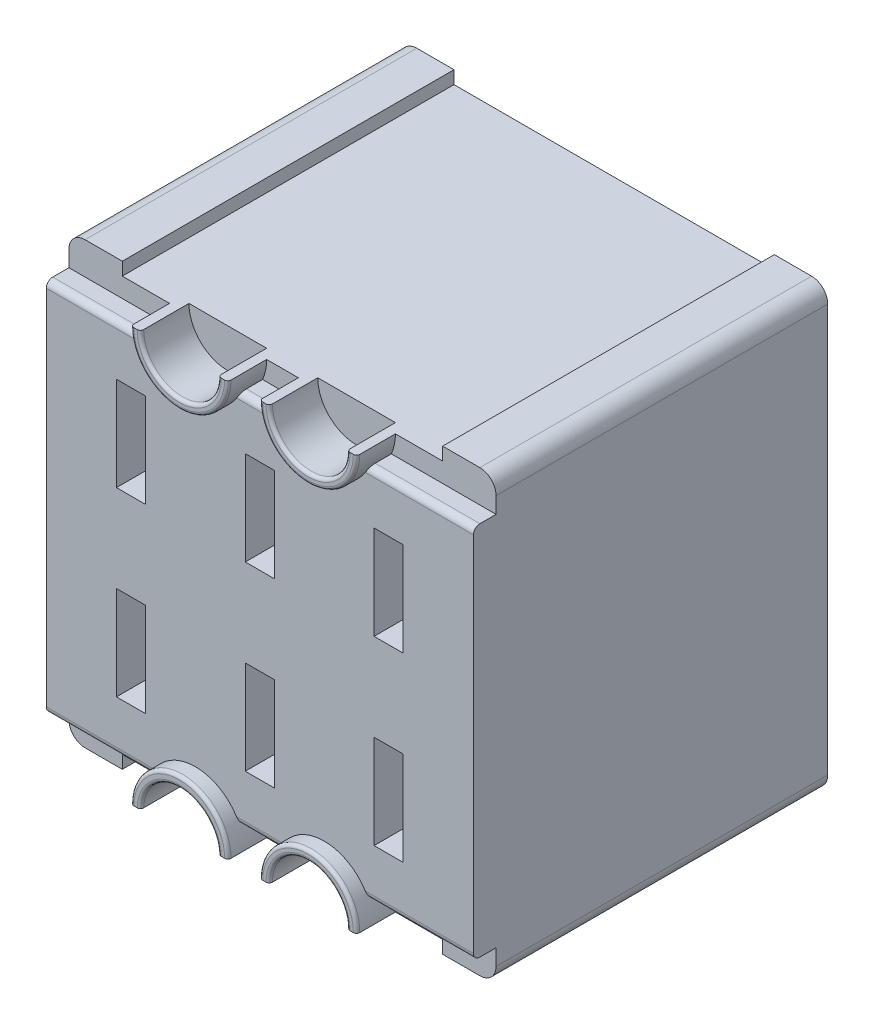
ISO-10303-21;
HEADER;
FILE_DESCRIPTION(('STEP AP214'),'2;1');
FILE_NAME('part.step','',(''),(''),'','','');
FILE_SCHEMA(('AUTOMOTIVE_DESIGN { 1 0 10303 214 1 1 1 1 }'));
ENDSEC;
DATA;
#1=APPLICATION_CONTEXT('core data for automotive mechanical design processes');
#2=APPLICATION_PROTOCOL_DEFINITION('international standard','automotive_design',2000,#1);
#3=PRODUCT_CONTEXT('',#1,'mechanical');
#4=PRODUCT('Part','Part','',(#3));
#5=PRODUCT_RELATED_PRODUCT_CATEGORY('part','',(#4));
#6=PRODUCT_DEFINITION_FORMATION('','',#4);
#7=PRODUCT_DEFINITION_CONTEXT('part definition',#1,'design');
#8=PRODUCT_DEFINITION('design','',#6,#7);
#9=PRODUCT_DEFINITION_SHAPE('','',#8);
#10=(LENGTH_UNIT() NAMED_UNIT(*) SI_UNIT(.MILLI.,.METRE.));
#11=(NAMED_UNIT(*) PLANE_ANGLE_UNIT() SI_UNIT($,.RADIAN.));
#12=(NAMED_UNIT(*) SI_UNIT($,.STERADIAN.) SOLID_ANGLE_UNIT());
#13=UNCERTAINTY_MEASURE_WITH_UNIT(LENGTH_MEASURE(1.E-05),#10,'distance_accuracy_value','');
#14=(GEOMETRIC_REPRESENTATION_CONTEXT(3) GLOBAL_UNCERTAINTY_ASSIGNED_CONTEXT((#13)) GLOBAL_UNIT_ASSIGNED_CONTEXT((#10,
#11,#12)) REPRESENTATION_CONTEXT('',''));
#15=CARTESIAN_POINT('',(0.,0.,0.));
#16=DIRECTION('',(0.,0.,1.));
#17=DIRECTION('',(1.,0.,0.));
#18=AXIS2_PLACEMENT_3D('',#15,#16,#17);
#19=CARTESIAN_POINT('',(2.17,5.45,-11.45));
#20=DIRECTION('',(-1.,0.,0.));
#21=DIRECTION('',(0.,-1.,0.));
#22=AXIS2_PLACEMENT_3D('',#19,#20,#21);
#23=PLANE('',#22);
#24=DIRECTION('',(0.,-1.,0.));
#25=VECTOR('',#24,1.);
#26=CARTESIAN_POINT('',(2.17,5.45,-10.95));
#27=LINE('',#26,#25);
#28=CARTESIAN_POINT('',(2.17,5.45,-10.95));
#29=VERTEX_POINT('',#28);
#30=CARTESIAN_POINT('',(2.17,2.55,-10.95));
#31=VERTEX_POINT('',#30);
#32=EDGE_CURVE('E57',#29,#31,#27,.T.);
#33=ORIENTED_EDGE('',*,*,#32,.F.);
#34=DIRECTION('',(0.,0.,1.));
#35=VECTOR('',#34,1.);
#36=CARTESIAN_POINT('',(2.17,5.45,-11.45));
#37=LINE('',#36,#35);
#38=CARTESIAN_POINT('',(2.17,5.45,-0.5));
#39=VERTEX_POINT('',#38);
#40=EDGE_CURVE('E763',#29,#39,#37,.T.);
#41=ORIENTED_EDGE('',*,*,#40,.T.);
#42=DIRECTION('',(0.,-1.,0.));
#43=VECTOR('',#42,1.);
#44=CARTESIAN_POINT('',(2.17,5.45,-0.5));
#45=LINE('',#44,#43);
#46=CARTESIAN_POINT('',(2.17,2.55,-0.5));
#47=VERTEX_POINT('',#46);
#48=EDGE_CURVE('E745',#39,#47,#45,.T.);
#49=ORIENTED_EDGE('',*,*,#48,.T.);
#50=DIRECTION('',(0.,0.,1.));
#51=VECTOR('',#50,1.);
#52=CARTESIAN_POINT('',(2.17,2.55,-11.45));
#53=LINE('',#52,#51);
#54=EDGE_CURVE('E762',#31,#47,#53,.T.);
#55=ORIENTED_EDGE('',*,*,#54,.F.);
#56=EDGE_LOOP('',(#33,#41,#49,#55));
#57=FACE_BOUND('',#56,.T.);
#58=ADVANCED_FACE('F33',(#57),#23,.F.);
#59=CARTESIAN_POINT('',(2.17,5.45,-11.45));
#60=DIRECTION('',(0.,1.,0.));
#61=DIRECTION('',(0.,0.,1.));
#62=AXIS2_PLACEMENT_3D('',#59,#60,#61);
#63=PLANE('',#62);
#64=DIRECTION('',(-1.,0.,0.));
#65=VECTOR('',#64,1.);
#66=CARTESIAN_POINT('',(2.17,5.45,-10.95));
#67=LINE('',#66,#65);
#68=CARTESIAN_POINT('',(3.07,5.45,-10.95));
#69=VERTEX_POINT('',#68);
#70=EDGE_CURVE('E647',#69,#29,#67,.T.);
#71=ORIENTED_EDGE('',*,*,#70,.F.);
#72=DIRECTION('',(0.,0.,1.));
#73=VECTOR('',#72,1.);
#74=CARTESIAN_POINT('',(3.07,5.45,-11.45));
#75=LINE('',#74,#73);
#76=CARTESIAN_POINT('',(3.07,5.45,-0.5));
#77=VERTEX_POINT('',#76);
#78=EDGE_CURVE('E766',#69,#77,#75,.T.);
#79=ORIENTED_EDGE('',*,*,#78,.T.);
#80=DIRECTION('',(-1.,0.,0.));
#81=VECTOR('',#80,1.);
#82=CARTESIAN_POINT('',(2.17,5.45,-0.5));
#83=LINE('',#82,#81);
#84=EDGE_CURVE('E759',#77,#39,#83,.T.);
#85=ORIENTED_EDGE('',*,*,#84,.T.);
#86=ORIENTED_EDGE('',*,*,#40,.F.);
#87=EDGE_LOOP('',(#71,#79,#85,#86));
#88=FACE_BOUND('',#87,.T.);
#89=ADVANCED_FACE('F1189',(#88),#63,.F.);
#90=CARTESIAN_POINT('',(3.07,5.45,-11.45));
#91=DIRECTION('',(1.,0.,0.));
#92=DIRECTION('',(0.,1.,0.));
#93=AXIS2_PLACEMENT_3D('',#90,#91,#92);
#94=PLANE('',#93);
#95=DIRECTION('',(0.,1.,0.));
#96=VECTOR('',#95,1.);
#97=CARTESIAN_POINT('',(3.07,5.45,-10.95));
#98=LINE('',#97,#96);
#99=CARTESIAN_POINT('',(3.07,2.55,-10.95));
#100=VERTEX_POINT('',#99);
#101=EDGE_CURVE('E645',#100,#69,#98,.T.);
#102=ORIENTED_EDGE('',*,*,#101,.F.);
#103=DIRECTION('',(0.,0.,1.));
#104=VECTOR('',#103,1.);
#105=CARTESIAN_POINT('',(3.07,2.55,-11.45));
#106=LINE('',#105,#104);
#107=CARTESIAN_POINT('',(3.07,2.55,-0.5));
#108=VERTEX_POINT('',#107);
#109=EDGE_CURVE('E768',#100,#108,#106,.T.);
#110=ORIENTED_EDGE('',*,*,#109,.T.);
#111=DIRECTION('',(0.,1.,0.));
#112=VECTOR('',#111,1.);
#113=CARTESIAN_POINT('',(3.07,5.45,-0.5));
#114=LINE('',#113,#112);
#115=EDGE_CURVE('E756',#108,#77,#114,.T.);
#116=ORIENTED_EDGE('',*,*,#115,.T.);
#117=ORIENTED_EDGE('',*,*,#78,.F.);
#118=EDGE_LOOP('',(#102,#110,#116,#117));
#119=FACE_BOUND('',#118,.T.);
#120=ADVANCED_FACE('F1195',(#119),#94,.F.);
#121=CARTESIAN_POINT('',(2.17,2.55,-11.45));
#122=DIRECTION('',(0.,-1.,0.));
#123=DIRECTION('',(0.,0.,-1.));
#124=AXIS2_PLACEMENT_3D('',#121,#122,#123);
#125=PLANE('',#124);
#126=DIRECTION('',(1.,0.,0.));
#127=VECTOR('',#126,1.);
#128=CARTESIAN_POINT('',(2.17,2.55,-10.95));
#129=LINE('',#128,#127);
#130=EDGE_CURVE('E643',#31,#100,#129,.T.);
#131=ORIENTED_EDGE('',*,*,#130,.F.);
#132=ORIENTED_EDGE('',*,*,#54,.T.);
#133=DIRECTION('',(1.,0.,0.));
#134=VECTOR('',#133,1.);
#135=CARTESIAN_POINT('',(2.17,2.55,-0.5));
#136=LINE('',#135,#134);
#137=EDGE_CURVE('E753',#47,#108,#136,.T.);
#138=ORIENTED_EDGE('',*,*,#137,.T.);
#139=ORIENTED_EDGE('',*,*,#109,.F.);
#140=EDGE_LOOP('',(#131,#132,#138,#139));
#141=FACE_BOUND('',#140,.T.);
#142=ADVANCED_FACE('F1200',(#141),#125,.F.);
#143=CARTESIAN_POINT('',(6.15,5.45,-11.45));
#144=DIRECTION('',(-1.,0.,0.));
#145=DIRECTION('',(0.,0.,1.));
#146=AXIS2_PLACEMENT_3D('',#143,#144,#145);
#147=PLANE('',#146);
#148=DIRECTION('',(0.,-1.,0.));
#149=VECTOR('',#148,1.);
#150=CARTESIAN_POINT('',(6.15,5.45,-10.95));
#151=LINE('',#150,#149);
#152=CARTESIAN_POINT('',(6.15,5.45,-10.95));
#153=VERTEX_POINT('',#152);
#154=CARTESIAN_POINT('',(6.15,2.55,-10.95));
#155=VERTEX_POINT('',#154);
#156=EDGE_CURVE('E641',#153,#155,#151,.T.);
#157=ORIENTED_EDGE('',*,*,#156,.F.);
#158=DIRECTION('',(0.,0.,1.));
#159=VECTOR('',#158,1.);
#160=CARTESIAN_POINT('',(6.15,5.45,-11.45));
#161=LINE('',#160,#159);
#162=CARTESIAN_POINT('',(6.15,5.45,-0.5));
#163=VERTEX_POINT('',#162);
#164=EDGE_CURVE('E743',#153,#163,#161,.T.);
#165=ORIENTED_EDGE('',*,*,#164,.T.);
#166=DIRECTION('',(0.,-1.,0.));
#167=VECTOR('',#166,1.);
#168=CARTESIAN_POINT('',(6.15,5.45,-0.5));
#169=LINE('',#168,#167);
#170=CARTESIAN_POINT('',(6.15,2.55,-0.5));
#171=VERTEX_POINT('',#170);
#172=EDGE_CURVE('E725',#163,#171,#169,.T.);
#173=ORIENTED_EDGE('',*,*,#172,.T.);
#174=DIRECTION('',(0.,0.,1.));
#175=VECTOR('',#174,1.);
#176=CARTESIAN_POINT('',(6.15,2.55,-11.45));
#177=LINE('',#176,#175);
#178=EDGE_CURVE('E742',#155,#171,#177,.T.);
#179=ORIENTED_EDGE('',*,*,#178,.F.);
#180=EDGE_LOOP('',(#157,#165,#173,#179));
#181=FACE_BOUND('',#180,.T.);
#182=ADVANCED_FACE('F1720',(#181),#147,.F.);
#183=CARTESIAN_POINT('',(6.15,5.45,-11.45));
#184=DIRECTION('',(0.,1.,0.));
#185=DIRECTION('',(0.,0.,1.));
#186=AXIS2_PLACEMENT_3D('',#183,#184,#185);
#187=PLANE('',#186);
#188=DIRECTION('',(-1.,0.,0.));
#189=VECTOR('',#188,1.);
#190=CARTESIAN_POINT('',(6.15,5.45,-10.95));
#191=LINE('',#190,#189);
#192=CARTESIAN_POINT('',(7.05,5.45,-10.95));
#193=VERTEX_POINT('',#192);
#194=EDGE_CURVE('E639',#193,#153,#191,.T.);
#195=ORIENTED_EDGE('',*,*,#194,.F.);
#196=DIRECTION('',(0.,0.,1.));
#197=VECTOR('',#196,1.);
#198=CARTESIAN_POINT('',(7.05,5.45,-11.45));
#199=LINE('',#198,#197);
#200=CARTESIAN_POINT('',(7.05,5.45,-0.5));
#201=VERTEX_POINT('',#200);
#202=EDGE_CURVE('E746',#193,#201,#199,.T.);
#203=ORIENTED_EDGE('',*,*,#202,.T.);
#204=DIRECTION('',(-1.,0.,0.));
#205=VECTOR('',#204,1.);
#206=CARTESIAN_POINT('',(6.15,5.45,-0.5));
#207=LINE('',#206,#205);
#208=EDGE_CURVE('E739',#201,#163,#207,.T.);
#209=ORIENTED_EDGE('',*,*,#208,.T.);
#210=ORIENTED_EDGE('',*,*,#164,.F.);
#211=EDGE_LOOP('',(#195,#203,#209,#210));
#212=FACE_BOUND('',#211,.T.);
#213=ADVANCED_FACE('F1716',(#212),#187,.F.);
#214=CARTESIAN_POINT('',(7.05,5.45,-11.45));
#215=DIRECTION('',(1.,0.,0.));
#216=DIRECTION('',(0.,0.,-1.));
#217=AXIS2_PLACEMENT_3D('',#214,#215,#216);
#218=PLANE('',#217);
#219=DIRECTION('',(0.,1.,0.));
#220=VECTOR('',#219,1.);
#221=CARTESIAN_POINT('',(7.05,5.45,-10.95));
#222=LINE('',#221,#220);
#223=CARTESIAN_POINT('',(7.05,2.55,-10.95));
#224=VERTEX_POINT('',#223);
#225=EDGE_CURVE('E637',#224,#193,#222,.T.);
#226=ORIENTED_EDGE('',*,*,#225,.F.);
#227=DIRECTION('',(0.,0.,1.));
#228=VECTOR('',#227,1.);
#229=CARTESIAN_POINT('',(7.05,2.55,-11.45));
#230=LINE('',#229,#228);
#231=CARTESIAN_POINT('',(7.05,2.55,-0.5));
#232=VERTEX_POINT('',#231);
#233=EDGE_CURVE('E748',#224,#232,#230,.T.);
#234=ORIENTED_EDGE('',*,*,#233,.T.);
#235=DIRECTION('',(0.,1.,0.));
#236=VECTOR('',#235,1.);
#237=CARTESIAN_POINT('',(7.05,5.45,-0.5));
#238=LINE('',#237,#236);
#239=EDGE_CURVE('E736',#232,#201,#238,.T.);
#240=ORIENTED_EDGE('',*,*,#239,.T.);
#241=ORIENTED_EDGE('',*,*,#202,.F.);
#242=EDGE_LOOP('',(#226,#234,#240,#241));
#243=FACE_BOUND('',#242,.T.);
#244=ADVANCED_FACE('F1719',(#243),#218,.F.);
#245=CARTESIAN_POINT('',(6.15,2.55,-11.45));
#246=DIRECTION('',(0.,-1.,0.));
#247=DIRECTION('',(0.,0.,-1.));
#248=AXIS2_PLACEMENT_3D('',#245,#246,#247);
#249=PLANE('',#248);
#250=DIRECTION('',(1.,0.,0.));
#251=VECTOR('',#250,1.);
#252=CARTESIAN_POINT('',(6.15,2.55,-10.95));
#253=LINE('',#252,#251);
#254=EDGE_CURVE('E635',#155,#224,#253,.T.);
#255=ORIENTED_EDGE('',*,*,#254,.F.);
#256=ORIENTED_EDGE('',*,*,#178,.T.);
#257=DIRECTION('',(1.,0.,0.));
#258=VECTOR('',#257,1.);
#259=CARTESIAN_POINT('',(6.15,2.55,-0.5));
#260=LINE('',#259,#258);
#261=EDGE_CURVE('E733',#171,#232,#260,.T.);
#262=ORIENTED_EDGE('',*,*,#261,.T.);
#263=ORIENTED_EDGE('',*,*,#233,.F.);
#264=EDGE_LOOP('',(#255,#256,#262,#263));
#265=FACE_BOUND('',#264,.T.);
#266=ADVANCED_FACE('F1714',(#265),#249,.F.);
#267=CARTESIAN_POINT('',(10.13,5.45,-11.45));
#268=DIRECTION('',(-1.,0.,0.));
#269=DIRECTION('',(0.,0.,1.));
#270=AXIS2_PLACEMENT_3D('',#267,#268,#269);
#271=PLANE('',#270);
#272=DIRECTION('',(0.,-1.,0.));
#273=VECTOR('',#272,1.);
#274=CARTESIAN_POINT('',(10.13,5.45,-10.95));
#275=LINE('',#274,#273);
#276=CARTESIAN_POINT('',(10.13,5.45,-10.95));
#277=VERTEX_POINT('',#276);
#278=CARTESIAN_POINT('',(10.13,2.55,-10.95));
#279=VERTEX_POINT('',#278);
#280=EDGE_CURVE('E633',#277,#279,#275,.T.);
#281=ORIENTED_EDGE('',*,*,#280,.F.);
#282=DIRECTION('',(0.,0.,1.));
#283=VECTOR('',#282,1.);
#284=CARTESIAN_POINT('',(10.13,5.45,-11.45));
#285=LINE('',#284,#283);
#286=CARTESIAN_POINT('',(10.13,5.45,-0.5));
#287=VERTEX_POINT('',#286);
#288=EDGE_CURVE('E723',#277,#287,#285,.T.);
#289=ORIENTED_EDGE('',*,*,#288,.T.);
#290=DIRECTION('',(0.,-1.,0.));
#291=VECTOR('',#290,1.);
#292=CARTESIAN_POINT('',(10.13,5.45,-0.5));
#293=LINE('',#292,#291);
#294=CARTESIAN_POINT('',(10.13,2.55,-0.5));
#295=VERTEX_POINT('',#294);
#296=EDGE_CURVE('E705',#287,#295,#293,.T.);
#297=ORIENTED_EDGE('',*,*,#296,.T.);
#298=DIRECTION('',(0.,0.,1.));
#299=VECTOR('',#298,1.);
#300=CARTESIAN_POINT('',(10.13,2.55,-11.45));
#301=LINE('',#300,#299);
#302=EDGE_CURVE('E722',#279,#295,#301,.T.);
#303=ORIENTED_EDGE('',*,*,#302,.F.);
#304=EDGE_LOOP('',(#281,#289,#297,#303));
#305=FACE_BOUND('',#304,.T.);
#306=ADVANCED_FACE('F1704',(#305),#271,.F.);
#307=CARTESIAN_POINT('',(10.13,5.45,-11.45));
#308=DIRECTION('',(0.,1.,0.));
#309=DIRECTION('',(0.,0.,1.));
#310=AXIS2_PLACEMENT_3D('',#307,#308,#309);
#311=PLANE('',#310);
#312=DIRECTION('',(-1.,0.,0.));
#313=VECTOR('',#312,1.);
#314=CARTESIAN_POINT('',(10.13,5.45,-10.95));
#315=LINE('',#314,#313);
#316=CARTESIAN_POINT('',(11.03,5.45,-10.95));
#317=VERTEX_POINT('',#316);
#318=EDGE_CURVE('E631',#317,#277,#315,.T.);
#319=ORIENTED_EDGE('',*,*,#318,.F.);
#320=DIRECTION('',(0.,0.,1.));
#321=VECTOR('',#320,1.);
#322=CARTESIAN_POINT('',(11.03,5.45,-11.45));
#323=LINE('',#322,#321);
#324=CARTESIAN_POINT('',(11.03,5.45,-0.5));
#325=VERTEX_POINT('',#324);
#326=EDGE_CURVE('E726',#317,#325,#323,.T.);
#327=ORIENTED_EDGE('',*,*,#326,.T.);
#328=DIRECTION('',(-1.,0.,0.));
#329=VECTOR('',#328,1.);
#330=CARTESIAN_POINT('',(10.13,5.45,-0.5));
#331=LINE('',#330,#329);
#332=EDGE_CURVE('E719',#325,#287,#331,.T.);
#333=ORIENTED_EDGE('',*,*,#332,.T.);
#334=ORIENTED_EDGE('',*,*,#288,.F.);
#335=EDGE_LOOP('',(#319,#327,#333,#334));
#336=FACE_BOUND('',#335,.T.);
#337=ADVANCED_FACE('F1700',(#336),#311,.F.);
#338=CARTESIAN_POINT('',(11.03,5.45,-11.45));
#339=DIRECTION('',(1.,0.,0.));
#340=DIRECTION('',(0.,0.,-1.));
#341=AXIS2_PLACEMENT_3D('',#338,#339,#340);
#342=PLANE('',#341);
#343=DIRECTION('',(0.,1.,0.));
#344=VECTOR('',#343,1.);
#345=CARTESIAN_POINT('',(11.03,5.45,-10.95));
#346=LINE('',#345,#344);
#347=CARTESIAN_POINT('',(11.03,2.55,-10.95));
#348=VERTEX_POINT('',#347);
#349=EDGE_CURVE('E629',#348,#317,#346,.T.);
#350=ORIENTED_EDGE('',*,*,#349,.F.);
#351=DIRECTION('',(0.,0.,1.));
#352=VECTOR('',#351,1.);
#353=CARTESIAN_POINT('',(11.03,2.55,-11.45));
#354=LINE('',#353,#352);
#355=CARTESIAN_POINT('',(11.03,2.55,-0.5));
#356=VERTEX_POINT('',#355);
#357=EDGE_CURVE('E728',#348,#356,#354,.T.);
#358=ORIENTED_EDGE('',*,*,#357,.T.);
#359=DIRECTION('',(0.,1.,0.));
#360=VECTOR('',#359,1.);
#361=CARTESIAN_POINT('',(11.03,5.45,-0.5));
#362=LINE('',#361,#360);
#363=EDGE_CURVE('E716',#356,#325,#362,.T.);
#364=ORIENTED_EDGE('',*,*,#363,.T.);
#365=ORIENTED_EDGE('',*,*,#326,.F.);
#366=EDGE_LOOP('',(#350,#358,#364,#365));
#367=FACE_BOUND('',#366,.T.);
#368=ADVANCED_FACE('F1703',(#367),#342,.F.);
#369=CARTESIAN_POINT('',(10.13,2.55,-11.45));
#370=DIRECTION('',(0.,-1.,0.));
#371=DIRECTION('',(0.,0.,-1.));
#372=AXIS2_PLACEMENT_3D('',#369,#370,#371);
#373=PLANE('',#372);
#374=DIRECTION('',(1.,0.,0.));
#375=VECTOR('',#374,1.);
#376=CARTESIAN_POINT('',(10.13,2.55,-10.95));
#377=LINE('',#376,#375);
#378=EDGE_CURVE('E627',#279,#348,#377,.T.);
#379=ORIENTED_EDGE('',*,*,#378,.F.);
#380=ORIENTED_EDGE('',*,*,#302,.T.);
#381=DIRECTION('',(1.,0.,0.));
#382=VECTOR('',#381,1.);
#383=CARTESIAN_POINT('',(10.13,2.55,-0.5));
#384=LINE('',#383,#382);
#385=EDGE_CURVE('E713',#295,#356,#384,.T.);
#386=ORIENTED_EDGE('',*,*,#385,.T.);
#387=ORIENTED_EDGE('',*,*,#357,.F.);
#388=EDGE_LOOP('',(#379,#380,#386,#387));
#389=FACE_BOUND('',#388,.T.);
#390=ADVANCED_FACE('F1698',(#389),#373,.F.);
#391=CARTESIAN_POINT('',(10.13,8.15,-11.45));
#392=DIRECTION('',(0.,-1.,0.));
#393=DIRECTION('',(0.,0.,-1.));
#394=AXIS2_PLACEMENT_3D('',#391,#392,#393);
#395=PLANE('',#394);
#396=DIRECTION('',(1.,0.,0.));
#397=VECTOR('',#396,1.);
#398=CARTESIAN_POINT('',(10.13,8.15,-10.95));
#399=LINE('',#398,#397);
#400=CARTESIAN_POINT('',(10.13,8.15,-10.95));
#401=VERTEX_POINT('',#400);
#402=CARTESIAN_POINT('',(11.03,8.15,-10.95));
#403=VERTEX_POINT('',#402);
#404=EDGE_CURVE('E625',#401,#403,#399,.T.);
#405=ORIENTED_EDGE('',*,*,#404,.F.);
#406=DIRECTION('',(0.,0.,1.));
#407=VECTOR('',#406,1.);
#408=CARTESIAN_POINT('',(10.13,8.15,-11.45));
#409=LINE('',#408,#407);
#410=CARTESIAN_POINT('',(10.13,8.15,-0.5));
#411=VERTEX_POINT('',#410);
#412=EDGE_CURVE('E703',#401,#411,#409,.T.);
#413=ORIENTED_EDGE('',*,*,#412,.T.);
#414=DIRECTION('',(1.,0.,0.));
#415=VECTOR('',#414,1.);
#416=CARTESIAN_POINT('',(10.13,8.15,-0.5));
#417=LINE('',#416,#415);
#418=CARTESIAN_POINT('',(11.03,8.15,-0.5));
#419=VERTEX_POINT('',#418);
#420=EDGE_CURVE('E685',#411,#419,#417,.T.);
#421=ORIENTED_EDGE('',*,*,#420,.T.);
#422=DIRECTION('',(0.,0.,1.));
#423=VECTOR('',#422,1.);
#424=CARTESIAN_POINT('',(11.03,8.15,-11.45));
#425=LINE('',#424,#423);
#426=EDGE_CURVE('E702',#403,#419,#425,.T.);
#427=ORIENTED_EDGE('',*,*,#426,.F.);
#428=EDGE_LOOP('',(#405,#413,#421,#427));
#429=FACE_BOUND('',#428,.T.);
#430=ADVANCED_FACE('F1688',(#429),#395,.F.);
#431=CARTESIAN_POINT('',(10.13,8.15,-11.45));
#432=DIRECTION('',(-1.,0.,0.));
#433=DIRECTION('',(0.,0.,1.));
#434=AXIS2_PLACEMENT_3D('',#431,#432,#433);
#435=PLANE('',#434);
#436=DIRECTION('',(0.,-1.,0.));
#437=VECTOR('',#436,1.);
#438=CARTESIAN_POINT('',(10.13,8.15,-10.95));
#439=LINE('',#438,#437);
#440=CARTESIAN_POINT('',(10.13,11.05,-10.95));
#441=VERTEX_POINT('',#440);
#442=EDGE_CURVE('E623',#441,#401,#439,.T.);
#443=ORIENTED_EDGE('',*,*,#442,.F.);
#444=DIRECTION('',(0.,0.,1.));
#445=VECTOR('',#444,1.);
#446=CARTESIAN_POINT('',(10.13,11.05,-11.45));
#447=LINE('',#446,#445);
#448=CARTESIAN_POINT('',(10.13,11.05,-0.5));
#449=VERTEX_POINT('',#448);
#450=EDGE_CURVE('E706',#441,#449,#447,.T.);
#451=ORIENTED_EDGE('',*,*,#450,.T.);
#452=DIRECTION('',(0.,-1.,0.));
#453=VECTOR('',#452,1.);
#454=CARTESIAN_POINT('',(10.13,8.15,-0.5));
#455=LINE('',#454,#453);
#456=EDGE_CURVE('E699',#449,#411,#455,.T.);
#457=ORIENTED_EDGE('',*,*,#456,.T.);
#458=ORIENTED_EDGE('',*,*,#412,.F.);
#459=EDGE_LOOP('',(#443,#451,#457,#458));
#460=FACE_BOUND('',#459,.T.);
#461=ADVANCED_FACE('F1684',(#460),#435,.F.);
#462=CARTESIAN_POINT('',(10.13,11.05,-11.45));
#463=DIRECTION('',(0.,1.,0.));
#464=DIRECTION('',(0.,0.,1.));
#465=AXIS2_PLACEMENT_3D('',#462,#463,#464);
#466=PLANE('',#465);
#467=DIRECTION('',(-1.,0.,0.));
#468=VECTOR('',#467,1.);
#469=CARTESIAN_POINT('',(10.13,11.05,-10.95));
#470=LINE('',#469,#468);
#471=CARTESIAN_POINT('',(11.03,11.05,-10.95));
#472=VERTEX_POINT('',#471);
#473=EDGE_CURVE('E621',#472,#441,#470,.T.);
#474=ORIENTED_EDGE('',*,*,#473,.F.);
#475=DIRECTION('',(0.,0.,1.));
#476=VECTOR('',#475,1.);
#477=CARTESIAN_POINT('',(11.03,11.05,-11.45));
#478=LINE('',#477,#476);
#479=CARTESIAN_POINT('',(11.03,11.05,-0.5));
#480=VERTEX_POINT('',#479);
#481=EDGE_CURVE('E708',#472,#480,#478,.T.);
#482=ORIENTED_EDGE('',*,*,#481,.T.);
#483=DIRECTION('',(-1.,0.,0.));
#484=VECTOR('',#483,1.);
#485=CARTESIAN_POINT('',(10.13,11.05,-0.5));
#486=LINE('',#485,#484);
#487=EDGE_CURVE('E696',#480,#449,#486,.T.);
#488=ORIENTED_EDGE('',*,*,#487,.T.);
#489=ORIENTED_EDGE('',*,*,#450,.F.);
#490=EDGE_LOOP('',(#474,#482,#488,#489));
#491=FACE_BOUND('',#490,.T.);
#492=ADVANCED_FACE('F1687',(#491),#466,.F.);
#493=CARTESIAN_POINT('',(11.03,8.15,-11.45));
#494=DIRECTION('',(1.,0.,0.));
#495=DIRECTION('',(0.,0.,-1.));
#496=AXIS2_PLACEMENT_3D('',#493,#494,#495);
#497=PLANE('',#496);
#498=DIRECTION('',(0.,1.,0.));
#499=VECTOR('',#498,1.);
#500=CARTESIAN_POINT('',(11.03,8.15,-10.95));
#501=LINE('',#500,#499);
#502=EDGE_CURVE('E619',#403,#472,#501,.T.);
#503=ORIENTED_EDGE('',*,*,#502,.F.);
#504=ORIENTED_EDGE('',*,*,#426,.T.);
#505=DIRECTION('',(0.,1.,0.));
#506=VECTOR('',#505,1.);
#507=CARTESIAN_POINT('',(11.03,8.15,-0.5));
#508=LINE('',#507,#506);
#509=EDGE_CURVE('E693',#419,#480,#508,.T.);
#510=ORIENTED_EDGE('',*,*,#509,.T.);
#511=ORIENTED_EDGE('',*,*,#481,.F.);
#512=EDGE_LOOP('',(#503,#504,#510,#511));
#513=FACE_BOUND('',#512,.T.);
#514=ADVANCED_FACE('F1682',(#513),#497,.F.);
#515=CARTESIAN_POINT('',(6.15,8.15,-11.45));
#516=DIRECTION('',(0.,-1.,0.));
#517=DIRECTION('',(0.,0.,-1.));
#518=AXIS2_PLACEMENT_3D('',#515,#516,#517);
#519=PLANE('',#518);
#520=DIRECTION('',(1.,0.,0.));
#521=VECTOR('',#520,1.);
#522=CARTESIAN_POINT('',(6.15,8.15,-10.95));
#523=LINE('',#522,#521);
#524=CARTESIAN_POINT('',(6.15,8.15,-10.95));
#525=VERTEX_POINT('',#524);
#526=CARTESIAN_POINT('',(7.05,8.15,-10.95));
#527=VERTEX_POINT('',#526);
#528=EDGE_CURVE('E617',#525,#527,#523,.T.);
#529=ORIENTED_EDGE('',*,*,#528,.F.);
#530=DIRECTION('',(0.,0.,1.));
#531=VECTOR('',#530,1.);
#532=CARTESIAN_POINT('',(6.15,8.15,-11.45));
#533=LINE('',#532,#531);
#534=CARTESIAN_POINT('',(6.15,8.15,-0.5));
#535=VERTEX_POINT('',#534);
#536=EDGE_CURVE('E683',#525,#535,#533,.T.);
#537=ORIENTED_EDGE('',*,*,#536,.T.);
#538=DIRECTION('',(1.,0.,0.));
#539=VECTOR('',#538,1.);
#540=CARTESIAN_POINT('',(6.15,8.15,-0.5));
#541=LINE('',#540,#539);
#542=CARTESIAN_POINT('',(7.05,8.15,-0.5));
#543=VERTEX_POINT('',#542);
#544=EDGE_CURVE('E665',#535,#543,#541,.T.);
#545=ORIENTED_EDGE('',*,*,#544,.T.);
#546=DIRECTION('',(0.,0.,1.));
#547=VECTOR('',#546,1.);
#548=CARTESIAN_POINT('',(7.05,8.15,-11.45));
#549=LINE('',#548,#547);
#550=EDGE_CURVE('E682',#527,#543,#549,.T.);
#551=ORIENTED_EDGE('',*,*,#550,.F.);
#552=EDGE_LOOP('',(#529,#537,#545,#551));
#553=FACE_BOUND('',#552,.T.);
#554=ADVANCED_FACE('F1672',(#553),#519,.F.);
#555=CARTESIAN_POINT('',(6.15,8.15,-11.45));
#556=DIRECTION('',(-1.,0.,0.));
#557=DIRECTION('',(0.,0.,1.));
#558=AXIS2_PLACEMENT_3D('',#555,#556,#557);
#559=PLANE('',#558);
#560=DIRECTION('',(0.,-1.,0.));
#561=VECTOR('',#560,1.);
#562=CARTESIAN_POINT('',(6.15,8.15,-10.95));
#563=LINE('',#562,#561);
#564=CARTESIAN_POINT('',(6.15,11.05,-10.95));
#565=VERTEX_POINT('',#564);
#566=EDGE_CURVE('E615',#565,#525,#563,.T.);
#567=ORIENTED_EDGE('',*,*,#566,.F.);
#568=DIRECTION('',(0.,0.,1.));
#569=VECTOR('',#568,1.);
#570=CARTESIAN_POINT('',(6.15,11.05,-11.45));
#571=LINE('',#570,#569);
#572=CARTESIAN_POINT('',(6.15,11.05,-0.5));
#573=VERTEX_POINT('',#572);
#574=EDGE_CURVE('E686',#565,#573,#571,.T.);
#575=ORIENTED_EDGE('',*,*,#574,.T.);
#576=DIRECTION('',(0.,-1.,0.));
#577=VECTOR('',#576,1.);
#578=CARTESIAN_POINT('',(6.15,8.15,-0.5));
#579=LINE('',#578,#577);
#580=EDGE_CURVE('E679',#573,#535,#579,.T.);
#581=ORIENTED_EDGE('',*,*,#580,.T.);
#582=ORIENTED_EDGE('',*,*,#536,.F.);
#583=EDGE_LOOP('',(#567,#575,#581,#582));
#584=FACE_BOUND('',#583,.T.);
#585=ADVANCED_FACE('F1668',(#584),#559,.F.);
#586=CARTESIAN_POINT('',(6.15,11.05,-11.45));
#587=DIRECTION('',(0.,1.,0.));
#588=DIRECTION('',(0.,0.,1.));
#589=AXIS2_PLACEMENT_3D('',#586,#587,#588);
#590=PLANE('',#589);
#591=DIRECTION('',(-1.,0.,0.));
#592=VECTOR('',#591,1.);
#593=CARTESIAN_POINT('',(6.15,11.05,-10.95));
#594=LINE('',#593,#592);
#595=CARTESIAN_POINT('',(7.05,11.05,-10.95));
#596=VERTEX_POINT('',#595);
#597=EDGE_CURVE('E613',#596,#565,#594,.T.);
#598=ORIENTED_EDGE('',*,*,#597,.F.);
#599=DIRECTION('',(0.,0.,1.));
#600=VECTOR('',#599,1.);
#601=CARTESIAN_POINT('',(7.05,11.05,-11.45));
#602=LINE('',#601,#600);
#603=CARTESIAN_POINT('',(7.05,11.05,-0.5));
#604=VERTEX_POINT('',#603);
#605=EDGE_CURVE('E688',#596,#604,#602,.T.);
#606=ORIENTED_EDGE('',*,*,#605,.T.);
#607=DIRECTION('',(-1.,0.,0.));
#608=VECTOR('',#607,1.);
#609=CARTESIAN_POINT('',(6.15,11.05,-0.5));
#610=LINE('',#609,#608);
#611=EDGE_CURVE('E676',#604,#573,#610,.T.);
#612=ORIENTED_EDGE('',*,*,#611,.T.);
#613=ORIENTED_EDGE('',*,*,#574,.F.);
#614=EDGE_LOOP('',(#598,#606,#612,#613));
#615=FACE_BOUND('',#614,.T.);
#616=ADVANCED_FACE('F1671',(#615),#590,.F.);
#617=CARTESIAN_POINT('',(7.05,8.15,-11.45));
#618=DIRECTION('',(1.,0.,0.));
#619=DIRECTION('',(0.,0.,-1.));
#620=AXIS2_PLACEMENT_3D('',#617,#618,#619);
#621=PLANE('',#620);
#622=DIRECTION('',(0.,1.,0.));
#623=VECTOR('',#622,1.);
#624=CARTESIAN_POINT('',(7.05,8.15,-10.95));
#625=LINE('',#624,#623);
#626=EDGE_CURVE('E611',#527,#596,#625,.T.);
#627=ORIENTED_EDGE('',*,*,#626,.F.);
#628=ORIENTED_EDGE('',*,*,#550,.T.);
#629=DIRECTION('',(0.,1.,0.));
#630=VECTOR('',#629,1.);
#631=CARTESIAN_POINT('',(7.05,8.15,-0.5));
#632=LINE('',#631,#630);
#633=EDGE_CURVE('E673',#543,#604,#632,.T.);
#634=ORIENTED_EDGE('',*,*,#633,.T.);
#635=ORIENTED_EDGE('',*,*,#605,.F.);
#636=EDGE_LOOP('',(#627,#628,#634,#635));
#637=FACE_BOUND('',#636,.T.);
#638=ADVANCED_FACE('F1666',(#637),#621,.F.);
#639=CARTESIAN_POINT('',(2.17,8.15,-11.45));
#640=DIRECTION('',(0.,-1.,0.));
#641=DIRECTION('',(0.,0.,-1.));
#642=AXIS2_PLACEMENT_3D('',#639,#640,#641);
#643=PLANE('',#642);
#644=DIRECTION('',(1.,0.,0.));
#645=VECTOR('',#644,1.);
#646=CARTESIAN_POINT('',(2.17,8.15,-10.95));
#647=LINE('',#646,#645);
#648=CARTESIAN_POINT('',(2.17,8.15,-10.95));
#649=VERTEX_POINT('',#648);
#650=CARTESIAN_POINT('',(3.07,8.15,-10.95));
#651=VERTEX_POINT('',#650);
#652=EDGE_CURVE('E609',#649,#651,#647,.T.);
#653=ORIENTED_EDGE('',*,*,#652,.F.);
#654=DIRECTION('',(0.,0.,1.));
#655=VECTOR('',#654,1.);
#656=CARTESIAN_POINT('',(2.17,8.15,-11.45));
#657=LINE('',#656,#655);
#658=CARTESIAN_POINT('',(2.17,8.15,-0.5));
#659=VERTEX_POINT('',#658);
#660=EDGE_CURVE('E663',#649,#659,#657,.T.);
#661=ORIENTED_EDGE('',*,*,#660,.T.);
#662=DIRECTION('',(1.,0.,0.));
#663=VECTOR('',#662,1.);
#664=CARTESIAN_POINT('',(2.17,8.15,-0.5));
#665=LINE('',#664,#663);
#666=CARTESIAN_POINT('',(3.07,8.15,-0.5));
#667=VERTEX_POINT('',#666);
#668=EDGE_CURVE('E650',#659,#667,#665,.T.);
#669=ORIENTED_EDGE('',*,*,#668,.T.);
#670=DIRECTION('',(0.,0.,1.));
#671=VECTOR('',#670,1.);
#672=CARTESIAN_POINT('',(3.07,8.15,-11.45));
#673=LINE('',#672,#671);
#674=EDGE_CURVE('E662',#651,#667,#673,.T.);
#675=ORIENTED_EDGE('',*,*,#674,.F.);
#676=EDGE_LOOP('',(#653,#661,#669,#675));
#677=FACE_BOUND('',#676,.T.);
#678=ADVANCED_FACE('F1656',(#677),#643,.F.);
#679=CARTESIAN_POINT('',(2.17,8.15,-11.45));
#680=DIRECTION('',(-1.,0.,0.));
#681=DIRECTION('',(0.,-1.,0.));
#682=AXIS2_PLACEMENT_3D('',#679,#680,#681);
#683=PLANE('',#682);
#684=DIRECTION('',(0.,-1.,0.));
#685=VECTOR('',#684,1.);
#686=CARTESIAN_POINT('',(2.17,8.15,-10.95));
#687=LINE('',#686,#685);
#688=CARTESIAN_POINT('',(2.17,11.05,-10.95));
#689=VERTEX_POINT('',#688);
#690=EDGE_CURVE('E607',#689,#649,#687,.T.);
#691=ORIENTED_EDGE('',*,*,#690,.F.);
#692=DIRECTION('',(0.,0.,1.));
#693=VECTOR('',#692,1.);
#694=CARTESIAN_POINT('',(2.17,11.05,-11.45));
#695=LINE('',#694,#693);
#696=CARTESIAN_POINT('',(2.17,11.05,-0.5));
#697=VERTEX_POINT('',#696);
#698=EDGE_CURVE('E666',#689,#697,#695,.T.);
#699=ORIENTED_EDGE('',*,*,#698,.T.);
#700=DIRECTION('',(0.,-1.,0.));
#701=VECTOR('',#700,1.);
#702=CARTESIAN_POINT('',(2.17,8.15,-0.5));
#703=LINE('',#702,#701);
#704=EDGE_CURVE('E659',#697,#659,#703,.T.);
#705=ORIENTED_EDGE('',*,*,#704,.T.);
#706=ORIENTED_EDGE('',*,*,#660,.F.);
#707=EDGE_LOOP('',(#691,#699,#705,#706));
#708=FACE_BOUND('',#707,.T.);
#709=ADVANCED_FACE('F1652',(#708),#683,.F.);
#710=CARTESIAN_POINT('',(2.17,11.05,-11.45));
#711=DIRECTION('',(0.,1.,0.));
#712=DIRECTION('',(0.,0.,1.));
#713=AXIS2_PLACEMENT_3D('',#710,#711,#712);
#714=PLANE('',#713);
#715=DIRECTION('',(-1.,0.,0.));
#716=VECTOR('',#715,1.);
#717=CARTESIAN_POINT('',(2.17,11.05,-10.95));
#718=LINE('',#717,#716);
#719=CARTESIAN_POINT('',(3.07,11.05,-10.95));
#720=VERTEX_POINT('',#719);
#721=EDGE_CURVE('E602',#720,#689,#718,.T.);
#722=ORIENTED_EDGE('',*,*,#721,.F.);
#723=DIRECTION('',(0.,0.,1.));
#724=VECTOR('',#723,1.);
#725=CARTESIAN_POINT('',(3.07,11.05,-11.45));
#726=LINE('',#725,#724);
#727=CARTESIAN_POINT('',(3.07,11.05,-0.5));
#728=VERTEX_POINT('',#727);
#729=EDGE_CURVE('E668',#720,#728,#726,.T.);
#730=ORIENTED_EDGE('',*,*,#729,.T.);
#731=DIRECTION('',(-1.,0.,0.));
#732=VECTOR('',#731,1.);
#733=CARTESIAN_POINT('',(2.17,11.05,-0.5));
#734=LINE('',#733,#732);
#735=EDGE_CURVE('E656',#728,#697,#734,.T.);
#736=ORIENTED_EDGE('',*,*,#735,.T.);
#737=ORIENTED_EDGE('',*,*,#698,.F.);
#738=EDGE_LOOP('',(#722,#730,#736,#737));
#739=FACE_BOUND('',#738,.T.);
#740=ADVANCED_FACE('F1655',(#739),#714,.F.);
#741=CARTESIAN_POINT('',(3.07,8.15,-11.45));
#742=DIRECTION('',(1.,0.,0.));
#743=DIRECTION('',(0.,1.,0.));
#744=AXIS2_PLACEMENT_3D('',#741,#742,#743);
#745=PLANE('',#744);
#746=DIRECTION('',(0.,1.,0.));
#747=VECTOR('',#746,1.);
#748=CARTESIAN_POINT('',(3.07,8.15,-10.95));
#749=LINE('',#748,#747);
#750=EDGE_CURVE('E11',#651,#720,#749,.T.);
#751=ORIENTED_EDGE('',*,*,#750,.F.);
#752=ORIENTED_EDGE('',*,*,#674,.T.);
#753=DIRECTION('',(0.,1.,0.));
#754=VECTOR('',#753,1.);
#755=CARTESIAN_POINT('',(3.07,8.15,-0.5));
#756=LINE('',#755,#754);
#757=EDGE_CURVE('E653',#667,#728,#756,.T.);
#758=ORIENTED_EDGE('',*,*,#757,.T.);
#759=ORIENTED_EDGE('',*,*,#729,.F.);
#760=EDGE_LOOP('',(#751,#752,#758,#759));
#761=FACE_BOUND('',#760,.T.);
#762=ADVANCED_FACE('F1162',(#761),#745,.F.);
#763=CARTESIAN_POINT('',(0.,0.,-11.45));
#764=DIRECTION('',(0.,-1.,0.));
#765=DIRECTION('',(0.,0.,-1.));
#766=AXIS2_PLACEMENT_3D('',#763,#764,#765);
#767=PLANE('',#766);
#768=DIRECTION('',(1.,0.,0.));
#769=VECTOR('',#768,1.);
#770=CARTESIAN_POINT('',(0.,0.,-1.2));
#771=LINE('',#770,#769);
#772=CARTESIAN_POINT('',(0.5,0.,-1.2));
#773=VERTEX_POINT('',#772);
#774=CARTESIAN_POINT('',(1.65,0.,-1.2));
#775=VERTEX_POINT('',#774);
#776=EDGE_CURVE('E779',#773,#775,#771,.T.);
#777=ORIENTED_EDGE('',*,*,#776,.F.);
#778=DIRECTION('',(0.,0.,1.));
#779=VECTOR('',#778,1.);
#780=CARTESIAN_POINT('',(0.5,0.,-11.45));
#781=LINE('',#780,#779);
#782=CARTESIAN_POINT('',(0.5,0.,-11.45));
#783=VERTEX_POINT('',#782);
#784=EDGE_CURVE('E1069',#773,#783,#781,.F.);
#785=ORIENTED_EDGE('',*,*,#784,.T.);
#786=DIRECTION('',(1.,0.,0.));
#787=VECTOR('',#786,1.);
#788=CARTESIAN_POINT('',(0.,0.,-11.45));
#789=LINE('',#788,#787);
#790=CARTESIAN_POINT('',(1.65,0.,-11.45));
#791=VERTEX_POINT('',#790);
#792=EDGE_CURVE('E1032',#783,#791,#789,.T.);
#793=ORIENTED_EDGE('',*,*,#792,.T.);
#794=DIRECTION('',(0.,0.,1.));
#795=VECTOR('',#794,1.);
#796=CARTESIAN_POINT('',(1.65,0.,-11.45));
#797=LINE('',#796,#795);
#798=EDGE_CURVE('E987',#791,#775,#797,.T.);
#799=ORIENTED_EDGE('',*,*,#798,.T.);
#800=EDGE_LOOP('',(#777,#785,#793,#799));
#801=FACE_BOUND('',#800,.T.);
#802=ADVANCED_FACE('F1128',(#801),#767,.T.);
#803=CARTESIAN_POINT('',(1.65,0.,-11.45));
#804=DIRECTION('',(-1.,0.,0.));
#805=DIRECTION('',(0.,0.,1.));
#806=AXIS2_PLACEMENT_3D('',#803,#804,#805);
#807=PLANE('',#806);
#808=DIRECTION('',(0.,1.,0.));
#809=VECTOR('',#808,1.);
#810=CARTESIAN_POINT('',(1.65,0.,-1.2));
#811=LINE('',#810,#809);
#812=CARTESIAN_POINT('',(1.65,0.4,-1.2));
#813=VERTEX_POINT('',#812);
#814=EDGE_CURVE('E781',#775,#813,#811,.T.);
#815=ORIENTED_EDGE('',*,*,#814,.F.);
#816=ORIENTED_EDGE('',*,*,#798,.F.);
#817=DIRECTION('',(0.,-1.,0.));
#818=VECTOR('',#817,1.);
#819=CARTESIAN_POINT('',(1.65,0.,-11.45));
#820=LINE('',#819,#818);
#821=CARTESIAN_POINT('',(1.65,0.4,-11.45));
#822=VERTEX_POINT('',#821);
#823=EDGE_CURVE('E977',#822,#791,#820,.T.);
#824=ORIENTED_EDGE('',*,*,#823,.F.);
#825=DIRECTION('',(0.,0.,1.));
#826=VECTOR('',#825,1.);
#827=CARTESIAN_POINT('',(1.65,0.4,-11.45));
#828=LINE('',#827,#826);
#829=EDGE_CURVE('E991',#822,#813,#828,.T.);
#830=ORIENTED_EDGE('',*,*,#829,.T.);
#831=EDGE_LOOP('',(#815,#816,#824,#830));
#832=FACE_BOUND('',#831,.T.);
#833=ADVANCED_FACE('F1124',(#832),#807,.F.);
#834=CARTESIAN_POINT('',(4.61,13.2,-0.5));
#835=DIRECTION('',(0.,0.,1.));
#836=DIRECTION('',(1.,0.,0.));
#837=AXIS2_PLACEMENT_3D('',#834,#835,#836);
#838=PLANE('',#837);
#839=ORIENTED_EDGE('',*,*,#668,.F.);
#840=ORIENTED_EDGE('',*,*,#704,.F.);
#841=ORIENTED_EDGE('',*,*,#735,.F.);
#842=ORIENTED_EDGE('',*,*,#757,.F.);
#843=EDGE_LOOP('',(#839,#840,#841,#842));
#844=FACE_BOUND('',#843,.T.);
#845=ORIENTED_EDGE('',*,*,#544,.F.);
#846=ORIENTED_EDGE('',*,*,#580,.F.);
#847=ORIENTED_EDGE('',*,*,#611,.F.);
#848=ORIENTED_EDGE('',*,*,#633,.F.);
#849=EDGE_LOOP('',(#845,#846,#847,#848));
#850=FACE_BOUND('',#849,.T.);
#851=ORIENTED_EDGE('',*,*,#420,.F.);
#852=ORIENTED_EDGE('',*,*,#456,.F.);
#853=ORIENTED_EDGE('',*,*,#487,.F.);
#854=ORIENTED_EDGE('',*,*,#509,.F.);
#855=EDGE_LOOP('',(#851,#852,#853,#854));
#856=FACE_BOUND('',#855,.T.);
#857=ORIENTED_EDGE('',*,*,#296,.F.);
#858=ORIENTED_EDGE('',*,*,#332,.F.);
#859=ORIENTED_EDGE('',*,*,#363,.F.);
#860=ORIENTED_EDGE('',*,*,#385,.F.);
#861=EDGE_LOOP('',(#857,#858,#859,#860));
#862=FACE_BOUND('',#861,.T.);
#863=ORIENTED_EDGE('',*,*,#172,.F.);
#864=ORIENTED_EDGE('',*,*,#208,.F.);
#865=ORIENTED_EDGE('',*,*,#239,.F.);
#866=ORIENTED_EDGE('',*,*,#261,.F.);
#867=EDGE_LOOP('',(#863,#864,#865,#866));
#868=FACE_BOUND('',#867,.T.);
#869=ORIENTED_EDGE('',*,*,#48,.F.);
#870=ORIENTED_EDGE('',*,*,#84,.F.);
#871=ORIENTED_EDGE('',*,*,#115,.F.);
#872=ORIENTED_EDGE('',*,*,#137,.F.);
#873=EDGE_LOOP('',(#869,#870,#871,#872));
#874=FACE_BOUND('',#873,.T.);
#875=DIRECTION('',(0.,-1.,0.));
#876=VECTOR('',#875,1.);
#877=CARTESIAN_POINT('',(0.,13.6,-0.5));
#878=LINE('',#877,#876);
#879=CARTESIAN_POINT('',(0.,12.4,-0.5));
#880=VERTEX_POINT('',#879);
#881=CARTESIAN_POINT('',(0.,1.2,-0.5));
#882=VERTEX_POINT('',#881);
#883=EDGE_CURVE('E937',#880,#882,#878,.T.);
#884=ORIENTED_EDGE('',*,*,#883,.T.);
#885=DIRECTION('',(-1.,0.,0.));
#886=VECTOR('',#885,1.);
#887=CARTESIAN_POINT('',(3.23522729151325,1.2,-0.5));
#888=LINE('',#887,#886);
#889=CARTESIAN_POINT('',(3.34114224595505,1.2,-0.5));
#890=VERTEX_POINT('',#889);
#891=EDGE_CURVE('E1469',#882,#890,#888,.F.);
#892=ORIENTED_EDGE('',*,*,#891,.T.);
#893=CARTESIAN_POINT('',(4.61,0.4,-0.5));
#894=DIRECTION('',(0.,0.,-1.));
#895=DIRECTION('',(1.,0.,0.));
#896=AXIS2_PLACEMENT_3D('',#893,#894,#895);
#897=CIRCLE('',#896,1.5);
#898=CARTESIAN_POINT('',(5.87885775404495,1.2,-0.5));
#899=VERTEX_POINT('',#898);
#900=EDGE_CURVE('E940',#890,#899,#897,.T.);
#901=ORIENTED_EDGE('',*,*,#900,.T.);
#902=DIRECTION('',(1.,0.,0.));
#903=VECTOR('',#902,1.);
#904=CARTESIAN_POINT('',(4.61,1.2,-0.5));
#905=LINE('',#904,#903);
#906=CARTESIAN_POINT('',(7.32114224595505,1.2,-0.5));
#907=VERTEX_POINT('',#906);
#908=EDGE_CURVE('E1466',#899,#907,#905,.T.);
#909=ORIENTED_EDGE('',*,*,#908,.T.);
#910=CARTESIAN_POINT('',(8.59,0.4,-0.5));
#911=DIRECTION('',(0.,0.,-1.));
#912=DIRECTION('',(1.,0.,0.));
#913=AXIS2_PLACEMENT_3D('',#910,#911,#912);
#914=CIRCLE('',#913,1.5);
#915=CARTESIAN_POINT('',(9.85885775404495,1.2,-0.5));
#916=VERTEX_POINT('',#915);
#917=EDGE_CURVE('E943',#907,#916,#914,.T.);
#918=ORIENTED_EDGE('',*,*,#917,.T.);
#919=DIRECTION('',(1.,0.,0.));
#920=VECTOR('',#919,1.);
#921=CARTESIAN_POINT('',(4.61,1.2,-0.5));
#922=LINE('',#921,#920);
#923=CARTESIAN_POINT('',(13.2,1.2,-0.5));
#924=VERTEX_POINT('',#923);
#925=EDGE_CURVE('E1464',#916,#924,#922,.T.);
#926=ORIENTED_EDGE('',*,*,#925,.T.);
#927=DIRECTION('',(0.,1.,0.));
#928=VECTOR('',#927,1.);
#929=CARTESIAN_POINT('',(13.2,0.,-0.5));
#930=LINE('',#929,#928);
#931=CARTESIAN_POINT('',(13.2,12.4,-0.5));
#932=VERTEX_POINT('',#931);
#933=EDGE_CURVE('E946',#924,#932,#930,.T.);
#934=ORIENTED_EDGE('',*,*,#933,.T.);
#935=DIRECTION('',(-1.,0.,0.));
#936=VECTOR('',#935,1.);
#937=CARTESIAN_POINT('',(4.61,12.4,-0.5));
#938=LINE('',#937,#936);
#939=CARTESIAN_POINT('',(9.85885775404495,12.4,-0.5));
#940=VERTEX_POINT('',#939);
#941=EDGE_CURVE('E1461',#932,#940,#938,.T.);
#942=ORIENTED_EDGE('',*,*,#941,.T.);
#943=CARTESIAN_POINT('',(8.59,13.2,-0.5));
#944=DIRECTION('',(0.,0.,-1.));
#945=DIRECTION('',(1.,0.,0.));
#946=AXIS2_PLACEMENT_3D('',#943,#944,#945);
#947=CIRCLE('',#946,1.5);
#948=CARTESIAN_POINT('',(7.32114224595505,12.4,-0.5));
#949=VERTEX_POINT('',#948);
#950=EDGE_CURVE('E949',#940,#949,#947,.T.);
#951=ORIENTED_EDGE('',*,*,#950,.T.);
#952=DIRECTION('',(1.,0.,0.));
#953=VECTOR('',#952,1.);
#954=CARTESIAN_POINT('',(5.98477270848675,12.4,-0.5));
#955=LINE('',#954,#953);
#956=CARTESIAN_POINT('',(5.87885775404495,12.4,-0.5));
#957=VERTEX_POINT('',#956);
#958=EDGE_CURVE('E1459',#949,#957,#955,.F.);
#959=ORIENTED_EDGE('',*,*,#958,.T.);
#960=CARTESIAN_POINT('',(4.61,13.2,-0.5));
#961=DIRECTION('',(0.,0.,-1.));
#962=DIRECTION('',(1.,0.,0.));
#963=AXIS2_PLACEMENT_3D('',#960,#961,#962);
#964=CIRCLE('',#963,1.5);
#965=CARTESIAN_POINT('',(3.34114224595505,12.4,-0.5));
#966=VERTEX_POINT('',#965);
#967=EDGE_CURVE('E932',#957,#966,#964,.T.);
#968=ORIENTED_EDGE('',*,*,#967,.T.);
#969=DIRECTION('',(1.,0.,0.));
#970=VECTOR('',#969,1.);
#971=CARTESIAN_POINT('',(0.,12.4,-0.5));
#972=LINE('',#971,#970);
#973=EDGE_CURVE('E1451',#966,#880,#972,.F.);
#974=ORIENTED_EDGE('',*,*,#973,.T.);
#975=EDGE_LOOP('',(#884,#892,#901,#909,#918,#926,#934,#942,#951,#959,#968,#974));
#976=FACE_BOUND('',#975,.T.);
#977=ADVANCED_FACE('F1127',(#844,#850,#856,#862,#868,#874,#976),#838,.T.);
#978=CARTESIAN_POINT('',(13.2,0.,-11.45));
#979=DIRECTION('',(1.,0.,0.));
#980=DIRECTION('',(0.,0.,-1.));
#981=AXIS2_PLACEMENT_3D('',#978,#979,#980);
#982=PLANE('',#981);
#983=ORIENTED_EDGE('',*,*,#933,.F.);
#984=CARTESIAN_POINT('',(13.2,1.2,-0.7));
#985=DIRECTION('',(1.,0.,0.));
#986=DIRECTION('',(0.,0.,-1.));
#987=AXIS2_PLACEMENT_3D('',#984,#985,#986);
#988=CIRCLE('',#987,0.2);
#989=CARTESIAN_POINT('',(13.2,1.,-0.7));
#990=VERTEX_POINT('',#989);
#991=EDGE_CURVE('E1417',#924,#990,#988,.T.);
#992=ORIENTED_EDGE('',*,*,#991,.T.);
#993=DIRECTION('',(0.,0.,1.));
#994=VECTOR('',#993,1.);
#995=CARTESIAN_POINT('',(13.2,1.,-1.2));
#996=LINE('',#995,#994);
#997=CARTESIAN_POINT('',(13.2,1.,-1.2));
#998=VERTEX_POINT('',#997);
#999=EDGE_CURVE('E825',#998,#990,#996,.T.);
#1000=ORIENTED_EDGE('',*,*,#999,.F.);
#1001=DIRECTION('',(0.,1.,0.));
#1002=VECTOR('',#1001,1.);
#1003=CARTESIAN_POINT('',(13.2,0.,-1.2));
#1004=LINE('',#1003,#1002);
#1005=CARTESIAN_POINT('',(13.2,0.5,-1.2));
#1006=VERTEX_POINT('',#1005);
#1007=EDGE_CURVE('E822',#1006,#998,#1004,.T.);
#1008=ORIENTED_EDGE('',*,*,#1007,.F.);
#1009=DIRECTION('',(0.,0.,1.));
#1010=VECTOR('',#1009,1.);
#1011=CARTESIAN_POINT('',(13.2,0.5,-11.45));
#1012=LINE('',#1011,#1010);
#1013=CARTESIAN_POINT('',(13.2,0.5,-11.45));
#1014=VERTEX_POINT('',#1013);
#1015=EDGE_CURVE('E1048',#1006,#1014,#1012,.F.);
#1016=ORIENTED_EDGE('',*,*,#1015,.T.);
#1017=DIRECTION('',(0.,1.,0.));
#1018=VECTOR('',#1017,1.);
#1019=CARTESIAN_POINT('',(13.2,0.,-11.45));
#1020=LINE('',#1019,#1018);
#1021=CARTESIAN_POINT('',(13.2,13.1,-11.45));
#1022=VERTEX_POINT('',#1021);
#1023=EDGE_CURVE('E1034',#1014,#1022,#1020,.T.);
#1024=ORIENTED_EDGE('',*,*,#1023,.T.);
#1025=DIRECTION('',(0.,0.,1.));
#1026=VECTOR('',#1025,1.);
#1027=CARTESIAN_POINT('',(13.2,13.1,-11.45));
#1028=LINE('',#1027,#1026);
#1029=CARTESIAN_POINT('',(13.2,13.1,-1.2));
#1030=VERTEX_POINT('',#1029);
#1031=EDGE_CURVE('E1045',#1022,#1030,#1028,.T.);
#1032=ORIENTED_EDGE('',*,*,#1031,.T.);
#1033=DIRECTION('',(0.,1.,0.));
#1034=VECTOR('',#1033,1.);
#1035=CARTESIAN_POINT('',(13.2,0.,-1.2));
#1036=LINE('',#1035,#1034);
#1037=CARTESIAN_POINT('',(13.2,12.6,-1.2));
#1038=VERTEX_POINT('',#1037);
#1039=EDGE_CURVE('E832',#1038,#1030,#1036,.T.);
#1040=ORIENTED_EDGE('',*,*,#1039,.F.);
#1041=DIRECTION('',(0.,0.,1.));
#1042=VECTOR('',#1041,1.);
#1043=CARTESIAN_POINT('',(13.2,12.6,-1.2));
#1044=LINE('',#1043,#1042);
#1045=CARTESIAN_POINT('',(13.2,12.6,-0.7));
#1046=VERTEX_POINT('',#1045);
#1047=EDGE_CURVE('E845',#1038,#1046,#1044,.T.);
#1048=ORIENTED_EDGE('',*,*,#1047,.T.);
#1049=CARTESIAN_POINT('',(13.2,12.4,-0.7));
#1050=DIRECTION('',(1.,0.,0.));
#1051=DIRECTION('',(0.,0.,-1.));
#1052=AXIS2_PLACEMENT_3D('',#1049,#1050,#1051);
#1053=CIRCLE('',#1052,0.2);
#1054=EDGE_CURVE('E1427',#1046,#932,#1053,.T.);
#1055=ORIENTED_EDGE('',*,*,#1054,.T.);
#1056=EDGE_LOOP('',(#983,#992,#1000,#1008,#1016,#1024,#1032,#1040,#1048,#1055));
#1057=FACE_BOUND('',#1056,.T.);
#1058=ADVANCED_FACE('F1156',(#1057),#982,.T.);
#1059=CARTESIAN_POINT('',(11.55,0.,-11.45));
#1060=VERTEX_POINT('',#1059);
#1061=CARTESIAN_POINT('',(12.7,0.,-11.45));
#1062=VERTEX_POINT('',#1061);
#1063=EDGE_CURVE('E1031',#1060,#1062,#789,.T.);
#1064=ORIENTED_EDGE('',*,*,#1063,.T.);
#1065=DIRECTION('',(0.,0.,1.));
#1066=VECTOR('',#1065,1.);
#1067=CARTESIAN_POINT('',(12.7,0.,-11.45));
#1068=LINE('',#1067,#1066);
#1069=CARTESIAN_POINT('',(12.7,0.,-1.2));
#1070=VERTEX_POINT('',#1069);
#1071=EDGE_CURVE('E1040',#1062,#1070,#1068,.T.);
#1072=ORIENTED_EDGE('',*,*,#1071,.T.);
#1073=DIRECTION('',(1.,0.,0.));
#1074=VECTOR('',#1073,1.);
#1075=CARTESIAN_POINT('',(0.,0.,-1.2));
#1076=LINE('',#1075,#1074);
#1077=CARTESIAN_POINT('',(11.55,0.,-1.2));
#1078=VERTEX_POINT('',#1077);
#1079=EDGE_CURVE('E819',#1078,#1070,#1076,.T.);
#1080=ORIENTED_EDGE('',*,*,#1079,.F.);
#1081=DIRECTION('',(0.,0.,1.));
#1082=VECTOR('',#1081,1.);
#1083=CARTESIAN_POINT('',(11.55,0.,-11.45));
#1084=LINE('',#1083,#1082);
#1085=EDGE_CURVE('E998',#1060,#1078,#1084,.T.);
#1086=ORIENTED_EDGE('',*,*,#1085,.F.);
#1087=EDGE_LOOP('',(#1064,#1072,#1080,#1086));
#1088=FACE_BOUND('',#1087,.T.);
#1089=ADVANCED_FACE('F1122',(#1088),#767,.T.);
#1090=CARTESIAN_POINT('',(11.55,0.,-11.45));
#1091=DIRECTION('',(1.,0.,0.));
#1092=DIRECTION('',(0.,0.,-1.));
#1093=AXIS2_PLACEMENT_3D('',#1090,#1091,#1092);
#1094=PLANE('',#1093);
#1095=DIRECTION('',(0.,-1.,0.));
#1096=VECTOR('',#1095,1.);
#1097=CARTESIAN_POINT('',(11.55,0.,-1.2));
#1098=LINE('',#1097,#1096);
#1099=CARTESIAN_POINT('',(11.55,0.4,-1.2));
#1100=VERTEX_POINT('',#1099);
#1101=EDGE_CURVE('E817',#1100,#1078,#1098,.T.);
#1102=ORIENTED_EDGE('',*,*,#1101,.F.);
#1103=DIRECTION('',(0.,0.,1.));
#1104=VECTOR('',#1103,1.);
#1105=CARTESIAN_POINT('',(11.55,0.4,-11.45));
#1106=LINE('',#1105,#1104);
#1107=CARTESIAN_POINT('',(11.55,0.4,-11.45));
#1108=VERTEX_POINT('',#1107);
#1109=EDGE_CURVE('E995',#1108,#1100,#1106,.T.);
#1110=ORIENTED_EDGE('',*,*,#1109,.F.);
#1111=DIRECTION('',(0.,1.,0.));
#1112=VECTOR('',#1111,1.);
#1113=CARTESIAN_POINT('',(11.55,0.,-11.45));
#1114=LINE('',#1113,#1112);
#1115=EDGE_CURVE('E980',#1060,#1108,#1114,.T.);
#1116=ORIENTED_EDGE('',*,*,#1115,.F.);
#1117=ORIENTED_EDGE('',*,*,#1085,.T.);
#1118=EDGE_LOOP('',(#1102,#1110,#1116,#1117));
#1119=FACE_BOUND('',#1118,.T.);
#1120=ADVANCED_FACE('F1117',(#1119),#1094,.F.);
#1121=CARTESIAN_POINT('',(0.,13.6,-11.45));
#1122=DIRECTION('',(0.,1.,0.));
#1123=DIRECTION('',(0.,0.,1.));
#1124=AXIS2_PLACEMENT_3D('',#1121,#1122,#1123);
#1125=PLANE('',#1124);
#1126=DIRECTION('',(-1.,0.,0.));
#1127=VECTOR('',#1126,1.);
#1128=CARTESIAN_POINT('',(0.,13.6,-1.2));
#1129=LINE('',#1128,#1127);
#1130=CARTESIAN_POINT('',(12.7,13.6,-1.2));
#1131=VERTEX_POINT('',#1130);
#1132=CARTESIAN_POINT('',(11.55,13.6,-1.2));
#1133=VERTEX_POINT('',#1132);
#1134=EDGE_CURVE('E835',#1131,#1133,#1129,.T.);
#1135=ORIENTED_EDGE('',*,*,#1134,.F.);
#1136=DIRECTION('',(0.,0.,1.));
#1137=VECTOR('',#1136,1.);
#1138=CARTESIAN_POINT('',(12.7,13.6,-11.45));
#1139=LINE('',#1138,#1137);
#1140=CARTESIAN_POINT('',(12.7,13.6,-11.45));
#1141=VERTEX_POINT('',#1140);
#1142=EDGE_CURVE('E1060',#1131,#1141,#1139,.F.);
#1143=ORIENTED_EDGE('',*,*,#1142,.T.);
#1144=DIRECTION('',(-1.,0.,0.));
#1145=VECTOR('',#1144,1.);
#1146=CARTESIAN_POINT('',(0.,13.6,-11.45));
#1147=LINE('',#1146,#1145);
#1148=CARTESIAN_POINT('',(11.55,13.6,-11.45));
#1149=VERTEX_POINT('',#1148);
#1150=EDGE_CURVE('E1038',#1141,#1149,#1147,.T.);
#1151=ORIENTED_EDGE('',*,*,#1150,.T.);
#1152=DIRECTION('',(0.,0.,1.));
#1153=VECTOR('',#1152,1.);
#1154=CARTESIAN_POINT('',(11.55,13.6,-11.45));
#1155=LINE('',#1154,#1153);
#1156=EDGE_CURVE('E1021',#1149,#1133,#1155,.T.);
#1157=ORIENTED_EDGE('',*,*,#1156,.T.);
#1158=EDGE_LOOP('',(#1135,#1143,#1151,#1157));
#1159=FACE_BOUND('',#1158,.T.);
#1160=ADVANCED_FACE('F1121',(#1159),#1125,.T.);
#1161=CARTESIAN_POINT('',(11.55,13.6,-11.45));
#1162=DIRECTION('',(1.,0.,0.));
#1163=DIRECTION('',(0.,0.,-1.));
#1164=AXIS2_PLACEMENT_3D('',#1161,#1162,#1163);
#1165=PLANE('',#1164);
#1166=DIRECTION('',(0.,-1.,0.));
#1167=VECTOR('',#1166,1.);
#1168=CARTESIAN_POINT('',(11.55,0.,-1.2));
#1169=LINE('',#1168,#1167);
#1170=CARTESIAN_POINT('',(11.55,13.2,-1.2));
#1171=VERTEX_POINT('',#1170);
#1172=EDGE_CURVE('E837',#1133,#1171,#1169,.T.);
#1173=ORIENTED_EDGE('',*,*,#1172,.F.);
#1174=ORIENTED_EDGE('',*,*,#1156,.F.);
#1175=DIRECTION('',(0.,1.,0.));
#1176=VECTOR('',#1175,1.);
#1177=CARTESIAN_POINT('',(11.55,13.6,-11.45));
#1178=LINE('',#1177,#1176);
#1179=CARTESIAN_POINT('',(11.55,13.2,-11.45));
#1180=VERTEX_POINT('',#1179);
#1181=EDGE_CURVE('E1010',#1180,#1149,#1178,.T.);
#1182=ORIENTED_EDGE('',*,*,#1181,.F.);
#1183=DIRECTION('',(0.,0.,1.));
#1184=VECTOR('',#1183,1.);
#1185=CARTESIAN_POINT('',(11.55,13.2,-11.45));
#1186=LINE('',#1185,#1184);
#1187=EDGE_CURVE('E1024',#1180,#1171,#1186,.T.);
#1188=ORIENTED_EDGE('',*,*,#1187,.T.);
#1189=EDGE_LOOP('',(#1173,#1174,#1182,#1188));
#1190=FACE_BOUND('',#1189,.T.);
#1191=ADVANCED_FACE('F1130',(#1190),#1165,.F.);
#1192=CARTESIAN_POINT('',(1.65,13.6,-11.45));
#1193=VERTEX_POINT('',#1192);
#1194=CARTESIAN_POINT('',(0.5,13.6,-11.45));
#1195=VERTEX_POINT('',#1194);
#1196=EDGE_CURVE('E1037',#1193,#1195,#1147,.T.);
#1197=ORIENTED_EDGE('',*,*,#1196,.T.);
#1198=DIRECTION('',(0.,0.,1.));
#1199=VECTOR('',#1198,1.);
#1200=CARTESIAN_POINT('',(0.5,13.6,-11.45));
#1201=LINE('',#1200,#1199);
#1202=CARTESIAN_POINT('',(0.5,13.6,-1.2));
#1203=VERTEX_POINT('',#1202);
#1204=EDGE_CURVE('E1071',#1195,#1203,#1201,.T.);
#1205=ORIENTED_EDGE('',*,*,#1204,.T.);
#1206=DIRECTION('',(-1.,0.,0.));
#1207=VECTOR('',#1206,1.);
#1208=CARTESIAN_POINT('',(0.,13.6,-1.2));
#1209=LINE('',#1208,#1207);
#1210=CARTESIAN_POINT('',(1.65,13.6,-1.2));
#1211=VERTEX_POINT('',#1210);
#1212=EDGE_CURVE('E881',#1211,#1203,#1209,.T.);
#1213=ORIENTED_EDGE('',*,*,#1212,.F.);
#1214=DIRECTION('',(0.,0.,1.));
#1215=VECTOR('',#1214,1.);
#1216=CARTESIAN_POINT('',(1.65,13.6,-11.45));
#1217=LINE('',#1216,#1215);
#1218=EDGE_CURVE('E1017',#1193,#1211,#1217,.T.);
#1219=ORIENTED_EDGE('',*,*,#1218,.F.);
#1220=EDGE_LOOP('',(#1197,#1205,#1213,#1219));
#1221=FACE_BOUND('',#1220,.T.);
#1222=ADVANCED_FACE('F1133',(#1221),#1125,.T.);
#1223=CARTESIAN_POINT('',(1.65,13.6,-11.45));
#1224=DIRECTION('',(-1.,0.,0.));
#1225=DIRECTION('',(0.,-1.,0.));
#1226=AXIS2_PLACEMENT_3D('',#1223,#1224,#1225);
#1227=PLANE('',#1226);
#1228=DIRECTION('',(0.,1.,0.));
#1229=VECTOR('',#1228,1.);
#1230=CARTESIAN_POINT('',(1.64999999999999,0.,-1.2));
#1231=LINE('',#1230,#1229);
#1232=CARTESIAN_POINT('',(1.65,13.2,-1.2));
#1233=VERTEX_POINT('',#1232);
#1234=EDGE_CURVE('E879',#1233,#1211,#1231,.T.);
#1235=ORIENTED_EDGE('',*,*,#1234,.F.);
#1236=DIRECTION('',(0.,0.,1.));
#1237=VECTOR('',#1236,1.);
#1238=CARTESIAN_POINT('',(1.65,13.2,-11.45));
#1239=LINE('',#1238,#1237);
#1240=CARTESIAN_POINT('',(1.65,13.2,-11.45));
#1241=VERTEX_POINT('',#1240);
#1242=EDGE_CURVE('E1013',#1241,#1233,#1239,.T.);
#1243=ORIENTED_EDGE('',*,*,#1242,.F.);
#1244=DIRECTION('',(0.,-1.,0.));
#1245=VECTOR('',#1244,1.);
#1246=CARTESIAN_POINT('',(1.65,13.6,-11.45));
#1247=LINE('',#1246,#1245);
#1248=EDGE_CURVE('E1003',#1193,#1241,#1247,.T.);
#1249=ORIENTED_EDGE('',*,*,#1248,.F.);
#1250=ORIENTED_EDGE('',*,*,#1218,.T.);
#1251=EDGE_LOOP('',(#1235,#1243,#1249,#1250));
#1252=FACE_BOUND('',#1251,.T.);
#1253=ADVANCED_FACE('F1139',(#1252),#1227,.F.);
#1254=CARTESIAN_POINT('',(0.,0.,-11.45));
#1255=DIRECTION('',(-1.,0.,0.));
#1256=DIRECTION('',(0.,0.,1.));
#1257=AXIS2_PLACEMENT_3D('',#1254,#1255,#1256);
#1258=PLANE('',#1257);
#1259=DIRECTION('',(0.,0.,1.));
#1260=VECTOR('',#1259,1.);
#1261=CARTESIAN_POINT('',(0.,1.,-1.2));
#1262=LINE('',#1261,#1260);
#1263=CARTESIAN_POINT('',(0.,1.,-1.2));
#1264=VERTEX_POINT('',#1263);
#1265=CARTESIAN_POINT('',(0.,1.,-0.7));
#1266=VERTEX_POINT('',#1265);
#1267=EDGE_CURVE('E787',#1264,#1266,#1262,.T.);
#1268=ORIENTED_EDGE('',*,*,#1267,.T.);
#1269=CARTESIAN_POINT('',(0.,1.2,-0.7));
#1270=DIRECTION('',(-1.,0.,0.));
#1271=DIRECTION('',(0.,0.,1.));
#1272=AXIS2_PLACEMENT_3D('',#1269,#1270,#1271);
#1273=CIRCLE('',#1272,0.2);
#1274=EDGE_CURVE('E1448',#1266,#882,#1273,.T.);
#1275=ORIENTED_EDGE('',*,*,#1274,.T.);
#1276=ORIENTED_EDGE('',*,*,#883,.F.);
#1277=CARTESIAN_POINT('',(0.,12.4,-0.7));
#1278=DIRECTION('',(-1.,0.,0.));
#1279=DIRECTION('',(0.,0.,1.));
#1280=AXIS2_PLACEMENT_3D('',#1277,#1278,#1279);
#1281=CIRCLE('',#1280,0.2);
#1282=CARTESIAN_POINT('',(0.,12.6,-0.7));
#1283=VERTEX_POINT('',#1282);
#1284=EDGE_CURVE('E1446',#880,#1283,#1281,.T.);
#1285=ORIENTED_EDGE('',*,*,#1284,.T.);
#1286=DIRECTION('',(0.,0.,1.));
#1287=VECTOR('',#1286,1.);
#1288=CARTESIAN_POINT('',(0.,12.6,-1.2));
#1289=LINE('',#1288,#1287);
#1290=CARTESIAN_POINT('',(0.,12.6,-1.2));
#1291=VERTEX_POINT('',#1290);
#1292=EDGE_CURVE('E884',#1291,#1283,#1289,.T.);
#1293=ORIENTED_EDGE('',*,*,#1292,.F.);
#1294=DIRECTION('',(0.,-1.,0.));
#1295=VECTOR('',#1294,1.);
#1296=CARTESIAN_POINT('',(0.,0.,-1.2));
#1297=LINE('',#1296,#1295);
#1298=CARTESIAN_POINT('',(0.,13.1,-1.2));
#1299=VERTEX_POINT('',#1298);
#1300=EDGE_CURVE('E867',#1299,#1291,#1297,.T.);
#1301=ORIENTED_EDGE('',*,*,#1300,.F.);
#1302=DIRECTION('',(0.,0.,1.));
#1303=VECTOR('',#1302,1.);
#1304=CARTESIAN_POINT('',(0.,13.1,-11.45));
#1305=LINE('',#1304,#1303);
#1306=CARTESIAN_POINT('',(0.,13.1,-11.45));
#1307=VERTEX_POINT('',#1306);
#1308=EDGE_CURVE('E1062',#1299,#1307,#1305,.F.);
#1309=ORIENTED_EDGE('',*,*,#1308,.T.);
#1310=DIRECTION('',(0.,-1.,0.));
#1311=VECTOR('',#1310,1.);
#1312=CARTESIAN_POINT('',(0.,0.,-11.45));
#1313=LINE('',#1312,#1311);
#1314=CARTESIAN_POINT('',(0.,0.5,-11.45));
#1315=VERTEX_POINT('',#1314);
#1316=EDGE_CURVE('E1020',#1307,#1315,#1313,.T.);
#1317=ORIENTED_EDGE('',*,*,#1316,.T.);
#1318=DIRECTION('',(0.,0.,1.));
#1319=VECTOR('',#1318,1.);
#1320=CARTESIAN_POINT('',(0.,0.5,-11.45));
#1321=LINE('',#1320,#1319);
#1322=CARTESIAN_POINT('',(0.,0.5,-1.2));
#1323=VERTEX_POINT('',#1322);
#1324=EDGE_CURVE('E1064',#1315,#1323,#1321,.T.);
#1325=ORIENTED_EDGE('',*,*,#1324,.T.);
#1326=DIRECTION('',(0.,-1.,0.));
#1327=VECTOR('',#1326,1.);
#1328=CARTESIAN_POINT('',(0.,0.,-1.2));
#1329=LINE('',#1328,#1327);
#1330=EDGE_CURVE('E776',#1264,#1323,#1329,.T.);
#1331=ORIENTED_EDGE('',*,*,#1330,.F.);
#1332=EDGE_LOOP('',(#1268,#1275,#1276,#1285,#1293,#1301,#1309,#1317,#1325,#1331));
#1333=FACE_BOUND('',#1332,.T.);
#1334=ADVANCED_FACE('F1142',(#1333),#1258,.T.);
#1335=CARTESIAN_POINT('',(0.,0.,0.));
#1336=DIRECTION('',(0.,0.,-1.));
#1337=DIRECTION('',(-1.,0.,0.));
#1338=AXIS2_PLACEMENT_3D('',#1335,#1336,#1337);
#1339=PLANE('',#1338);
#1340=DIRECTION('',(1.,0.,0.));
#1341=VECTOR('',#1340,1.);
#1342=CARTESIAN_POINT('',(1.65,13.2,0.));
#1343=LINE('',#1342,#1341);
#1344=CARTESIAN_POINT('',(5.91,13.2,0.));
#1345=VERTEX_POINT('',#1344);
#1346=CARTESIAN_POINT('',(6.01,13.2,0.));
#1347=VERTEX_POINT('',#1346);
#1348=EDGE_CURVE('E1612',#1345,#1347,#1343,.T.);
#1349=ORIENTED_EDGE('',*,*,#1348,.F.);
#1350=CARTESIAN_POINT('',(4.61,13.2,0.));
#1351=DIRECTION('',(0.,0.,-1.));
#1352=DIRECTION('',(-1.,0.,0.));
#1353=AXIS2_PLACEMENT_3D('',#1350,#1351,#1352);
#1354=CIRCLE('',#1353,1.3);
#1355=CARTESIAN_POINT('',(3.31,13.2,0.));
#1356=VERTEX_POINT('',#1355);
#1357=EDGE_CURVE('E1533',#1345,#1356,#1354,.T.);
#1358=ORIENTED_EDGE('',*,*,#1357,.T.);
#1359=CARTESIAN_POINT('',(3.21,13.2,0.));
#1360=VERTEX_POINT('',#1359);
#1361=EDGE_CURVE('E1007',#1360,#1356,#1343,.T.);
#1362=ORIENTED_EDGE('',*,*,#1361,.F.);
#1363=CARTESIAN_POINT('',(4.61,13.2,0.));
#1364=DIRECTION('',(0.,0.,-1.));
#1365=DIRECTION('',(-1.,0.,0.));
#1366=AXIS2_PLACEMENT_3D('',#1363,#1364,#1365);
#1367=CIRCLE('',#1366,1.4);
#1368=EDGE_CURVE('E1531',#1360,#1347,#1367,.F.);
#1369=ORIENTED_EDGE('',*,*,#1368,.T.);
#1370=EDGE_LOOP('',(#1349,#1358,#1362,#1369));
#1371=FACE_BOUND('',#1370,.T.);
#1372=ADVANCED_FACE('F1152',(#1371),#1339,.F.);
#1373=CARTESIAN_POINT('',(7.19,13.2,0.));
#1374=VERTEX_POINT('',#1373);
#1375=CARTESIAN_POINT('',(7.29,13.2,0.));
#1376=VERTEX_POINT('',#1375);
#1377=EDGE_CURVE('E1016',#1374,#1376,#1343,.T.);
#1378=ORIENTED_EDGE('',*,*,#1377,.F.);
#1379=CARTESIAN_POINT('',(8.59,13.2,0.));
#1380=DIRECTION('',(0.,0.,-1.));
#1381=DIRECTION('',(-1.,0.,0.));
#1382=AXIS2_PLACEMENT_3D('',#1379,#1380,#1381);
#1383=CIRCLE('',#1382,1.4);
#1384=CARTESIAN_POINT('',(9.99,13.2,0.));
#1385=VERTEX_POINT('',#1384);
#1386=EDGE_CURVE('E1523',#1374,#1385,#1383,.F.);
#1387=ORIENTED_EDGE('',*,*,#1386,.T.);
#1388=CARTESIAN_POINT('',(9.89,13.2,0.));
#1389=VERTEX_POINT('',#1388);
#1390=EDGE_CURVE('E994',#1389,#1385,#1343,.T.);
#1391=ORIENTED_EDGE('',*,*,#1390,.F.);
#1392=CARTESIAN_POINT('',(8.59,13.2,0.));
#1393=DIRECTION('',(0.,0.,-1.));
#1394=DIRECTION('',(-1.,0.,0.));
#1395=AXIS2_PLACEMENT_3D('',#1392,#1393,#1394);
#1396=CIRCLE('',#1395,1.3);
#1397=EDGE_CURVE('E1521',#1389,#1376,#1396,.T.);
#1398=ORIENTED_EDGE('',*,*,#1397,.T.);
#1399=EDGE_LOOP('',(#1378,#1387,#1391,#1398));
#1400=FACE_BOUND('',#1399,.T.);
#1401=ADVANCED_FACE('F1598',(#1400),#1339,.F.);
#1402=DIRECTION('',(-1.,0.,0.));
#1403=VECTOR('',#1402,1.);
#1404=CARTESIAN_POINT('',(1.65,0.4,0.));
#1405=LINE('',#1404,#1403);
#1406=CARTESIAN_POINT('',(9.99,0.4,0.));
#1407=VERTEX_POINT('',#1406);
#1408=CARTESIAN_POINT('',(9.89,0.4,0.));
#1409=VERTEX_POINT('',#1408);
#1410=EDGE_CURVE('E981',#1407,#1409,#1405,.T.);
#1411=ORIENTED_EDGE('',*,*,#1410,.F.);
#1412=CARTESIAN_POINT('',(8.59,0.4,0.));
#1413=DIRECTION('',(0.,0.,-1.));
#1414=DIRECTION('',(-1.,0.,0.));
#1415=AXIS2_PLACEMENT_3D('',#1412,#1413,#1414);
#1416=CIRCLE('',#1415,1.4);
#1417=CARTESIAN_POINT('',(7.19,0.4,0.));
#1418=VERTEX_POINT('',#1417);
#1419=EDGE_CURVE('E1506',#1407,#1418,#1416,.F.);
#1420=ORIENTED_EDGE('',*,*,#1419,.T.);
#1421=CARTESIAN_POINT('',(7.29,0.4,0.));
#1422=VERTEX_POINT('',#1421);
#1423=EDGE_CURVE('E1575',#1422,#1418,#1405,.T.);
#1424=ORIENTED_EDGE('',*,*,#1423,.F.);
#1425=CARTESIAN_POINT('',(8.59,0.4,0.));
#1426=DIRECTION('',(0.,0.,-1.));
#1427=DIRECTION('',(-1.,0.,0.));
#1428=AXIS2_PLACEMENT_3D('',#1425,#1426,#1427);
#1429=CIRCLE('',#1428,1.3);
#1430=EDGE_CURVE('E1574',#1422,#1409,#1429,.T.);
#1431=ORIENTED_EDGE('',*,*,#1430,.T.);
#1432=EDGE_LOOP('',(#1411,#1420,#1424,#1431));
#1433=FACE_BOUND('',#1432,.T.);
#1434=ADVANCED_FACE('F1147',(#1433),#1339,.F.);
#1435=CARTESIAN_POINT('',(0.,0.,-11.45));
#1436=DIRECTION('',(0.,0.,-1.));
#1437=DIRECTION('',(-1.,0.,0.));
#1438=AXIS2_PLACEMENT_3D('',#1435,#1436,#1437);
#1439=PLANE('',#1438);
#1440=DIRECTION('',(0.,-1.,0.));
#1441=VECTOR('',#1440,1.);
#1442=CARTESIAN_POINT('',(11.55,12.4,-11.45));
#1443=LINE('',#1442,#1441);
#1444=CARTESIAN_POINT('',(11.55,12.4,-11.45));
#1445=VERTEX_POINT('',#1444);
#1446=CARTESIAN_POINT('',(11.55,1.2,-11.45));
#1447=VERTEX_POINT('',#1446);
#1448=EDGE_CURVE('E49',#1445,#1447,#1443,.T.);
#1449=ORIENTED_EDGE('',*,*,#1448,.F.);
#1450=DIRECTION('',(1.,0.,0.));
#1451=VECTOR('',#1450,1.);
#1452=CARTESIAN_POINT('',(11.55,12.4,-11.45));
#1453=LINE('',#1452,#1451);
#1454=CARTESIAN_POINT('',(1.65,12.4,-11.45));
#1455=VERTEX_POINT('',#1454);
#1456=EDGE_CURVE('E587',#1455,#1445,#1453,.T.);
#1457=ORIENTED_EDGE('',*,*,#1456,.F.);
#1458=DIRECTION('',(0.,1.,0.));
#1459=VECTOR('',#1458,1.);
#1460=CARTESIAN_POINT('',(1.65,12.4,-11.45));
#1461=LINE('',#1460,#1459);
#1462=CARTESIAN_POINT('',(1.65,1.2,-11.45));
#1463=VERTEX_POINT('',#1462);
#1464=EDGE_CURVE('E590',#1463,#1455,#1461,.T.);
#1465=ORIENTED_EDGE('',*,*,#1464,.F.);
#1466=DIRECTION('',(-1.,0.,0.));
#1467=VECTOR('',#1466,1.);
#1468=CARTESIAN_POINT('',(11.55,1.2,-11.45));
#1469=LINE('',#1468,#1467);
#1470=EDGE_CURVE('E596',#1447,#1463,#1469,.T.);
#1471=ORIENTED_EDGE('',*,*,#1470,.F.);
#1472=EDGE_LOOP('',(#1449,#1457,#1465,#1471));
#1473=FACE_BOUND('',#1472,.T.);
#1474=ORIENTED_EDGE('',*,*,#1023,.F.);
#1475=CARTESIAN_POINT('',(12.7,0.5,-11.45));
#1476=DIRECTION('',(0.,0.,-1.));
#1477=DIRECTION('',(-1.,0.,0.));
#1478=AXIS2_PLACEMENT_3D('',#1475,#1476,#1477);
#1479=CIRCLE('',#1478,0.5);
#1480=EDGE_CURVE('E1056',#1014,#1062,#1479,.T.);
#1481=ORIENTED_EDGE('',*,*,#1480,.T.);
#1482=ORIENTED_EDGE('',*,*,#1063,.F.);
#1483=ORIENTED_EDGE('',*,*,#1115,.T.);
#1484=DIRECTION('',(-1.,0.,0.));
#1485=VECTOR('',#1484,1.);
#1486=CARTESIAN_POINT('',(1.65,0.4,-11.45));
#1487=LINE('',#1486,#1485);
#1488=EDGE_CURVE('E984',#1108,#822,#1487,.T.);
#1489=ORIENTED_EDGE('',*,*,#1488,.T.);
#1490=ORIENTED_EDGE('',*,*,#823,.T.);
#1491=ORIENTED_EDGE('',*,*,#792,.F.);
#1492=CARTESIAN_POINT('',(0.5,0.5,-11.45));
#1493=DIRECTION('',(0.,0.,-1.));
#1494=DIRECTION('',(-1.,0.,0.));
#1495=AXIS2_PLACEMENT_3D('',#1492,#1493,#1494);
#1496=CIRCLE('',#1495,0.5);
#1497=EDGE_CURVE('E1052',#783,#1315,#1496,.T.);
#1498=ORIENTED_EDGE('',*,*,#1497,.T.);
#1499=ORIENTED_EDGE('',*,*,#1316,.F.);
#1500=CARTESIAN_POINT('',(0.5,13.1,-11.45));
#1501=DIRECTION('',(0.,0.,-1.));
#1502=DIRECTION('',(-1.,0.,0.));
#1503=AXIS2_PLACEMENT_3D('',#1500,#1501,#1502);
#1504=CIRCLE('',#1503,0.5);
#1505=EDGE_CURVE('E1050',#1307,#1195,#1504,.T.);
#1506=ORIENTED_EDGE('',*,*,#1505,.T.);
#1507=ORIENTED_EDGE('',*,*,#1196,.F.);
#1508=ORIENTED_EDGE('',*,*,#1248,.T.);
#1509=DIRECTION('',(1.,0.,0.));
#1510=VECTOR('',#1509,1.);
#1511=CARTESIAN_POINT('',(1.65,13.2,-11.45));
#1512=LINE('',#1511,#1510);
#1513=EDGE_CURVE('E1006',#1241,#1180,#1512,.T.);
#1514=ORIENTED_EDGE('',*,*,#1513,.T.);
#1515=ORIENTED_EDGE('',*,*,#1181,.T.);
#1516=ORIENTED_EDGE('',*,*,#1150,.F.);
#1517=CARTESIAN_POINT('',(12.7,13.1,-11.45));
#1518=DIRECTION('',(0.,0.,-1.));
#1519=DIRECTION('',(-1.,0.,0.));
#1520=AXIS2_PLACEMENT_3D('',#1517,#1518,#1519);
#1521=CIRCLE('',#1520,0.5);
#1522=EDGE_CURVE('E1054',#1141,#1022,#1521,.T.);
#1523=ORIENTED_EDGE('',*,*,#1522,.T.);
#1524=EDGE_LOOP('',(#1474,#1481,#1482,#1483,#1489,#1490,#1491,#1498,#1499,#1506,#1507,#1508,
#1514,#1515,#1516,#1523));
#1525=FACE_BOUND('',#1524,.T.);
#1526=ADVANCED_FACE('F1144',(#1473,#1525),#1439,.T.);
#1527=CARTESIAN_POINT('',(3.31043579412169,0.4,0.));
#1528=VERTEX_POINT('',#1527);
#1529=CARTESIAN_POINT('',(3.21,0.4,0.));
#1530=VERTEX_POINT('',#1529);
#1531=EDGE_CURVE('E956',#1528,#1530,#1405,.T.);
#1532=ORIENTED_EDGE('',*,*,#1531,.F.);
#1533=CARTESIAN_POINT('',(4.61,0.366341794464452,0.));
#1534=DIRECTION('',(0.,0.,-1.));
#1535=DIRECTION('',(-1.,0.,0.));
#1536=AXIS2_PLACEMENT_3D('',#1533,#1534,#1535);
#1537=CIRCLE('',#1536,1.3);
#1538=CARTESIAN_POINT('',(5.90956420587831,0.4,0.));
#1539=VERTEX_POINT('',#1538);
#1540=EDGE_CURVE('E1581',#1528,#1539,#1537,.T.);
#1541=ORIENTED_EDGE('',*,*,#1540,.T.);
#1542=CARTESIAN_POINT('',(6.01,0.4,0.));
#1543=VERTEX_POINT('',#1542);
#1544=EDGE_CURVE('E990',#1543,#1539,#1405,.T.);
#1545=ORIENTED_EDGE('',*,*,#1544,.F.);
#1546=CARTESIAN_POINT('',(4.61,0.4,0.));
#1547=DIRECTION('',(0.,0.,-1.));
#1548=DIRECTION('',(-1.,0.,0.));
#1549=AXIS2_PLACEMENT_3D('',#1546,#1547,#1548);
#1550=CIRCLE('',#1549,1.4);
#1551=EDGE_CURVE('E1389',#1543,#1530,#1550,.F.);
#1552=ORIENTED_EDGE('',*,*,#1551,.T.);
#1553=EDGE_LOOP('',(#1532,#1541,#1545,#1552));
#1554=FACE_BOUND('',#1553,.T.);
#1555=ADVANCED_FACE('F1137',(#1554),#1339,.F.);
#1556=CARTESIAN_POINT('',(1.65,13.2,-11.45));
#1557=DIRECTION('',(0.,-1.,0.));
#1558=DIRECTION('',(0.,0.,-1.));
#1559=AXIS2_PLACEMENT_3D('',#1556,#1557,#1558);
#1560=PLANE('',#1559);
#1561=DIRECTION('',(0.,0.,1.));
#1562=VECTOR('',#1561,1.);
#1563=CARTESIAN_POINT('',(7.09,13.2,-0.5));
#1564=LINE('',#1563,#1562);
#1565=CARTESIAN_POINT('',(7.09,13.2,-1.2));
#1566=VERTEX_POINT('',#1565);
#1567=CARTESIAN_POINT('',(7.09,13.2,-0.1));
#1568=VERTEX_POINT('',#1567);
#1569=EDGE_CURVE('E957',#1566,#1568,#1564,.T.);
#1570=ORIENTED_EDGE('',*,*,#1569,.T.);
#1571=CARTESIAN_POINT('',(7.19,13.2,-0.1));
#1572=DIRECTION('',(0.,-1.,0.));
#1573=DIRECTION('',(0.,0.,-1.));
#1574=AXIS2_PLACEMENT_3D('',#1571,#1572,#1573);
#1575=CIRCLE('',#1574,0.1);
#1576=EDGE_CURVE('E1499',#1568,#1374,#1575,.F.);
#1577=ORIENTED_EDGE('',*,*,#1576,.T.);
#1578=ORIENTED_EDGE('',*,*,#1377,.T.);
#1579=CARTESIAN_POINT('',(7.29,13.2,-0.1));
#1580=DIRECTION('',(0.,-1.,0.));
#1581=DIRECTION('',(0.,0.,-1.));
#1582=AXIS2_PLACEMENT_3D('',#1579,#1580,#1581);
#1583=CIRCLE('',#1582,0.1);
#1584=CARTESIAN_POINT('',(7.39,13.2,-0.1));
#1585=VERTEX_POINT('',#1584);
#1586=EDGE_CURVE('E1515',#1376,#1585,#1583,.F.);
#1587=ORIENTED_EDGE('',*,*,#1586,.T.);
#1588=DIRECTION('',(0.,0.,1.));
#1589=VECTOR('',#1588,1.);
#1590=CARTESIAN_POINT('',(7.39,13.2,-1.5));
#1591=LINE('',#1590,#1589);
#1592=CARTESIAN_POINT('',(7.39,13.2,-1.5));
#1593=VERTEX_POINT('',#1592);
#1594=EDGE_CURVE('E918',#1593,#1585,#1591,.T.);
#1595=ORIENTED_EDGE('',*,*,#1594,.F.);
#1596=DIRECTION('',(-1.,0.,0.));
#1597=VECTOR('',#1596,1.);
#1598=CARTESIAN_POINT('',(7.39,13.2,-1.5));
#1599=LINE('',#1598,#1597);
#1600=CARTESIAN_POINT('',(9.79,13.2,-1.5));
#1601=VERTEX_POINT('',#1600);
#1602=EDGE_CURVE('E914',#1601,#1593,#1599,.T.);
#1603=ORIENTED_EDGE('',*,*,#1602,.F.);
#1604=DIRECTION('',(0.,0.,1.));
#1605=VECTOR('',#1604,1.);
#1606=CARTESIAN_POINT('',(9.79,13.2,-1.5));
#1607=LINE('',#1606,#1605);
#1608=CARTESIAN_POINT('',(9.79,13.2,-0.1));
#1609=VERTEX_POINT('',#1608);
#1610=EDGE_CURVE('E917',#1601,#1609,#1607,.T.);
#1611=ORIENTED_EDGE('',*,*,#1610,.T.);
#1612=CARTESIAN_POINT('',(9.89,13.2,-0.1));
#1613=DIRECTION('',(0.,-1.,0.));
#1614=DIRECTION('',(0.,0.,-1.));
#1615=AXIS2_PLACEMENT_3D('',#1612,#1613,#1614);
#1616=CIRCLE('',#1615,0.1);
#1617=EDGE_CURVE('E1517',#1609,#1389,#1616,.F.);
#1618=ORIENTED_EDGE('',*,*,#1617,.T.);
#1619=ORIENTED_EDGE('',*,*,#1390,.T.);
#1620=CARTESIAN_POINT('',(9.99,13.2,-0.1));
#1621=DIRECTION('',(0.,-1.,0.));
#1622=DIRECTION('',(0.,0.,-1.));
#1623=AXIS2_PLACEMENT_3D('',#1620,#1621,#1622);
#1624=CIRCLE('',#1623,0.1);
#1625=CARTESIAN_POINT('',(10.09,13.2,-0.1));
#1626=VERTEX_POINT('',#1625);
#1627=EDGE_CURVE('E1498',#1385,#1626,#1624,.F.);
#1628=ORIENTED_EDGE('',*,*,#1627,.T.);
#1629=DIRECTION('',(0.,0.,1.));
#1630=VECTOR('',#1629,1.);
#1631=CARTESIAN_POINT('',(10.09,13.2,-0.5));
#1632=LINE('',#1631,#1630);
#1633=CARTESIAN_POINT('',(10.09,13.2,-1.2));
#1634=VERTEX_POINT('',#1633);
#1635=EDGE_CURVE('E960',#1634,#1626,#1632,.T.);
#1636=ORIENTED_EDGE('',*,*,#1635,.F.);
#1637=DIRECTION('',(-1.,0.,0.));
#1638=VECTOR('',#1637,1.);
#1639=CARTESIAN_POINT('',(0.,13.2,-1.2));
#1640=LINE('',#1639,#1638);
#1641=EDGE_CURVE('E839',#1171,#1634,#1640,.T.);
#1642=ORIENTED_EDGE('',*,*,#1641,.F.);
#1643=ORIENTED_EDGE('',*,*,#1187,.F.);
#1644=ORIENTED_EDGE('',*,*,#1513,.F.);
#1645=ORIENTED_EDGE('',*,*,#1242,.T.);
#1646=DIRECTION('',(-1.,0.,0.));
#1647=VECTOR('',#1646,1.);
#1648=CARTESIAN_POINT('',(0.,13.2,-1.2));
#1649=LINE('',#1648,#1647);
#1650=CARTESIAN_POINT('',(3.11,13.2,-1.2));
#1651=VERTEX_POINT('',#1650);
#1652=EDGE_CURVE('E877',#1651,#1233,#1649,.T.);
#1653=ORIENTED_EDGE('',*,*,#1652,.F.);
#1654=DIRECTION('',(0.,0.,1.));
#1655=VECTOR('',#1654,1.);
#1656=CARTESIAN_POINT('',(3.11,13.2,-0.5));
#1657=LINE('',#1656,#1655);
#1658=CARTESIAN_POINT('',(3.11,13.2,-0.1));
#1659=VERTEX_POINT('',#1658);
#1660=EDGE_CURVE('E952',#1651,#1659,#1657,.T.);
#1661=ORIENTED_EDGE('',*,*,#1660,.T.);
#1662=CARTESIAN_POINT('',(3.21,13.2,-0.1));
#1663=DIRECTION('',(0.,-1.,0.));
#1664=DIRECTION('',(0.,0.,-1.));
#1665=AXIS2_PLACEMENT_3D('',#1662,#1663,#1664);
#1666=CIRCLE('',#1665,0.1);
#1667=EDGE_CURVE('E1503',#1659,#1360,#1666,.F.);
#1668=ORIENTED_EDGE('',*,*,#1667,.T.);
#1669=ORIENTED_EDGE('',*,*,#1361,.T.);
#1670=CARTESIAN_POINT('',(3.31,13.2,-0.1));
#1671=DIRECTION('',(0.,-1.,0.));
#1672=DIRECTION('',(0.,0.,-1.));
#1673=AXIS2_PLACEMENT_3D('',#1670,#1671,#1672);
#1674=CIRCLE('',#1673,0.1);
#1675=CARTESIAN_POINT('',(3.41,13.2,-0.1));
#1676=VERTEX_POINT('',#1675);
#1677=EDGE_CURVE('E1511',#1356,#1676,#1674,.F.);
#1678=ORIENTED_EDGE('',*,*,#1677,.T.);
#1679=DIRECTION('',(0.,0.,1.));
#1680=VECTOR('',#1679,1.);
#1681=CARTESIAN_POINT('',(3.41,13.2,-1.5));
#1682=LINE('',#1681,#1680);
#1683=CARTESIAN_POINT('',(3.41,13.2,-1.5));
#1684=VERTEX_POINT('',#1683);
#1685=EDGE_CURVE('E929',#1684,#1676,#1682,.T.);
#1686=ORIENTED_EDGE('',*,*,#1685,.F.);
#1687=DIRECTION('',(-1.,0.,0.));
#1688=VECTOR('',#1687,1.);
#1689=CARTESIAN_POINT('',(3.41,13.2,-1.5));
#1690=LINE('',#1689,#1688);
#1691=CARTESIAN_POINT('',(5.81,13.2,-1.5));
#1692=VERTEX_POINT('',#1691);
#1693=EDGE_CURVE('E925',#1692,#1684,#1690,.T.);
#1694=ORIENTED_EDGE('',*,*,#1693,.F.);
#1695=DIRECTION('',(0.,0.,1.));
#1696=VECTOR('',#1695,1.);
#1697=CARTESIAN_POINT('',(5.81,13.2,-1.5));
#1698=LINE('',#1697,#1696);
#1699=CARTESIAN_POINT('',(5.81,13.2,-0.1));
#1700=VERTEX_POINT('',#1699);
#1701=EDGE_CURVE('E928',#1692,#1700,#1698,.T.);
#1702=ORIENTED_EDGE('',*,*,#1701,.T.);
#1703=CARTESIAN_POINT('',(5.91,13.2,-0.1));
#1704=DIRECTION('',(0.,-1.,0.));
#1705=DIRECTION('',(0.,0.,-1.));
#1706=AXIS2_PLACEMENT_3D('',#1703,#1704,#1705);
#1707=CIRCLE('',#1706,0.1);
#1708=EDGE_CURVE('E1513',#1700,#1345,#1707,.F.);
#1709=ORIENTED_EDGE('',*,*,#1708,.T.);
#1710=ORIENTED_EDGE('',*,*,#1348,.T.);
#1711=CARTESIAN_POINT('',(6.01,13.2,-0.1));
#1712=DIRECTION('',(0.,-1.,0.));
#1713=DIRECTION('',(0.,0.,-1.));
#1714=AXIS2_PLACEMENT_3D('',#1711,#1712,#1713);
#1715=CIRCLE('',#1714,0.1);
#1716=CARTESIAN_POINT('',(6.11,13.2,-0.1));
#1717=VERTEX_POINT('',#1716);
#1718=EDGE_CURVE('E1500',#1347,#1717,#1715,.F.);
#1719=ORIENTED_EDGE('',*,*,#1718,.T.);
#1720=DIRECTION('',(0.,0.,1.));
#1721=VECTOR('',#1720,1.);
#1722=CARTESIAN_POINT('',(6.11,13.2,-0.5));
#1723=LINE('',#1722,#1721);
#1724=CARTESIAN_POINT('',(6.11,13.2,-1.2));
#1725=VERTEX_POINT('',#1724);
#1726=EDGE_CURVE('E953',#1725,#1717,#1723,.T.);
#1727=ORIENTED_EDGE('',*,*,#1726,.F.);
#1728=DIRECTION('',(-1.,0.,0.));
#1729=VECTOR('',#1728,1.);
#1730=CARTESIAN_POINT('',(0.,13.2,-1.2));
#1731=LINE('',#1730,#1729);
#1732=EDGE_CURVE('E860',#1566,#1725,#1731,.T.);
#1733=ORIENTED_EDGE('',*,*,#1732,.F.);
#1734=EDGE_LOOP('',(#1570,#1577,#1578,#1587,#1595,#1603,#1611,#1618,#1619,#1628,#1636,#1642,
#1643,#1644,#1645,#1653,#1661,#1668,#1669,#1678,#1686,#1694,#1702,#1709,#1710,#1719,#1727,#1733));
#1735=FACE_BOUND('',#1734,.T.);
#1736=ADVANCED_FACE('F1113',(#1735),#1560,.F.);
#1737=CARTESIAN_POINT('',(1.65,0.4,-11.45));
#1738=DIRECTION('',(0.,1.,0.));
#1739=DIRECTION('',(0.,0.,1.));
#1740=AXIS2_PLACEMENT_3D('',#1737,#1738,#1739);
#1741=PLANE('',#1740);
#1742=DIRECTION('',(0.,0.,1.));
#1743=VECTOR('',#1742,1.);
#1744=CARTESIAN_POINT('',(3.41047212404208,0.4,-1.5));
#1745=LINE('',#1744,#1743);
#1746=CARTESIAN_POINT('',(3.41047212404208,0.4,-1.5));
#1747=VERTEX_POINT('',#1746);
#1748=CARTESIAN_POINT('',(3.41047212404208,0.4,-0.1));
#1749=VERTEX_POINT('',#1748);
#1750=EDGE_CURVE('E906',#1747,#1749,#1745,.T.);
#1751=ORIENTED_EDGE('',*,*,#1750,.T.);
#1752=CARTESIAN_POINT('',(3.41047212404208,0.4,-0.1));
#1753=CARTESIAN_POINT('',(3.41047691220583,0.4,-0.0943757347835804));
#1754=CARTESIAN_POINT('',(3.40999773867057,0.4,-0.088752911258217));
#1755=CARTESIAN_POINT('',(3.40810681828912,0.4,-0.0776707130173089));
#1756=CARTESIAN_POINT('',(3.4066958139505,0.4,-0.072211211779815));
#1757=CARTESIAN_POINT('',(3.4029755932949,0.4,-0.0616042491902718));
#1758=CARTESIAN_POINT('',(3.40066594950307,0.4,-0.0564569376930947));
#1759=CARTESIAN_POINT('',(3.39521614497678,0.4,-0.0466238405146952));
#1760=CARTESIAN_POINT('',(3.39207612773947,0.4,-0.0419379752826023));
#1761=CARTESIAN_POINT('',(3.38505364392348,0.4,-0.0331588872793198));
#1762=CARTESIAN_POINT('',(3.38117104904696,0.4,-0.0290657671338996));
#1763=CARTESIAN_POINT('',(3.37277313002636,0.4,-0.0215883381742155));
#1764=CARTESIAN_POINT('',(3.36825768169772,0.4,-0.0182041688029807));
#1765=CARTESIAN_POINT('',(3.35872076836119,0.4,-0.012239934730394));
#1766=CARTESIAN_POINT('',(3.35369902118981,0.4,-0.00966032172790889));
#1767=CARTESIAN_POINT('',(3.34329479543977,0.4,-0.00538182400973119));
#1768=CARTESIAN_POINT('',(3.3379125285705,0.4,-0.00368242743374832));
#1769=CARTESIAN_POINT('',(3.32882056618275,0.4,-0.00163367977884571));
#1770=CARTESIAN_POINT('',(3.32516794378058,0.4,-0.00102142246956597));
#1771=CARTESIAN_POINT('',(3.31782265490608,0.4,-0.000204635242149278));
#1772=CARTESIAN_POINT('',(3.31413005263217,0.4,4.72178377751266E-07));
#1773=CARTESIAN_POINT('',(3.3104357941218,0.4,4.80847404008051E-13));
#1774=B_SPLINE_CURVE_WITH_KNOTS('',3,(#1752,#1753,#1754,#1755,#1756,#1757,#1758,#1759,#1760,
#1761,#1762,#1763,#1764,#1765,#1766,#1767,#1768,#1769,#1770,#1771,#1772,#1773),.UNSPECIFIED.,
.F.,.F.,(4,2,2,2,2,2,2,2,2,2,4),(0.,0.0168503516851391,0.0336872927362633,0.0505322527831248,
0.0673743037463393,0.0842192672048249,0.101067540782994,0.117925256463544,0.134773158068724,
0.145862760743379,0.156936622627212),.UNSPECIFIED.);
#1775=EDGE_CURVE('E1098',#1749,#1528,#1774,.T.);
#1776=ORIENTED_EDGE('',*,*,#1775,.T.);
#1777=ORIENTED_EDGE('',*,*,#1531,.T.);
#1778=CARTESIAN_POINT('',(3.21,0.4,-0.1));
#1779=DIRECTION('',(0.,1.,0.));
#1780=DIRECTION('',(0.,0.,1.));
#1781=AXIS2_PLACEMENT_3D('',#1778,#1779,#1780);
#1782=CIRCLE('',#1781,0.1);
#1783=CARTESIAN_POINT('',(3.11,0.4,-0.1));
#1784=VERTEX_POINT('',#1783);
#1785=EDGE_CURVE('E1087',#1530,#1784,#1782,.F.);
#1786=ORIENTED_EDGE('',*,*,#1785,.T.);
#1787=DIRECTION('',(0.,0.,1.));
#1788=VECTOR('',#1787,1.);
#1789=CARTESIAN_POINT('',(3.11,0.4,-0.5));
#1790=LINE('',#1789,#1788);
#1791=CARTESIAN_POINT('',(3.11,0.4,-1.2));
#1792=VERTEX_POINT('',#1791);
#1793=EDGE_CURVE('E972',#1792,#1784,#1790,.T.);
#1794=ORIENTED_EDGE('',*,*,#1793,.F.);
#1795=DIRECTION('',(1.,0.,0.));
#1796=VECTOR('',#1795,1.);
#1797=CARTESIAN_POINT('',(0.,0.4,-1.2));
#1798=LINE('',#1797,#1796);
#1799=EDGE_CURVE('E783',#813,#1792,#1798,.T.);
#1800=ORIENTED_EDGE('',*,*,#1799,.F.);
#1801=ORIENTED_EDGE('',*,*,#829,.F.);
#1802=ORIENTED_EDGE('',*,*,#1488,.F.);
#1803=ORIENTED_EDGE('',*,*,#1109,.T.);
#1804=DIRECTION('',(1.,0.,0.));
#1805=VECTOR('',#1804,1.);
#1806=CARTESIAN_POINT('',(0.,0.4,-1.2));
#1807=LINE('',#1806,#1805);
#1808=CARTESIAN_POINT('',(10.09,0.4,-1.2));
#1809=VERTEX_POINT('',#1808);
#1810=EDGE_CURVE('E815',#1809,#1100,#1807,.T.);
#1811=ORIENTED_EDGE('',*,*,#1810,.F.);
#1812=DIRECTION('',(0.,0.,1.));
#1813=VECTOR('',#1812,1.);
#1814=CARTESIAN_POINT('',(10.09,0.4,-0.5));
#1815=LINE('',#1814,#1813);
#1816=CARTESIAN_POINT('',(10.09,0.4,-0.1));
#1817=VERTEX_POINT('',#1816);
#1818=EDGE_CURVE('E963',#1809,#1817,#1815,.T.);
#1819=ORIENTED_EDGE('',*,*,#1818,.T.);
#1820=CARTESIAN_POINT('',(9.99,0.4,-0.1));
#1821=DIRECTION('',(0.,1.,0.));
#1822=DIRECTION('',(0.,0.,1.));
#1823=AXIS2_PLACEMENT_3D('',#1820,#1821,#1822);
#1824=CIRCLE('',#1823,0.1);
#1825=EDGE_CURVE('E1085',#1817,#1407,#1824,.F.);
#1826=ORIENTED_EDGE('',*,*,#1825,.T.);
#1827=ORIENTED_EDGE('',*,*,#1410,.T.);
#1828=CARTESIAN_POINT('',(9.89,0.4,-0.1));
#1829=DIRECTION('',(0.,1.,0.));
#1830=DIRECTION('',(0.,0.,1.));
#1831=AXIS2_PLACEMENT_3D('',#1828,#1829,#1830);
#1832=CIRCLE('',#1831,0.1);
#1833=CARTESIAN_POINT('',(9.79,0.4,-0.1));
#1834=VERTEX_POINT('',#1833);
#1835=EDGE_CURVE('E1079',#1409,#1834,#1832,.F.);
#1836=ORIENTED_EDGE('',*,*,#1835,.T.);
#1837=DIRECTION('',(0.,0.,1.));
#1838=VECTOR('',#1837,1.);
#1839=CARTESIAN_POINT('',(9.79,0.4,-1.5));
#1840=LINE('',#1839,#1838);
#1841=CARTESIAN_POINT('',(9.79,0.4,-1.5));
#1842=VERTEX_POINT('',#1841);
#1843=EDGE_CURVE('E896',#1842,#1834,#1840,.T.);
#1844=ORIENTED_EDGE('',*,*,#1843,.F.);
#1845=DIRECTION('',(1.,0.,0.));
#1846=VECTOR('',#1845,1.);
#1847=CARTESIAN_POINT('',(7.39,0.4,-1.5));
#1848=LINE('',#1847,#1846);
#1849=CARTESIAN_POINT('',(7.39,0.4,-1.5));
#1850=VERTEX_POINT('',#1849);
#1851=EDGE_CURVE('E892',#1850,#1842,#1848,.T.);
#1852=ORIENTED_EDGE('',*,*,#1851,.F.);
#1853=DIRECTION('',(0.,0.,1.));
#1854=VECTOR('',#1853,1.);
#1855=CARTESIAN_POINT('',(7.39,0.4,-1.5));
#1856=LINE('',#1855,#1854);
#1857=CARTESIAN_POINT('',(7.39,0.4,-0.1));
#1858=VERTEX_POINT('',#1857);
#1859=EDGE_CURVE('E895',#1850,#1858,#1856,.T.);
#1860=ORIENTED_EDGE('',*,*,#1859,.T.);
#1861=CARTESIAN_POINT('',(7.29,0.4,-0.1));
#1862=DIRECTION('',(0.,1.,0.));
#1863=DIRECTION('',(0.,0.,1.));
#1864=AXIS2_PLACEMENT_3D('',#1861,#1862,#1863);
#1865=CIRCLE('',#1864,0.1);
#1866=EDGE_CURVE('E1081',#1858,#1422,#1865,.F.);
#1867=ORIENTED_EDGE('',*,*,#1866,.T.);
#1868=ORIENTED_EDGE('',*,*,#1423,.T.);
#1869=CARTESIAN_POINT('',(7.19,0.4,-0.1));
#1870=DIRECTION('',(0.,1.,0.));
#1871=DIRECTION('',(0.,0.,1.));
#1872=AXIS2_PLACEMENT_3D('',#1869,#1870,#1871);
#1873=CIRCLE('',#1872,0.1);
#1874=CARTESIAN_POINT('',(7.09,0.4,-0.1));
#1875=VERTEX_POINT('',#1874);
#1876=EDGE_CURVE('E1083',#1418,#1875,#1873,.F.);
#1877=ORIENTED_EDGE('',*,*,#1876,.T.);
#1878=DIRECTION('',(0.,0.,1.));
#1879=VECTOR('',#1878,1.);
#1880=CARTESIAN_POINT('',(7.09,0.4,-0.5));
#1881=LINE('',#1880,#1879);
#1882=CARTESIAN_POINT('',(7.09,0.4,-1.2));
#1883=VERTEX_POINT('',#1882);
#1884=EDGE_CURVE('E966',#1883,#1875,#1881,.T.);
#1885=ORIENTED_EDGE('',*,*,#1884,.F.);
#1886=DIRECTION('',(1.,0.,0.));
#1887=VECTOR('',#1886,1.);
#1888=CARTESIAN_POINT('',(0.,0.4,-1.2));
#1889=LINE('',#1888,#1887);
#1890=CARTESIAN_POINT('',(6.11,0.4,-1.2));
#1891=VERTEX_POINT('',#1890);
#1892=EDGE_CURVE('E797',#1891,#1883,#1889,.T.);
#1893=ORIENTED_EDGE('',*,*,#1892,.F.);
#1894=DIRECTION('',(0.,0.,1.));
#1895=VECTOR('',#1894,1.);
#1896=CARTESIAN_POINT('',(6.11,0.4,-0.5));
#1897=LINE('',#1896,#1895);
#1898=CARTESIAN_POINT('',(6.11,0.4,-0.1));
#1899=VERTEX_POINT('',#1898);
#1900=EDGE_CURVE('E969',#1891,#1899,#1897,.T.);
#1901=ORIENTED_EDGE('',*,*,#1900,.T.);
#1902=CARTESIAN_POINT('',(6.01,0.4,-0.1));
#1903=DIRECTION('',(0.,1.,0.));
#1904=DIRECTION('',(0.,0.,1.));
#1905=AXIS2_PLACEMENT_3D('',#1902,#1903,#1904);
#1906=CIRCLE('',#1905,0.1);
#1907=EDGE_CURVE('E1089',#1899,#1543,#1906,.F.);
#1908=ORIENTED_EDGE('',*,*,#1907,.T.);
#1909=ORIENTED_EDGE('',*,*,#1544,.T.);
#1910=CARTESIAN_POINT('',(5.90956420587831,0.4,0.));
#1911=CARTESIAN_POINT('',(5.90393492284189,0.4,4.77091138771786E-06));
#1912=CARTESIAN_POINT('',(5.89830706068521,0.4,-0.000474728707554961));
#1913=CARTESIAN_POINT('',(5.88721477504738,0.4,-0.00236704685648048));
#1914=CARTESIAN_POINT('',(5.8817502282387,0.4,-0.00377914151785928));
#1915=CARTESIAN_POINT('',(5.87113339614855,0.4,-0.00750242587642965));
#1916=CARTESIAN_POINT('',(5.86598126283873,0.4,-0.00981404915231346));
#1917=CARTESIAN_POINT('',(5.8561391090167,0.4,-0.0152688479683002));
#1918=CARTESIAN_POINT('',(5.85144900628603,0.4,-0.0184118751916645));
#1919=CARTESIAN_POINT('',(5.84266380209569,0.4,-0.0254404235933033));
#1920=CARTESIAN_POINT('',(5.83856861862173,0.4,-0.0293258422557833));
#1921=CARTESIAN_POINT('',(5.83108811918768,0.4,-0.0377301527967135));
#1922=CARTESIAN_POINT('',(5.82770294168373,0.4,-0.0422491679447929));
#1923=CARTESIAN_POINT('',(5.82174032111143,0.4,-0.0517904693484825));
#1924=CARTESIAN_POINT('',(5.81916276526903,0.4,-0.0568126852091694));
#1925=CARTESIAN_POINT('',(5.81488908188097,0.4,-0.0672176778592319));
#1926=CARTESIAN_POINT('',(5.813192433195,0.4,-0.0726002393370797));
#1927=CARTESIAN_POINT('',(5.81115173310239,0.4,-0.0816799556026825));
#1928=CARTESIAN_POINT('',(5.81054315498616,0.4,-0.0853198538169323));
#1929=CARTESIAN_POINT('',(5.80973128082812,0.4,-0.0926393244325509));
#1930=CARTESIAN_POINT('',(5.80952741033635,0.4,-0.0963188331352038));
#1931=CARTESIAN_POINT('',(5.80952787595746,0.4,-0.0999999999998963));
#1932=B_SPLINE_CURVE_WITH_KNOTS('',3,(#1910,#1911,#1912,#1913,#1914,#1915,#1916,#1917,#1918,
#1919,#1920,#1921,#1922,#1923,#1924,#1925,#1926,#1927,#1928,#1929,#1930,#1931),.UNSPECIFIED.,
.F.,.F.,(4,2,2,2,2,2,2,2,2,2,4),(0.,0.0168654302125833,0.0337177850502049,0.0505782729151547,
0.0674357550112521,0.0842909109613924,0.101149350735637,0.118005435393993,0.134851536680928,
0.145901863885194,0.156936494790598),.UNSPECIFIED.);
#1933=CARTESIAN_POINT('',(5.80952787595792,0.4,-0.1));
#1934=VERTEX_POINT('',#1933);
#1935=EDGE_CURVE('E1091',#1539,#1934,#1932,.T.);
#1936=ORIENTED_EDGE('',*,*,#1935,.T.);
#1937=DIRECTION('',(0.,0.,1.));
#1938=VECTOR('',#1937,1.);
#1939=CARTESIAN_POINT('',(5.80952787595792,0.4,-1.5));
#1940=LINE('',#1939,#1938);
#1941=CARTESIAN_POINT('',(5.80952787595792,0.4,-1.5));
#1942=VERTEX_POINT('',#1941);
#1943=EDGE_CURVE('E907',#1942,#1934,#1940,.T.);
#1944=ORIENTED_EDGE('',*,*,#1943,.F.);
#1945=DIRECTION('',(1.,0.,0.));
#1946=VECTOR('',#1945,1.);
#1947=CARTESIAN_POINT('',(3.41047212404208,0.4,-1.5));
#1948=LINE('',#1947,#1946);
#1949=EDGE_CURVE('E903',#1747,#1942,#1948,.T.);
#1950=ORIENTED_EDGE('',*,*,#1949,.F.);
#1951=EDGE_LOOP('',(#1751,#1776,#1777,#1786,#1794,#1800,#1801,#1802,#1803,#1811,#1819,#1826,
#1827,#1836,#1844,#1852,#1860,#1867,#1868,#1877,#1885,#1893,#1901,#1908,#1909,#1936,#1944,#1950));
#1952=FACE_BOUND('',#1951,.T.);
#1953=ADVANCED_FACE('F1107',(#1952),#1741,.F.);
#1954=CARTESIAN_POINT('',(4.61,13.2,-0.5));
#1955=DIRECTION('',(0.,0.,1.));
#1956=DIRECTION('',(1.,0.,0.));
#1957=AXIS2_PLACEMENT_3D('',#1954,#1955,#1956);
#1958=CYLINDRICAL_SURFACE('',#1957,1.5);
#1959=ORIENTED_EDGE('',*,*,#1726,.T.);
#1960=CARTESIAN_POINT('',(4.61,13.2,-0.1));
#1961=DIRECTION('',(0.,0.,-1.));
#1962=DIRECTION('',(-1.,0.,0.));
#1963=AXIS2_PLACEMENT_3D('',#1960,#1961,#1962);
#1964=CIRCLE('',#1963,1.5);
#1965=EDGE_CURVE('E1454',#1717,#1659,#1964,.T.);
#1966=ORIENTED_EDGE('',*,*,#1965,.T.);
#1967=ORIENTED_EDGE('',*,*,#1660,.F.);
#1968=CARTESIAN_POINT('',(4.61,13.2,-1.2));
#1969=DIRECTION('',(0.,0.,1.));
#1970=DIRECTION('',(1.,0.,0.));
#1971=AXIS2_PLACEMENT_3D('',#1968,#1969,#1970);
#1972=CIRCLE('',#1971,1.5);
#1973=CARTESIAN_POINT('',(3.23522729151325,12.6,-1.2));
#1974=VERTEX_POINT('',#1973);
#1975=EDGE_CURVE('E874',#1974,#1651,#1972,.F.);
#1976=ORIENTED_EDGE('',*,*,#1975,.F.);
#1977=DIRECTION('',(0.,0.,1.));
#1978=VECTOR('',#1977,1.);
#1979=CARTESIAN_POINT('',(3.23522729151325,12.6,-1.2));
#1980=LINE('',#1979,#1978);
#1981=CARTESIAN_POINT('',(3.23522729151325,12.6,-0.7));
#1982=VERTEX_POINT('',#1981);
#1983=EDGE_CURVE('E885',#1974,#1982,#1980,.T.);
#1984=ORIENTED_EDGE('',*,*,#1983,.T.);
#1985=CARTESIAN_POINT('',(3.23522729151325,12.6,-0.7));
#1986=CARTESIAN_POINT('',(3.23522537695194,12.6000123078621,-0.689494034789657));
#1987=CARTESIAN_POINT('',(3.23558825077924,12.5991730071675,-0.678994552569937));
#1988=CARTESIAN_POINT('',(3.23702811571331,12.5958858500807,-0.658327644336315));
#1989=CARTESIAN_POINT('',(3.23810326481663,12.5934421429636,-0.648159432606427));
#1990=CARTESIAN_POINT('',(3.24095224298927,12.5870402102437,-0.628417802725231));
#1991=CARTESIAN_POINT('',(3.24272601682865,12.5830821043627,-0.618844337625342));
#1992=CARTESIAN_POINT('',(3.2469447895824,12.5738159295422,-0.60053508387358));
#1993=CARTESIAN_POINT('',(3.24938999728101,12.5685074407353,-0.59179955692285));
#1994=CARTESIAN_POINT('',(3.25498289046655,12.5565927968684,-0.575155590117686));
#1995=CARTESIAN_POINT('',(3.25814690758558,12.5499569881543,-0.56727393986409));
#1996=CARTESIAN_POINT('',(3.26508361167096,12.5357240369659,-0.552750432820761));
#1997=CARTESIAN_POINT('',(3.26885631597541,12.5281268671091,-0.546108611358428));
#1998=CARTESIAN_POINT('',(3.27725282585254,12.5116128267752,-0.533695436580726));
#1999=CARTESIAN_POINT('',(3.28191948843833,12.502639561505,-0.528028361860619));
#2000=CARTESIAN_POINT('',(3.29179652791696,12.4841438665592,-0.51825995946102));
#2001=CARTESIAN_POINT('',(3.2970076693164,12.4746206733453,-0.514160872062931));
#2002=CARTESIAN_POINT('',(3.30844813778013,12.4542709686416,-0.507172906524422));
#2003=CARTESIAN_POINT('',(3.31472686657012,12.4434130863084,-0.504457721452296));
#2004=CARTESIAN_POINT('',(3.32767315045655,12.4216672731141,-0.50087210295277));
#2005=CARTESIAN_POINT('',(3.33433946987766,12.4107795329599,-0.499996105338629));
#2006=CARTESIAN_POINT('',(3.34114224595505,12.4,-0.5));
#2007=B_SPLINE_CURVE_WITH_KNOTS('',3,(#1985,#1986,#1987,#1988,#1989,#1990,#1991,#1992,#1993,
#1994,#1995,#1996,#1997,#1998,#1999,#2000,#2001,#2002,#2003,#2004,#2005,#2006),.UNSPECIFIED.,
.F.,.F.,(4,2,2,2,2,2,2,2,2,2,4),(0.,0.0314681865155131,0.0628553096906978,0.0942399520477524,
0.125634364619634,0.157829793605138,0.190026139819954,0.224665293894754,0.259353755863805,
0.29770840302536,0.335946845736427),.UNSPECIFIED.);
#2008=EDGE_CURVE('E42',#1982,#966,#2007,.T.);
#2009=ORIENTED_EDGE('',*,*,#2008,.T.);
#2010=ORIENTED_EDGE('',*,*,#967,.F.);
#2011=CARTESIAN_POINT('',(5.87885775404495,12.4,-0.5));
#2012=CARTESIAN_POINT('',(5.88645448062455,12.4120332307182,-0.499993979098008));
#2013=CARTESIAN_POINT('',(5.89388006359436,12.4242057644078,-0.501087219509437));
#2014=CARTESIAN_POINT('',(5.90825159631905,12.4485103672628,-0.50557785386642));
#2015=CARTESIAN_POINT('',(5.91519420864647,12.4606416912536,-0.508989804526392));
#2016=CARTESIAN_POINT('',(5.92838896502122,12.4844317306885,-0.518245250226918));
#2017=CARTESIAN_POINT('',(5.9346381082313,12.4960882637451,-0.524098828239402));
#2018=CARTESIAN_POINT('',(5.94621260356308,12.5183167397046,-0.538217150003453));
#2019=CARTESIAN_POINT('',(5.9515405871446,12.5288917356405,-0.546474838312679));
#2020=CARTESIAN_POINT('',(5.96054518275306,12.5472216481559,-0.564104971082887));
#2021=CARTESIAN_POINT('',(5.96434365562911,12.5551630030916,-0.573221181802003));
#2022=CARTESIAN_POINT('',(5.97102603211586,12.569389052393,-0.592971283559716));
#2023=CARTESIAN_POINT('',(5.97390989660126,12.5756736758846,-0.603605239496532));
#2024=CARTESIAN_POINT('',(5.97842199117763,12.585632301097,-0.624755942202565));
#2025=CARTESIAN_POINT('',(5.98015545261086,12.5895213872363,-0.635149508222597));
#2026=CARTESIAN_POINT('',(5.98281695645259,12.5955290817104,-0.656517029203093));
#2027=CARTESIAN_POINT('',(5.983746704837,12.5976514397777,-0.667489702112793));
#2028=CARTESIAN_POINT('',(5.9846054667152,12.5996174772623,-0.685686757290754));
#2029=CARTESIAN_POINT('',(5.98477371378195,12.6000052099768,-0.692845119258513));
#2030=CARTESIAN_POINT('',(5.98477270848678,12.6,-0.699999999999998));
#2031=B_SPLINE_CURVE_WITH_KNOTS('',3,(#2011,#2012,#2013,#2014,#2015,#2016,#2017,#2018,#2019,
#2020,#2021,#2022,#2023,#2024,#2025,#2026,#2027,#2028,#2029,#2030),.UNSPECIFIED.,.F.,.F.,(4,2,2,
2,2,2,2,2,2,4),(0.,0.0426892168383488,0.0856489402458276,0.128787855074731,0.171801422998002,
0.209604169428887,0.247408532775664,0.280930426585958,0.314380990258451,0.335843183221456),.UNSPECIFIED.);
#2032=CARTESIAN_POINT('',(5.98477270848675,12.6,-0.7));
#2033=VERTEX_POINT('',#2032);
#2034=EDGE_CURVE('E1306',#957,#2033,#2031,.T.);
#2035=ORIENTED_EDGE('',*,*,#2034,.T.);
#2036=DIRECTION('',(0.,0.,1.));
#2037=VECTOR('',#2036,1.);
#2038=CARTESIAN_POINT('',(5.98477270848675,12.6,-1.2));
#2039=LINE('',#2038,#2037);
#2040=CARTESIAN_POINT('',(5.98477270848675,12.6,-1.2));
#2041=VERTEX_POINT('',#2040);
#2042=EDGE_CURVE('E863',#2041,#2033,#2039,.T.);
#2043=ORIENTED_EDGE('',*,*,#2042,.F.);
#2044=CARTESIAN_POINT('',(4.61,13.2,-1.2));
#2045=DIRECTION('',(0.,0.,1.));
#2046=DIRECTION('',(1.,0.,0.));
#2047=AXIS2_PLACEMENT_3D('',#2044,#2045,#2046);
#2048=CIRCLE('',#2047,1.5);
#2049=EDGE_CURVE('E849',#1725,#2041,#2048,.F.);
#2050=ORIENTED_EDGE('',*,*,#2049,.F.);
#2051=EDGE_LOOP('',(#1959,#1966,#1967,#1976,#1984,#2009,#2010,#2035,#2043,#2050));
#2052=FACE_BOUND('',#2051,.T.);
#2053=ADVANCED_FACE('F1112',(#2052),#1958,.T.);
#2054=CARTESIAN_POINT('',(8.59,13.2,-0.5));
#2055=DIRECTION('',(0.,0.,1.));
#2056=DIRECTION('',(1.,0.,0.));
#2057=AXIS2_PLACEMENT_3D('',#2054,#2055,#2056);
#2058=CYLINDRICAL_SURFACE('',#2057,1.5);
#2059=ORIENTED_EDGE('',*,*,#1635,.T.);
#2060=CARTESIAN_POINT('',(8.59,13.2,-0.1));
#2061=DIRECTION('',(0.,0.,-1.));
#2062=DIRECTION('',(-1.,0.,0.));
#2063=AXIS2_PLACEMENT_3D('',#2060,#2061,#2062);
#2064=CIRCLE('',#2063,1.5);
#2065=EDGE_CURVE('E1495',#1626,#1568,#2064,.T.);
#2066=ORIENTED_EDGE('',*,*,#2065,.T.);
#2067=ORIENTED_EDGE('',*,*,#1569,.F.);
#2068=CARTESIAN_POINT('',(8.59,13.2,-1.2));
#2069=DIRECTION('',(0.,0.,1.));
#2070=DIRECTION('',(1.,0.,0.));
#2071=AXIS2_PLACEMENT_3D('',#2068,#2069,#2070);
#2072=CIRCLE('',#2071,1.5);
#2073=CARTESIAN_POINT('',(7.21522729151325,12.6,-1.2));
#2074=VERTEX_POINT('',#2073);
#2075=EDGE_CURVE('E857',#2074,#1566,#2072,.F.);
#2076=ORIENTED_EDGE('',*,*,#2075,.F.);
#2077=DIRECTION('',(0.,0.,1.));
#2078=VECTOR('',#2077,1.);
#2079=CARTESIAN_POINT('',(7.21522729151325,12.6,-1.2));
#2080=LINE('',#2079,#2078);
#2081=CARTESIAN_POINT('',(7.21522729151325,12.6,-0.7));
#2082=VERTEX_POINT('',#2081);
#2083=EDGE_CURVE('E864',#2074,#2082,#2080,.T.);
#2084=ORIENTED_EDGE('',*,*,#2083,.T.);
#2085=CARTESIAN_POINT('',(7.21522729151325,12.6,-0.7));
#2086=CARTESIAN_POINT('',(7.21522537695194,12.6000123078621,-0.689494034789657));
#2087=CARTESIAN_POINT('',(7.21558825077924,12.5991730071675,-0.678994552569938));
#2088=CARTESIAN_POINT('',(7.21702811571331,12.5958858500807,-0.658327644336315));
#2089=CARTESIAN_POINT('',(7.21810326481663,12.5934421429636,-0.648159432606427));
#2090=CARTESIAN_POINT('',(7.22095224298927,12.5870402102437,-0.628417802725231));
#2091=CARTESIAN_POINT('',(7.22272601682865,12.5830821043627,-0.618844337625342));
#2092=CARTESIAN_POINT('',(7.2269447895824,12.5738159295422,-0.600535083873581));
#2093=CARTESIAN_POINT('',(7.22938999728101,12.5685074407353,-0.59179955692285));
#2094=CARTESIAN_POINT('',(7.23498289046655,12.5565927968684,-0.575155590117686));
#2095=CARTESIAN_POINT('',(7.23814690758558,12.5499569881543,-0.56727393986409));
#2096=CARTESIAN_POINT('',(7.24508361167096,12.5357240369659,-0.55275043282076));
#2097=CARTESIAN_POINT('',(7.24885631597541,12.5281268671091,-0.546108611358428));
#2098=CARTESIAN_POINT('',(7.25725282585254,12.5116128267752,-0.533695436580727));
#2099=CARTESIAN_POINT('',(7.26191948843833,12.502639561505,-0.52802836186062));
#2100=CARTESIAN_POINT('',(7.27179652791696,12.4841438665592,-0.518259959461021));
#2101=CARTESIAN_POINT('',(7.2770076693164,12.4746206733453,-0.514160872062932));
#2102=CARTESIAN_POINT('',(7.28844813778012,12.4542709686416,-0.507172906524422));
#2103=CARTESIAN_POINT('',(7.29472686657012,12.4434130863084,-0.504457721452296));
#2104=CARTESIAN_POINT('',(7.30767315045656,12.4216672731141,-0.50087210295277));
#2105=CARTESIAN_POINT('',(7.31433946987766,12.4107795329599,-0.499996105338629));
#2106=CARTESIAN_POINT('',(7.32114224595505,12.4,-0.5));
#2107=B_SPLINE_CURVE_WITH_KNOTS('',3,(#2085,#2086,#2087,#2088,#2089,#2090,#2091,#2092,#2093,
#2094,#2095,#2096,#2097,#2098,#2099,#2100,#2101,#2102,#2103,#2104,#2105,#2106),.UNSPECIFIED.,
.F.,.F.,(4,2,2,2,2,2,2,2,2,2,4),(0.,0.0314681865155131,0.0628553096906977,0.0942399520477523,
0.125634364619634,0.157829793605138,0.190026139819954,0.224665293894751,0.259353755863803,
0.297708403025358,0.335946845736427),.UNSPECIFIED.);
#2108=EDGE_CURVE('E1301',#2082,#949,#2107,.T.);
#2109=ORIENTED_EDGE('',*,*,#2108,.T.);
#2110=ORIENTED_EDGE('',*,*,#950,.F.);
#2111=CARTESIAN_POINT('',(9.85885775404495,12.4,-0.5));
#2112=CARTESIAN_POINT('',(9.86645448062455,12.4120332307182,-0.499993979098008));
#2113=CARTESIAN_POINT('',(9.87388006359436,12.4242057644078,-0.501087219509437));
#2114=CARTESIAN_POINT('',(9.88825159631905,12.4485103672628,-0.505577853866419));
#2115=CARTESIAN_POINT('',(9.89519420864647,12.4606416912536,-0.508989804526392));
#2116=CARTESIAN_POINT('',(9.90838896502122,12.4844317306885,-0.518245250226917));
#2117=CARTESIAN_POINT('',(9.9146381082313,12.4960882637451,-0.524098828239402));
#2118=CARTESIAN_POINT('',(9.92621260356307,12.5183167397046,-0.538217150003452));
#2119=CARTESIAN_POINT('',(9.9315405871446,12.5288917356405,-0.546474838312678));
#2120=CARTESIAN_POINT('',(9.94054518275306,12.5472216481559,-0.564104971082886));
#2121=CARTESIAN_POINT('',(9.94434365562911,12.5551630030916,-0.573221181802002));
#2122=CARTESIAN_POINT('',(9.95102603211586,12.569389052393,-0.592971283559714));
#2123=CARTESIAN_POINT('',(9.95390989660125,12.5756736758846,-0.60360523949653));
#2124=CARTESIAN_POINT('',(9.95842199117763,12.585632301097,-0.624755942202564));
#2125=CARTESIAN_POINT('',(9.96015545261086,12.5895213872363,-0.635149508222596));
#2126=CARTESIAN_POINT('',(9.96281695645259,12.5955290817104,-0.656517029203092));
#2127=CARTESIAN_POINT('',(9.963746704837,12.5976514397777,-0.667489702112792));
#2128=CARTESIAN_POINT('',(9.9646054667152,12.5996174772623,-0.685686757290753));
#2129=CARTESIAN_POINT('',(9.96477371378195,12.6000052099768,-0.692845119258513));
#2130=CARTESIAN_POINT('',(9.96477270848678,12.6,-0.699999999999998));
#2131=B_SPLINE_CURVE_WITH_KNOTS('',3,(#2111,#2112,#2113,#2114,#2115,#2116,#2117,#2118,#2119,
#2120,#2121,#2122,#2123,#2124,#2125,#2126,#2127,#2128,#2129,#2130),.UNSPECIFIED.,.F.,.F.,(4,2,2,
2,2,2,2,2,2,4),(0.,0.0426892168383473,0.0856489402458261,0.128787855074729,0.171801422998,
0.209604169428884,0.247408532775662,0.280930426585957,0.314380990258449,0.335843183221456),.UNSPECIFIED.);
#2132=CARTESIAN_POINT('',(9.96477270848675,12.6,-0.7));
#2133=VERTEX_POINT('',#2132);
#2134=EDGE_CURVE('E1294',#940,#2133,#2131,.T.);
#2135=ORIENTED_EDGE('',*,*,#2134,.T.);
#2136=DIRECTION('',(0.,0.,1.));
#2137=VECTOR('',#2136,1.);
#2138=CARTESIAN_POINT('',(9.96477270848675,12.6,-1.2));
#2139=LINE('',#2138,#2137);
#2140=CARTESIAN_POINT('',(9.96477270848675,12.6,-1.2));
#2141=VERTEX_POINT('',#2140);
#2142=EDGE_CURVE('E846',#2141,#2133,#2139,.T.);
#2143=ORIENTED_EDGE('',*,*,#2142,.F.);
#2144=CARTESIAN_POINT('',(8.59,13.2,-1.2));
#2145=DIRECTION('',(0.,0.,1.));
#2146=DIRECTION('',(1.,0.,0.));
#2147=AXIS2_PLACEMENT_3D('',#2144,#2145,#2146);
#2148=CIRCLE('',#2147,1.5);
#2149=EDGE_CURVE('E842',#1634,#2141,#2148,.F.);
#2150=ORIENTED_EDGE('',*,*,#2149,.F.);
#2151=EDGE_LOOP('',(#2059,#2066,#2067,#2076,#2084,#2109,#2110,#2135,#2143,#2150));
#2152=FACE_BOUND('',#2151,.T.);
#2153=ADVANCED_FACE('F1285',(#2152),#2058,.T.);
#2154=CARTESIAN_POINT('',(8.59,0.4,-0.5));
#2155=DIRECTION('',(0.,0.,1.));
#2156=DIRECTION('',(1.,0.,0.));
#2157=AXIS2_PLACEMENT_3D('',#2154,#2155,#2156);
#2158=CYLINDRICAL_SURFACE('',#2157,1.5);
#2159=ORIENTED_EDGE('',*,*,#1884,.T.);
#2160=CARTESIAN_POINT('',(8.59,0.4,-0.1));
#2161=DIRECTION('',(0.,0.,-1.));
#2162=DIRECTION('',(-1.,0.,0.));
#2163=AXIS2_PLACEMENT_3D('',#2160,#2161,#2162);
#2164=CIRCLE('',#2163,1.5);
#2165=EDGE_CURVE('E1565',#1875,#1817,#2164,.T.);
#2166=ORIENTED_EDGE('',*,*,#2165,.T.);
#2167=ORIENTED_EDGE('',*,*,#1818,.F.);
#2168=CARTESIAN_POINT('',(8.59,0.4,-1.2));
#2169=DIRECTION('',(0.,0.,1.));
#2170=DIRECTION('',(1.,0.,0.));
#2171=AXIS2_PLACEMENT_3D('',#2168,#2169,#2170);
#2172=CIRCLE('',#2171,1.5);
#2173=CARTESIAN_POINT('',(9.96477270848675,1.,-1.2));
#2174=VERTEX_POINT('',#2173);
#2175=EDGE_CURVE('E812',#2174,#1809,#2172,.F.);
#2176=ORIENTED_EDGE('',*,*,#2175,.F.);
#2177=DIRECTION('',(0.,0.,1.));
#2178=VECTOR('',#2177,1.);
#2179=CARTESIAN_POINT('',(9.96477270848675,1.,-1.2));
#2180=LINE('',#2179,#2178);
#2181=CARTESIAN_POINT('',(9.96477270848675,1.,-0.7));
#2182=VERTEX_POINT('',#2181);
#2183=EDGE_CURVE('E824',#2174,#2182,#2180,.T.);
#2184=ORIENTED_EDGE('',*,*,#2183,.T.);
#2185=CARTESIAN_POINT('',(9.96477270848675,1.,-0.7));
#2186=CARTESIAN_POINT('',(9.96477462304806,0.999987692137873,-0.689494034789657));
#2187=CARTESIAN_POINT('',(9.96441174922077,1.00082699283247,-0.678994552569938));
#2188=CARTESIAN_POINT('',(9.96297188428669,1.00411414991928,-0.658327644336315));
#2189=CARTESIAN_POINT('',(9.96189673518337,1.0065578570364,-0.648159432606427));
#2190=CARTESIAN_POINT('',(9.95904775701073,1.01295978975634,-0.628417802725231));
#2191=CARTESIAN_POINT('',(9.95727398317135,1.01691789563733,-0.618844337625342));
#2192=CARTESIAN_POINT('',(9.9530552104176,1.02618407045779,-0.60053508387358));
#2193=CARTESIAN_POINT('',(9.950610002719,1.03149255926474,-0.59179955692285));
#2194=CARTESIAN_POINT('',(9.94501710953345,1.04340720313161,-0.575155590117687));
#2195=CARTESIAN_POINT('',(9.94185309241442,1.05004301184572,-0.567273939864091));
#2196=CARTESIAN_POINT('',(9.93491638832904,1.06427596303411,-0.55275043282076));
#2197=CARTESIAN_POINT('',(9.93114368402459,1.07187313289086,-0.546108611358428));
#2198=CARTESIAN_POINT('',(9.92274717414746,1.08838717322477,-0.533695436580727));
#2199=CARTESIAN_POINT('',(9.91808051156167,1.097360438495,-0.528028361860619));
#2200=CARTESIAN_POINT('',(9.90820347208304,1.11585613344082,-0.51825995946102));
#2201=CARTESIAN_POINT('',(9.9029923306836,1.1253793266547,-0.514160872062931));
#2202=CARTESIAN_POINT('',(9.89155186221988,1.14572903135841,-0.507172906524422));
#2203=CARTESIAN_POINT('',(9.88527313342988,1.1565869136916,-0.504457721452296));
#2204=CARTESIAN_POINT('',(9.87232684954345,1.17833272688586,-0.50087210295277));
#2205=CARTESIAN_POINT('',(9.86566053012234,1.18922046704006,-0.499996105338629));
#2206=CARTESIAN_POINT('',(9.85885775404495,1.2,-0.5));
#2207=B_SPLINE_CURVE_WITH_KNOTS('',3,(#2185,#2186,#2187,#2188,#2189,#2190,#2191,#2192,#2193,
#2194,#2195,#2196,#2197,#2198,#2199,#2200,#2201,#2202,#2203,#2204,#2205,#2206),.UNSPECIFIED.,
.F.,.F.,(4,2,2,2,2,2,2,2,2,2,4),(0.,0.0314681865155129,0.0628553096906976,0.0942399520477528,
0.125634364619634,0.157829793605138,0.190026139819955,0.224665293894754,0.259353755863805,
0.29770840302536,0.335946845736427),.UNSPECIFIED.);
#2208=EDGE_CURVE('E1328',#2182,#916,#2207,.T.);
#2209=ORIENTED_EDGE('',*,*,#2208,.T.);
#2210=ORIENTED_EDGE('',*,*,#917,.F.);
#2211=CARTESIAN_POINT('',(7.32114224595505,1.2,-0.5));
#2212=CARTESIAN_POINT('',(7.31354551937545,1.18796676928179,-0.499993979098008));
#2213=CARTESIAN_POINT('',(7.30611993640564,1.1757942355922,-0.501087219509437));
#2214=CARTESIAN_POINT('',(7.29174840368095,1.15148963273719,-0.505577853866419));
#2215=CARTESIAN_POINT('',(7.28480579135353,1.13935830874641,-0.508989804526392));
#2216=CARTESIAN_POINT('',(7.27161103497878,1.11556826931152,-0.518245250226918));
#2217=CARTESIAN_POINT('',(7.2653618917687,1.10391173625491,-0.524098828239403));
#2218=CARTESIAN_POINT('',(7.25378739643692,1.08168326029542,-0.538217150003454));
#2219=CARTESIAN_POINT('',(7.2484594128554,1.07110826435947,-0.54647483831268));
#2220=CARTESIAN_POINT('',(7.23945481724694,1.05277835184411,-0.564104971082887));
#2221=CARTESIAN_POINT('',(7.23565634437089,1.04483699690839,-0.573221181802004));
#2222=CARTESIAN_POINT('',(7.22897396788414,1.03061094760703,-0.592971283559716));
#2223=CARTESIAN_POINT('',(7.22609010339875,1.02432632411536,-0.603605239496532));
#2224=CARTESIAN_POINT('',(7.22157800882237,1.01436769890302,-0.624755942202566));
#2225=CARTESIAN_POINT('',(7.21984454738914,1.01047861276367,-0.635149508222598));
#2226=CARTESIAN_POINT('',(7.21718304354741,1.0044709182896,-0.656517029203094));
#2227=CARTESIAN_POINT('',(7.216253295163,1.00234856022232,-0.667489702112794));
#2228=CARTESIAN_POINT('',(7.2153945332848,1.0003825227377,-0.685686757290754));
#2229=CARTESIAN_POINT('',(7.21522628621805,0.999994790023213,-0.692845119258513));
#2230=CARTESIAN_POINT('',(7.21522729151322,0.999999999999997,-0.699999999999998));
#2231=B_SPLINE_CURVE_WITH_KNOTS('',3,(#2211,#2212,#2213,#2214,#2215,#2216,#2217,#2218,#2219,
#2220,#2221,#2222,#2223,#2224,#2225,#2226,#2227,#2228,#2229,#2230),.UNSPECIFIED.,.F.,.F.,(4,2,2,
2,2,2,2,2,2,4),(0.,0.0426892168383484,0.0856489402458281,0.128787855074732,0.171801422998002,
0.209604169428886,0.247408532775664,0.280930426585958,0.314380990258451,0.335843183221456),.UNSPECIFIED.);
#2232=CARTESIAN_POINT('',(7.21522729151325,1.,-0.7));
#2233=VERTEX_POINT('',#2232);
#2234=EDGE_CURVE('E1338',#907,#2233,#2231,.T.);
#2235=ORIENTED_EDGE('',*,*,#2234,.T.);
#2236=DIRECTION('',(0.,0.,1.));
#2237=VECTOR('',#2236,1.);
#2238=CARTESIAN_POINT('',(7.21522729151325,1.,-1.2));
#2239=LINE('',#2238,#2237);
#2240=CARTESIAN_POINT('',(7.21522729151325,1.,-1.2));
#2241=VERTEX_POINT('',#2240);
#2242=EDGE_CURVE('E804',#2241,#2233,#2239,.T.);
#2243=ORIENTED_EDGE('',*,*,#2242,.F.);
#2244=CARTESIAN_POINT('',(8.59,0.4,-1.2));
#2245=DIRECTION('',(0.,0.,1.));
#2246=DIRECTION('',(1.,0.,0.));
#2247=AXIS2_PLACEMENT_3D('',#2244,#2245,#2246);
#2248=CIRCLE('',#2247,1.5);
#2249=EDGE_CURVE('E800',#1883,#2241,#2248,.F.);
#2250=ORIENTED_EDGE('',*,*,#2249,.F.);
#2251=EDGE_LOOP('',(#2159,#2166,#2167,#2176,#2184,#2209,#2210,#2235,#2243,#2250));
#2252=FACE_BOUND('',#2251,.T.);
#2253=ADVANCED_FACE('F1289',(#2252),#2158,.T.);
#2254=CARTESIAN_POINT('',(4.61,0.4,-0.5));
#2255=DIRECTION('',(0.,0.,1.));
#2256=DIRECTION('',(1.,0.,0.));
#2257=AXIS2_PLACEMENT_3D('',#2254,#2255,#2256);
#2258=CYLINDRICAL_SURFACE('',#2257,1.5);
#2259=ORIENTED_EDGE('',*,*,#1793,.T.);
#2260=CARTESIAN_POINT('',(4.61,0.4,-0.1));
#2261=DIRECTION('',(0.,0.,-1.));
#2262=DIRECTION('',(-1.,0.,0.));
#2263=AXIS2_PLACEMENT_3D('',#2260,#2261,#2262);
#2264=CIRCLE('',#2263,1.5);
#2265=EDGE_CURVE('E1391',#1784,#1899,#2264,.T.);
#2266=ORIENTED_EDGE('',*,*,#2265,.T.);
#2267=ORIENTED_EDGE('',*,*,#1900,.F.);
#2268=CARTESIAN_POINT('',(4.61,0.4,-1.2));
#2269=DIRECTION('',(0.,0.,1.));
#2270=DIRECTION('',(1.,0.,0.));
#2271=AXIS2_PLACEMENT_3D('',#2268,#2269,#2270);
#2272=CIRCLE('',#2271,1.5);
#2273=CARTESIAN_POINT('',(5.98477270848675,1.,-1.2));
#2274=VERTEX_POINT('',#2273);
#2275=EDGE_CURVE('E794',#2274,#1891,#2272,.F.);
#2276=ORIENTED_EDGE('',*,*,#2275,.F.);
#2277=DIRECTION('',(0.,0.,1.));
#2278=VECTOR('',#2277,1.);
#2279=CARTESIAN_POINT('',(5.98477270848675,1.,-1.2));
#2280=LINE('',#2279,#2278);
#2281=CARTESIAN_POINT('',(5.98477270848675,1.,-0.7));
#2282=VERTEX_POINT('',#2281);
#2283=EDGE_CURVE('E803',#2274,#2282,#2280,.T.);
#2284=ORIENTED_EDGE('',*,*,#2283,.T.);
#2285=CARTESIAN_POINT('',(5.98477270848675,1.,-0.7));
#2286=CARTESIAN_POINT('',(5.98477462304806,0.999987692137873,-0.689494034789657));
#2287=CARTESIAN_POINT('',(5.98441174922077,1.00082699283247,-0.678994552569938));
#2288=CARTESIAN_POINT('',(5.98297188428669,1.00411414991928,-0.658327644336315));
#2289=CARTESIAN_POINT('',(5.98189673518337,1.0065578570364,-0.648159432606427));
#2290=CARTESIAN_POINT('',(5.97904775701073,1.01295978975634,-0.628417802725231));
#2291=CARTESIAN_POINT('',(5.97727398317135,1.01691789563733,-0.618844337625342));
#2292=CARTESIAN_POINT('',(5.9730552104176,1.02618407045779,-0.60053508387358));
#2293=CARTESIAN_POINT('',(5.970610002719,1.03149255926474,-0.59179955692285));
#2294=CARTESIAN_POINT('',(5.96501710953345,1.04340720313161,-0.575155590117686));
#2295=CARTESIAN_POINT('',(5.96185309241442,1.05004301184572,-0.56727393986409));
#2296=CARTESIAN_POINT('',(5.95491638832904,1.06427596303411,-0.55275043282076));
#2297=CARTESIAN_POINT('',(5.95114368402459,1.07187313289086,-0.546108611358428));
#2298=CARTESIAN_POINT('',(5.94274717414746,1.08838717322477,-0.533695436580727));
#2299=CARTESIAN_POINT('',(5.93808051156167,1.097360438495,-0.528028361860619));
#2300=CARTESIAN_POINT('',(5.92820347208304,1.11585613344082,-0.51825995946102));
#2301=CARTESIAN_POINT('',(5.9229923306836,1.1253793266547,-0.514160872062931));
#2302=CARTESIAN_POINT('',(5.91155186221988,1.14572903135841,-0.507172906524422));
#2303=CARTESIAN_POINT('',(5.90527313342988,1.1565869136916,-0.504457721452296));
#2304=CARTESIAN_POINT('',(5.89232684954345,1.17833272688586,-0.50087210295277));
#2305=CARTESIAN_POINT('',(5.88566053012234,1.18922046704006,-0.499996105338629));
#2306=CARTESIAN_POINT('',(5.87885775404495,1.2,-0.5));
#2307=B_SPLINE_CURVE_WITH_KNOTS('',3,(#2285,#2286,#2287,#2288,#2289,#2290,#2291,#2292,#2293,
#2294,#2295,#2296,#2297,#2298,#2299,#2300,#2301,#2302,#2303,#2304,#2305,#2306),.UNSPECIFIED.,
.F.,.F.,(4,2,2,2,2,2,2,2,2,2,4),(0.,0.031468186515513,0.0628553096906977,0.0942399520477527,
0.125634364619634,0.157829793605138,0.190026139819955,0.224665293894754,0.259353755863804,
0.29770840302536,0.335946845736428),.UNSPECIFIED.);
#2308=EDGE_CURVE('E1333',#2282,#899,#2307,.T.);
#2309=ORIENTED_EDGE('',*,*,#2308,.T.);
#2310=ORIENTED_EDGE('',*,*,#900,.F.);
#2311=CARTESIAN_POINT('',(3.34114224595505,1.2,-0.5));
#2312=CARTESIAN_POINT('',(3.33354551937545,1.18796676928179,-0.499993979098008));
#2313=CARTESIAN_POINT('',(3.32611993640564,1.1757942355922,-0.501087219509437));
#2314=CARTESIAN_POINT('',(3.31174840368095,1.15148963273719,-0.50557785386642));
#2315=CARTESIAN_POINT('',(3.30480579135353,1.13935830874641,-0.508989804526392));
#2316=CARTESIAN_POINT('',(3.29161103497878,1.11556826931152,-0.518245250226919));
#2317=CARTESIAN_POINT('',(3.2853618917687,1.1039117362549,-0.524098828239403));
#2318=CARTESIAN_POINT('',(3.27378739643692,1.08168326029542,-0.538217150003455));
#2319=CARTESIAN_POINT('',(3.2684594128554,1.07110826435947,-0.546474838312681));
#2320=CARTESIAN_POINT('',(3.25945481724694,1.05277835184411,-0.564104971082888));
#2321=CARTESIAN_POINT('',(3.25565634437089,1.04483699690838,-0.573221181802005));
#2322=CARTESIAN_POINT('',(3.24897396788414,1.03061094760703,-0.592971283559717));
#2323=CARTESIAN_POINT('',(3.24609010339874,1.02432632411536,-0.603605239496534));
#2324=CARTESIAN_POINT('',(3.24157800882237,1.01436769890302,-0.624755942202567));
#2325=CARTESIAN_POINT('',(3.23984454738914,1.01047861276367,-0.635149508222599));
#2326=CARTESIAN_POINT('',(3.23718304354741,1.0044709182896,-0.656517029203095));
#2327=CARTESIAN_POINT('',(3.236253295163,1.00234856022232,-0.667489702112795));
#2328=CARTESIAN_POINT('',(3.2353945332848,1.0003825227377,-0.685686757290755));
#2329=CARTESIAN_POINT('',(3.23522628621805,0.999994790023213,-0.692845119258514));
#2330=CARTESIAN_POINT('',(3.23522729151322,0.999999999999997,-0.699999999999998));
#2331=B_SPLINE_CURVE_WITH_KNOTS('',3,(#2311,#2312,#2313,#2314,#2315,#2316,#2317,#2318,#2319,
#2320,#2321,#2322,#2323,#2324,#2325,#2326,#2327,#2328,#2329,#2330),.UNSPECIFIED.,.F.,.F.,(4,2,2,
2,2,2,2,2,2,4),(0.,0.042689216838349,0.0856489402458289,0.128787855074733,0.171801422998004,
0.209604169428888,0.247408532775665,0.280930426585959,0.314380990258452,0.335843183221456),.UNSPECIFIED.);
#2332=CARTESIAN_POINT('',(3.23522729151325,1.,-0.7));
#2333=VERTEX_POINT('',#2332);
#2334=EDGE_CURVE('E1347',#890,#2333,#2331,.T.);
#2335=ORIENTED_EDGE('',*,*,#2334,.T.);
#2336=DIRECTION('',(0.,0.,1.));
#2337=VECTOR('',#2336,1.);
#2338=CARTESIAN_POINT('',(3.23522729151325,1.,-1.2));
#2339=LINE('',#2338,#2337);
#2340=CARTESIAN_POINT('',(3.23522729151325,1.,-1.2));
#2341=VERTEX_POINT('',#2340);
#2342=EDGE_CURVE('E786',#2341,#2333,#2339,.T.);
#2343=ORIENTED_EDGE('',*,*,#2342,.F.);
#2344=CARTESIAN_POINT('',(4.61,0.4,-1.2));
#2345=DIRECTION('',(0.,0.,1.));
#2346=DIRECTION('',(1.,0.,0.));
#2347=AXIS2_PLACEMENT_3D('',#2344,#2345,#2346);
#2348=CIRCLE('',#2347,1.5);
#2349=EDGE_CURVE('E765',#1792,#2341,#2348,.F.);
#2350=ORIENTED_EDGE('',*,*,#2349,.F.);
#2351=EDGE_LOOP('',(#2259,#2266,#2267,#2276,#2284,#2309,#2310,#2335,#2343,#2350));
#2352=FACE_BOUND('',#2351,.T.);
#2353=ADVANCED_FACE('F1280',(#2352),#2258,.T.);
#2354=CARTESIAN_POINT('',(4.61,13.2,-1.5));
#2355=DIRECTION('',(0.,0.,1.));
#2356=DIRECTION('',(1.,0.,0.));
#2357=AXIS2_PLACEMENT_3D('',#2354,#2355,#2356);
#2358=CYLINDRICAL_SURFACE('',#2357,1.2);
#2359=ORIENTED_EDGE('',*,*,#1685,.T.);
#2360=CARTESIAN_POINT('',(4.61,13.2,-0.1));
#2361=DIRECTION('',(0.,0.,-1.));
#2362=DIRECTION('',(-1.,0.,0.));
#2363=AXIS2_PLACEMENT_3D('',#2360,#2361,#2362);
#2364=CIRCLE('',#2363,1.2);
#2365=EDGE_CURVE('E1528',#1676,#1700,#2364,.F.);
#2366=ORIENTED_EDGE('',*,*,#2365,.T.);
#2367=ORIENTED_EDGE('',*,*,#1701,.F.);
#2368=CARTESIAN_POINT('',(4.61,13.2,-1.5));
#2369=DIRECTION('',(0.,0.,1.));
#2370=DIRECTION('',(1.,0.,0.));
#2371=AXIS2_PLACEMENT_3D('',#2368,#2369,#2370);
#2372=CIRCLE('',#2371,1.2);
#2373=EDGE_CURVE('E921',#1684,#1692,#2372,.T.);
#2374=ORIENTED_EDGE('',*,*,#2373,.F.);
#2375=EDGE_LOOP('',(#2359,#2366,#2367,#2374));
#2376=FACE_BOUND('',#2375,.T.);
#2377=ADVANCED_FACE('F1276',(#2376),#2358,.F.);
#2378=CARTESIAN_POINT('',(4.61,13.2,-1.5));
#2379=DIRECTION('',(0.,0.,1.));
#2380=DIRECTION('',(1.,0.,0.));
#2381=AXIS2_PLACEMENT_3D('',#2378,#2379,#2380);
#2382=PLANE('',#2381);
#2383=ORIENTED_EDGE('',*,*,#2373,.T.);
#2384=ORIENTED_EDGE('',*,*,#1693,.T.);
#2385=EDGE_LOOP('',(#2383,#2384));
#2386=FACE_BOUND('',#2385,.T.);
#2387=ADVANCED_FACE('F1272',(#2386),#2382,.T.);
#2388=CARTESIAN_POINT('',(8.59,13.2,-1.5));
#2389=DIRECTION('',(0.,0.,1.));
#2390=DIRECTION('',(1.,0.,0.));
#2391=AXIS2_PLACEMENT_3D('',#2388,#2389,#2390);
#2392=CYLINDRICAL_SURFACE('',#2391,1.2);
#2393=ORIENTED_EDGE('',*,*,#1594,.T.);
#2394=CARTESIAN_POINT('',(8.59,13.2,-0.1));
#2395=DIRECTION('',(0.,0.,-1.));
#2396=DIRECTION('',(-1.,0.,0.));
#2397=AXIS2_PLACEMENT_3D('',#2394,#2395,#2396);
#2398=CIRCLE('',#2397,1.2);
#2399=EDGE_CURVE('E1525',#1585,#1609,#2398,.F.);
#2400=ORIENTED_EDGE('',*,*,#2399,.T.);
#2401=ORIENTED_EDGE('',*,*,#1610,.F.);
#2402=CARTESIAN_POINT('',(8.59,13.2,-1.5));
#2403=DIRECTION('',(0.,0.,1.));
#2404=DIRECTION('',(-1.,0.,0.));
#2405=AXIS2_PLACEMENT_3D('',#2402,#2403,#2404);
#2406=CIRCLE('',#2405,1.2);
#2407=EDGE_CURVE('E910',#1593,#1601,#2406,.T.);
#2408=ORIENTED_EDGE('',*,*,#2407,.F.);
#2409=EDGE_LOOP('',(#2393,#2400,#2401,#2408));
#2410=FACE_BOUND('',#2409,.T.);
#2411=ADVANCED_FACE('F1268',(#2410),#2392,.F.);
#2412=CARTESIAN_POINT('',(8.59,13.2,-1.5));
#2413=DIRECTION('',(0.,0.,-1.));
#2414=DIRECTION('',(-1.,0.,0.));
#2415=AXIS2_PLACEMENT_3D('',#2412,#2413,#2414);
#2416=PLANE('',#2415);
#2417=ORIENTED_EDGE('',*,*,#2407,.T.);
#2418=ORIENTED_EDGE('',*,*,#1602,.T.);
#2419=EDGE_LOOP('',(#2417,#2418));
#2420=FACE_BOUND('',#2419,.T.);
#2421=ADVANCED_FACE('F1264',(#2420),#2416,.F.);
#2422=CARTESIAN_POINT('',(4.61,0.366341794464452,-1.5));
#2423=DIRECTION('',(0.,0.,1.));
#2424=DIRECTION('',(1.,0.,0.));
#2425=AXIS2_PLACEMENT_3D('',#2422,#2423,#2424);
#2426=CYLINDRICAL_SURFACE('',#2425,1.2);
#2427=ORIENTED_EDGE('',*,*,#1943,.T.);
#2428=CARTESIAN_POINT('',(4.61,0.366341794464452,-0.1));
#2429=DIRECTION('',(0.,0.,-1.));
#2430=DIRECTION('',(-1.,0.,0.));
#2431=AXIS2_PLACEMENT_3D('',#2428,#2429,#2430);
#2432=CIRCLE('',#2431,1.2);
#2433=EDGE_CURVE('E1076',#1934,#1749,#2432,.F.);
#2434=ORIENTED_EDGE('',*,*,#2433,.T.);
#2435=ORIENTED_EDGE('',*,*,#1750,.F.);
#2436=CARTESIAN_POINT('',(4.61,0.366341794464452,-1.5));
#2437=DIRECTION('',(0.,0.,1.));
#2438=DIRECTION('',(1.,0.,0.));
#2439=AXIS2_PLACEMENT_3D('',#2436,#2437,#2438);
#2440=CIRCLE('',#2439,1.2);
#2441=EDGE_CURVE('E899',#1942,#1747,#2440,.T.);
#2442=ORIENTED_EDGE('',*,*,#2441,.F.);
#2443=EDGE_LOOP('',(#2427,#2434,#2435,#2442));
#2444=FACE_BOUND('',#2443,.T.);
#2445=ADVANCED_FACE('F1260',(#2444),#2426,.F.);
#2446=CARTESIAN_POINT('',(4.61,0.366341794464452,-1.5));
#2447=DIRECTION('',(0.,0.,1.));
#2448=DIRECTION('',(1.,0.,0.));
#2449=AXIS2_PLACEMENT_3D('',#2446,#2447,#2448);
#2450=PLANE('',#2449);
#2451=ORIENTED_EDGE('',*,*,#2441,.T.);
#2452=ORIENTED_EDGE('',*,*,#1949,.T.);
#2453=EDGE_LOOP('',(#2451,#2452));
#2454=FACE_BOUND('',#2453,.T.);
#2455=ADVANCED_FACE('F1256',(#2454),#2450,.T.);
#2456=CARTESIAN_POINT('',(8.59,0.4,-1.5));
#2457=DIRECTION('',(0.,0.,1.));
#2458=DIRECTION('',(1.,0.,0.));
#2459=AXIS2_PLACEMENT_3D('',#2456,#2457,#2458);
#2460=CYLINDRICAL_SURFACE('',#2459,1.2);
#2461=ORIENTED_EDGE('',*,*,#1843,.T.);
#2462=CARTESIAN_POINT('',(8.59,0.4,-0.1));
#2463=DIRECTION('',(0.,0.,-1.));
#2464=DIRECTION('',(-1.,0.,0.));
#2465=AXIS2_PLACEMENT_3D('',#2462,#2463,#2464);
#2466=CIRCLE('',#2465,1.2);
#2467=EDGE_CURVE('E1501',#1834,#1858,#2466,.F.);
#2468=ORIENTED_EDGE('',*,*,#2467,.T.);
#2469=ORIENTED_EDGE('',*,*,#1859,.F.);
#2470=CARTESIAN_POINT('',(8.59,0.4,-1.5));
#2471=DIRECTION('',(0.,0.,1.));
#2472=DIRECTION('',(1.,0.,0.));
#2473=AXIS2_PLACEMENT_3D('',#2470,#2471,#2472);
#2474=CIRCLE('',#2473,1.2);
#2475=EDGE_CURVE('E888',#1842,#1850,#2474,.T.);
#2476=ORIENTED_EDGE('',*,*,#2475,.F.);
#2477=EDGE_LOOP('',(#2461,#2468,#2469,#2476));
#2478=FACE_BOUND('',#2477,.T.);
#2479=ADVANCED_FACE('F1252',(#2478),#2460,.F.);
#2480=CARTESIAN_POINT('',(8.59,0.4,-1.5));
#2481=DIRECTION('',(0.,0.,1.));
#2482=DIRECTION('',(1.,0.,0.));
#2483=AXIS2_PLACEMENT_3D('',#2480,#2481,#2482);
#2484=PLANE('',#2483);
#2485=ORIENTED_EDGE('',*,*,#2475,.T.);
#2486=ORIENTED_EDGE('',*,*,#1851,.T.);
#2487=EDGE_LOOP('',(#2485,#2486));
#2488=FACE_BOUND('',#2487,.T.);
#2489=ADVANCED_FACE('F1248',(#2488),#2484,.T.);
#2490=CARTESIAN_POINT('',(0.,12.6,-1.2));
#2491=DIRECTION('',(0.,-1.,0.));
#2492=DIRECTION('',(0.,0.,-1.));
#2493=AXIS2_PLACEMENT_3D('',#2490,#2491,#2492);
#2494=PLANE('',#2493);
#2495=ORIENTED_EDGE('',*,*,#1292,.T.);
#2496=DIRECTION('',(1.,0.,0.));
#2497=VECTOR('',#2496,1.);
#2498=CARTESIAN_POINT('',(3.23522729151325,12.6,-0.7));
#2499=LINE('',#2498,#2497);
#2500=EDGE_CURVE('E1352',#1283,#1982,#2499,.T.);
#2501=ORIENTED_EDGE('',*,*,#2500,.T.);
#2502=ORIENTED_EDGE('',*,*,#1983,.F.);
#2503=DIRECTION('',(1.,0.,0.));
#2504=VECTOR('',#2503,1.);
#2505=CARTESIAN_POINT('',(0.,12.6,-1.2));
#2506=LINE('',#2505,#2504);
#2507=EDGE_CURVE('E871',#1291,#1974,#2506,.T.);
#2508=ORIENTED_EDGE('',*,*,#2507,.F.);
#2509=EDGE_LOOP('',(#2495,#2501,#2502,#2508));
#2510=FACE_BOUND('',#2509,.T.);
#2511=ADVANCED_FACE('F1244',(#2510),#2494,.F.);
#2512=CARTESIAN_POINT('',(0.,0.,-1.2));
#2513=DIRECTION('',(0.,0.,1.));
#2514=DIRECTION('',(1.,0.,0.));
#2515=AXIS2_PLACEMENT_3D('',#2512,#2513,#2514);
#2516=PLANE('',#2515);
#2517=ORIENTED_EDGE('',*,*,#1212,.T.);
#2518=CARTESIAN_POINT('',(0.5,13.1,-1.2));
#2519=DIRECTION('',(0.,0.,1.));
#2520=DIRECTION('',(1.,0.,0.));
#2521=AXIS2_PLACEMENT_3D('',#2518,#2519,#2520);
#2522=CIRCLE('',#2521,0.5);
#2523=EDGE_CURVE('E1074',#1203,#1299,#2522,.T.);
#2524=ORIENTED_EDGE('',*,*,#2523,.T.);
#2525=ORIENTED_EDGE('',*,*,#1300,.T.);
#2526=ORIENTED_EDGE('',*,*,#2507,.T.);
#2527=ORIENTED_EDGE('',*,*,#1975,.T.);
#2528=ORIENTED_EDGE('',*,*,#1652,.T.);
#2529=ORIENTED_EDGE('',*,*,#1234,.T.);
#2530=EDGE_LOOP('',(#2517,#2524,#2525,#2526,#2527,#2528,#2529));
#2531=FACE_BOUND('',#2530,.T.);
#2532=ADVANCED_FACE('F1240',(#2531),#2516,.T.);
#2533=CARTESIAN_POINT('',(0.,12.6,-1.2));
#2534=DIRECTION('',(0.,-1.,0.));
#2535=DIRECTION('',(0.,0.,-1.));
#2536=AXIS2_PLACEMENT_3D('',#2533,#2534,#2535);
#2537=PLANE('',#2536);
#2538=ORIENTED_EDGE('',*,*,#2042,.T.);
#2539=DIRECTION('',(1.,0.,0.));
#2540=VECTOR('',#2539,1.);
#2541=CARTESIAN_POINT('',(7.21522729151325,12.6,-0.7));
#2542=LINE('',#2541,#2540);
#2543=EDGE_CURVE('E1425',#2033,#2082,#2542,.T.);
#2544=ORIENTED_EDGE('',*,*,#2543,.T.);
#2545=ORIENTED_EDGE('',*,*,#2083,.F.);
#2546=DIRECTION('',(1.,0.,0.));
#2547=VECTOR('',#2546,1.);
#2548=CARTESIAN_POINT('',(0.,12.6,-1.2));
#2549=LINE('',#2548,#2547);
#2550=EDGE_CURVE('E854',#2041,#2074,#2549,.T.);
#2551=ORIENTED_EDGE('',*,*,#2550,.F.);
#2552=EDGE_LOOP('',(#2538,#2544,#2545,#2551));
#2553=FACE_BOUND('',#2552,.T.);
#2554=ADVANCED_FACE('F1236',(#2553),#2537,.F.);
#2555=CARTESIAN_POINT('',(0.,0.,-1.2));
#2556=DIRECTION('',(0.,0.,1.));
#2557=DIRECTION('',(1.,0.,0.));
#2558=AXIS2_PLACEMENT_3D('',#2555,#2556,#2557);
#2559=PLANE('',#2558);
#2560=ORIENTED_EDGE('',*,*,#2049,.T.);
#2561=ORIENTED_EDGE('',*,*,#2550,.T.);
#2562=ORIENTED_EDGE('',*,*,#2075,.T.);
#2563=ORIENTED_EDGE('',*,*,#1732,.T.);
#2564=EDGE_LOOP('',(#2560,#2561,#2562,#2563));
#2565=FACE_BOUND('',#2564,.T.);
#2566=ADVANCED_FACE('F1232',(#2565),#2559,.T.);
#2567=CARTESIAN_POINT('',(0.,12.6,-1.2));
#2568=DIRECTION('',(0.,1.,0.));
#2569=DIRECTION('',(0.,0.,1.));
#2570=AXIS2_PLACEMENT_3D('',#2567,#2568,#2569);
#2571=PLANE('',#2570);
#2572=ORIENTED_EDGE('',*,*,#2142,.T.);
#2573=DIRECTION('',(-1.,0.,0.));
#2574=VECTOR('',#2573,1.);
#2575=CARTESIAN_POINT('',(0.,12.6,-0.7));
#2576=LINE('',#2575,#2574);
#2577=EDGE_CURVE('E1423',#2133,#1046,#2576,.F.);
#2578=ORIENTED_EDGE('',*,*,#2577,.T.);
#2579=ORIENTED_EDGE('',*,*,#1047,.F.);
#2580=DIRECTION('',(-1.,0.,0.));
#2581=VECTOR('',#2580,1.);
#2582=CARTESIAN_POINT('',(0.,12.6,-1.2));
#2583=LINE('',#2582,#2581);
#2584=EDGE_CURVE('E828',#1038,#2141,#2583,.T.);
#2585=ORIENTED_EDGE('',*,*,#2584,.T.);
#2586=EDGE_LOOP('',(#2572,#2578,#2579,#2585));
#2587=FACE_BOUND('',#2586,.T.);
#2588=ADVANCED_FACE('F1228',(#2587),#2571,.T.);
#2589=CARTESIAN_POINT('',(0.,0.,-1.2));
#2590=DIRECTION('',(0.,0.,1.));
#2591=DIRECTION('',(1.,0.,0.));
#2592=AXIS2_PLACEMENT_3D('',#2589,#2590,#2591);
#2593=PLANE('',#2592);
#2594=ORIENTED_EDGE('',*,*,#1039,.T.);
#2595=CARTESIAN_POINT('',(12.7,13.1,-1.2));
#2596=DIRECTION('',(0.,0.,1.));
#2597=DIRECTION('',(1.,0.,0.));
#2598=AXIS2_PLACEMENT_3D('',#2595,#2596,#2597);
#2599=CIRCLE('',#2598,0.5);
#2600=EDGE_CURVE('E1058',#1030,#1131,#2599,.T.);
#2601=ORIENTED_EDGE('',*,*,#2600,.T.);
#2602=ORIENTED_EDGE('',*,*,#1134,.T.);
#2603=ORIENTED_EDGE('',*,*,#1172,.T.);
#2604=ORIENTED_EDGE('',*,*,#1641,.T.);
#2605=ORIENTED_EDGE('',*,*,#2149,.T.);
#2606=ORIENTED_EDGE('',*,*,#2584,.F.);
#2607=EDGE_LOOP('',(#2594,#2601,#2602,#2603,#2604,#2605,#2606));
#2608=FACE_BOUND('',#2607,.T.);
#2609=ADVANCED_FACE('F1224',(#2608),#2593,.T.);
#2610=CARTESIAN_POINT('',(0.,1.,-1.2));
#2611=DIRECTION('',(0.,-1.,0.));
#2612=DIRECTION('',(0.,0.,-1.));
#2613=AXIS2_PLACEMENT_3D('',#2610,#2611,#2612);
#2614=PLANE('',#2613);
#2615=ORIENTED_EDGE('',*,*,#999,.T.);
#2616=DIRECTION('',(1.,0.,0.));
#2617=VECTOR('',#2616,1.);
#2618=CARTESIAN_POINT('',(0.,1.,-0.7));
#2619=LINE('',#2618,#2617);
#2620=EDGE_CURVE('E1419',#990,#2182,#2619,.F.);
#2621=ORIENTED_EDGE('',*,*,#2620,.T.);
#2622=ORIENTED_EDGE('',*,*,#2183,.F.);
#2623=DIRECTION('',(1.,0.,0.));
#2624=VECTOR('',#2623,1.);
#2625=CARTESIAN_POINT('',(0.,1.,-1.2));
#2626=LINE('',#2625,#2624);
#2627=EDGE_CURVE('E807',#2174,#998,#2626,.T.);
#2628=ORIENTED_EDGE('',*,*,#2627,.T.);
#2629=EDGE_LOOP('',(#2615,#2621,#2622,#2628));
#2630=FACE_BOUND('',#2629,.T.);
#2631=ADVANCED_FACE('F1220',(#2630),#2614,.T.);
#2632=CARTESIAN_POINT('',(0.,0.,-1.2));
#2633=DIRECTION('',(0.,0.,1.));
#2634=DIRECTION('',(1.,0.,0.));
#2635=AXIS2_PLACEMENT_3D('',#2632,#2633,#2634);
#2636=PLANE('',#2635);
#2637=ORIENTED_EDGE('',*,*,#1079,.T.);
#2638=CARTESIAN_POINT('',(12.7,0.5,-1.2));
#2639=DIRECTION('',(0.,0.,1.));
#2640=DIRECTION('',(1.,0.,0.));
#2641=AXIS2_PLACEMENT_3D('',#2638,#2639,#2640);
#2642=CIRCLE('',#2641,0.5);
#2643=EDGE_CURVE('E1043',#1070,#1006,#2642,.T.);
#2644=ORIENTED_EDGE('',*,*,#2643,.T.);
#2645=ORIENTED_EDGE('',*,*,#1007,.T.);
#2646=ORIENTED_EDGE('',*,*,#2627,.F.);
#2647=ORIENTED_EDGE('',*,*,#2175,.T.);
#2648=ORIENTED_EDGE('',*,*,#1810,.T.);
#2649=ORIENTED_EDGE('',*,*,#1101,.T.);
#2650=EDGE_LOOP('',(#2637,#2644,#2645,#2646,#2647,#2648,#2649));
#2651=FACE_BOUND('',#2650,.T.);
#2652=ADVANCED_FACE('F1216',(#2651),#2636,.T.);
#2653=CARTESIAN_POINT('',(0.,1.,-1.2));
#2654=DIRECTION('',(0.,-1.,0.));
#2655=DIRECTION('',(0.,0.,-1.));
#2656=AXIS2_PLACEMENT_3D('',#2653,#2654,#2655);
#2657=PLANE('',#2656);
#2658=ORIENTED_EDGE('',*,*,#2242,.T.);
#2659=DIRECTION('',(1.,0.,0.));
#2660=VECTOR('',#2659,1.);
#2661=CARTESIAN_POINT('',(0.,1.,-0.7));
#2662=LINE('',#2661,#2660);
#2663=EDGE_CURVE('E1471',#2233,#2282,#2662,.F.);
#2664=ORIENTED_EDGE('',*,*,#2663,.T.);
#2665=ORIENTED_EDGE('',*,*,#2283,.F.);
#2666=DIRECTION('',(1.,0.,0.));
#2667=VECTOR('',#2666,1.);
#2668=CARTESIAN_POINT('',(0.,1.,-1.2));
#2669=LINE('',#2668,#2667);
#2670=EDGE_CURVE('E790',#2274,#2241,#2669,.T.);
#2671=ORIENTED_EDGE('',*,*,#2670,.T.);
#2672=EDGE_LOOP('',(#2658,#2664,#2665,#2671));
#2673=FACE_BOUND('',#2672,.T.);
#2674=ADVANCED_FACE('F1212',(#2673),#2657,.T.);
#2675=CARTESIAN_POINT('',(0.,0.,-1.2));
#2676=DIRECTION('',(0.,0.,1.));
#2677=DIRECTION('',(1.,0.,0.));
#2678=AXIS2_PLACEMENT_3D('',#2675,#2676,#2677);
#2679=PLANE('',#2678);
#2680=ORIENTED_EDGE('',*,*,#2670,.F.);
#2681=ORIENTED_EDGE('',*,*,#2275,.T.);
#2682=ORIENTED_EDGE('',*,*,#1892,.T.);
#2683=ORIENTED_EDGE('',*,*,#2249,.T.);
#2684=EDGE_LOOP('',(#2680,#2681,#2682,#2683));
#2685=FACE_BOUND('',#2684,.T.);
#2686=ADVANCED_FACE('F1208',(#2685),#2679,.T.);
#2687=CARTESIAN_POINT('',(0.,1.,-1.2));
#2688=DIRECTION('',(0.,1.,0.));
#2689=DIRECTION('',(0.,0.,1.));
#2690=AXIS2_PLACEMENT_3D('',#2687,#2688,#2689);
#2691=PLANE('',#2690);
#2692=ORIENTED_EDGE('',*,*,#2342,.T.);
#2693=DIRECTION('',(-1.,0.,0.));
#2694=VECTOR('',#2693,1.);
#2695=CARTESIAN_POINT('',(0.,1.,-0.7));
#2696=LINE('',#2695,#2694);
#2697=EDGE_CURVE('E1449',#2333,#1266,#2696,.T.);
#2698=ORIENTED_EDGE('',*,*,#2697,.T.);
#2699=ORIENTED_EDGE('',*,*,#1267,.F.);
#2700=DIRECTION('',(-1.,0.,0.));
#2701=VECTOR('',#2700,1.);
#2702=CARTESIAN_POINT('',(0.,1.,-1.2));
#2703=LINE('',#2702,#2701);
#2704=EDGE_CURVE('E773',#2341,#1264,#2703,.T.);
#2705=ORIENTED_EDGE('',*,*,#2704,.F.);
#2706=EDGE_LOOP('',(#2692,#2698,#2699,#2705));
#2707=FACE_BOUND('',#2706,.T.);
#2708=ADVANCED_FACE('F1204',(#2707),#2691,.F.);
#2709=CARTESIAN_POINT('',(0.,0.,-1.2));
#2710=DIRECTION('',(0.,0.,1.));
#2711=DIRECTION('',(1.,0.,0.));
#2712=AXIS2_PLACEMENT_3D('',#2709,#2710,#2711);
#2713=PLANE('',#2712);
#2714=ORIENTED_EDGE('',*,*,#1330,.T.);
#2715=CARTESIAN_POINT('',(0.5,0.5,-1.2));
#2716=DIRECTION('',(0.,0.,1.));
#2717=DIRECTION('',(1.,0.,0.));
#2718=AXIS2_PLACEMENT_3D('',#2715,#2716,#2717);
#2719=CIRCLE('',#2718,0.5);
#2720=EDGE_CURVE('E1067',#1323,#773,#2719,.T.);
#2721=ORIENTED_EDGE('',*,*,#2720,.T.);
#2722=ORIENTED_EDGE('',*,*,#776,.T.);
#2723=ORIENTED_EDGE('',*,*,#814,.T.);
#2724=ORIENTED_EDGE('',*,*,#1799,.T.);
#2725=ORIENTED_EDGE('',*,*,#2349,.T.);
#2726=ORIENTED_EDGE('',*,*,#2704,.T.);
#2727=EDGE_LOOP('',(#2714,#2721,#2722,#2723,#2724,#2725,#2726));
#2728=FACE_BOUND('',#2727,.T.);
#2729=ADVANCED_FACE('F1171',(#2728),#2713,.T.);
#2730=CARTESIAN_POINT('',(12.7,0.5,-11.45));
#2731=DIRECTION('',(0.,0.,1.));
#2732=DIRECTION('',(1.,0.,0.));
#2733=AXIS2_PLACEMENT_3D('',#2730,#2731,#2732);
#2734=CYLINDRICAL_SURFACE('',#2733,0.5);
#2735=ORIENTED_EDGE('',*,*,#1480,.F.);
#2736=ORIENTED_EDGE('',*,*,#1015,.F.);
#2737=ORIENTED_EDGE('',*,*,#2643,.F.);
#2738=ORIENTED_EDGE('',*,*,#1071,.F.);
#2739=EDGE_LOOP('',(#2735,#2736,#2737,#2738));
#2740=FACE_BOUND('',#2739,.T.);
#2741=ADVANCED_FACE('F1167',(#2740),#2734,.T.);
#2742=CARTESIAN_POINT('',(12.7,13.1,-11.45));
#2743=DIRECTION('',(0.,0.,1.));
#2744=DIRECTION('',(1.,0.,0.));
#2745=AXIS2_PLACEMENT_3D('',#2742,#2743,#2744);
#2746=CYLINDRICAL_SURFACE('',#2745,0.5);
#2747=ORIENTED_EDGE('',*,*,#1522,.F.);
#2748=ORIENTED_EDGE('',*,*,#1142,.F.);
#2749=ORIENTED_EDGE('',*,*,#2600,.F.);
#2750=ORIENTED_EDGE('',*,*,#1031,.F.);
#2751=EDGE_LOOP('',(#2747,#2748,#2749,#2750));
#2752=FACE_BOUND('',#2751,.T.);
#2753=ADVANCED_FACE('F1170',(#2752),#2746,.T.);
#2754=CARTESIAN_POINT('',(0.5,0.5,-11.45));
#2755=DIRECTION('',(0.,0.,1.));
#2756=DIRECTION('',(1.,0.,0.));
#2757=AXIS2_PLACEMENT_3D('',#2754,#2755,#2756);
#2758=CYLINDRICAL_SURFACE('',#2757,0.5);
#2759=ORIENTED_EDGE('',*,*,#1497,.F.);
#2760=ORIENTED_EDGE('',*,*,#784,.F.);
#2761=ORIENTED_EDGE('',*,*,#2720,.F.);
#2762=ORIENTED_EDGE('',*,*,#1324,.F.);
#2763=EDGE_LOOP('',(#2759,#2760,#2761,#2762));
#2764=FACE_BOUND('',#2763,.T.);
#2765=ADVANCED_FACE('F1175',(#2764),#2758,.T.);
#2766=CARTESIAN_POINT('',(0.5,13.1,-11.45));
#2767=DIRECTION('',(0.,0.,1.));
#2768=DIRECTION('',(1.,0.,0.));
#2769=AXIS2_PLACEMENT_3D('',#2766,#2767,#2768);
#2770=CYLINDRICAL_SURFACE('',#2769,0.5);
#2771=ORIENTED_EDGE('',*,*,#1505,.F.);
#2772=ORIENTED_EDGE('',*,*,#1308,.F.);
#2773=ORIENTED_EDGE('',*,*,#2523,.F.);
#2774=ORIENTED_EDGE('',*,*,#1204,.F.);
#2775=EDGE_LOOP('',(#2771,#2772,#2773,#2774));
#2776=FACE_BOUND('',#2775,.T.);
#2777=ADVANCED_FACE('F1178',(#2776),#2770,.T.);
#2778=CARTESIAN_POINT('',(4.61,0.366341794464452,-0.1));
#2779=DIRECTION('',(0.,0.,-1.));
#2780=DIRECTION('',(-1.,0.,0.));
#2781=AXIS2_PLACEMENT_3D('',#2778,#2779,#2780);
#2782=TOROIDAL_SURFACE('',#2781,1.3,0.1);
#2783=ORIENTED_EDGE('',*,*,#1935,.F.);
#2784=ORIENTED_EDGE('',*,*,#1540,.F.);
#2785=ORIENTED_EDGE('',*,*,#1775,.F.);
#2786=ORIENTED_EDGE('',*,*,#2433,.F.);
#2787=EDGE_LOOP('',(#2783,#2784,#2785,#2786));
#2788=FACE_BOUND('',#2787,.T.);
#2789=ADVANCED_FACE('F1103',(#2788),#2782,.T.);
#2790=CARTESIAN_POINT('',(4.61,0.4,-0.1));
#2791=DIRECTION('',(0.,0.,-1.));
#2792=DIRECTION('',(-1.,0.,0.));
#2793=AXIS2_PLACEMENT_3D('',#2790,#2791,#2792);
#2794=TOROIDAL_SURFACE('',#2793,1.4,0.1);
#2795=ORIENTED_EDGE('',*,*,#1785,.F.);
#2796=ORIENTED_EDGE('',*,*,#1551,.F.);
#2797=ORIENTED_EDGE('',*,*,#1907,.F.);
#2798=ORIENTED_EDGE('',*,*,#2265,.F.);
#2799=EDGE_LOOP('',(#2795,#2796,#2797,#2798));
#2800=FACE_BOUND('',#2799,.T.);
#2801=ADVANCED_FACE('F1185',(#2800),#2794,.T.);
#2802=CARTESIAN_POINT('',(8.59,0.4,-0.1));
#2803=DIRECTION('',(0.,0.,-1.));
#2804=DIRECTION('',(-1.,0.,0.));
#2805=AXIS2_PLACEMENT_3D('',#2802,#2803,#2804);
#2806=TOROIDAL_SURFACE('',#2805,1.4,0.1);
#2807=ORIENTED_EDGE('',*,*,#1876,.F.);
#2808=ORIENTED_EDGE('',*,*,#1419,.F.);
#2809=ORIENTED_EDGE('',*,*,#1825,.F.);
#2810=ORIENTED_EDGE('',*,*,#2165,.F.);
#2811=EDGE_LOOP('',(#2807,#2808,#2809,#2810));
#2812=FACE_BOUND('',#2811,.T.);
#2813=ADVANCED_FACE('F1378',(#2812),#2806,.T.);
#2814=CARTESIAN_POINT('',(8.59,0.4,-0.1));
#2815=DIRECTION('',(0.,0.,-1.));
#2816=DIRECTION('',(-1.,0.,0.));
#2817=AXIS2_PLACEMENT_3D('',#2814,#2815,#2816);
#2818=TOROIDAL_SURFACE('',#2817,1.3,0.1);
#2819=ORIENTED_EDGE('',*,*,#1835,.F.);
#2820=ORIENTED_EDGE('',*,*,#1430,.F.);
#2821=ORIENTED_EDGE('',*,*,#1866,.F.);
#2822=ORIENTED_EDGE('',*,*,#2467,.F.);
#2823=EDGE_LOOP('',(#2819,#2820,#2821,#2822));
#2824=FACE_BOUND('',#2823,.T.);
#2825=ADVANCED_FACE('F1374',(#2824),#2818,.T.);
#2826=CARTESIAN_POINT('',(8.59,13.2,-0.1));
#2827=DIRECTION('',(0.,0.,-1.));
#2828=DIRECTION('',(-1.,0.,0.));
#2829=AXIS2_PLACEMENT_3D('',#2826,#2827,#2828);
#2830=TOROIDAL_SURFACE('',#2829,1.4,0.1);
#2831=ORIENTED_EDGE('',*,*,#1627,.F.);
#2832=ORIENTED_EDGE('',*,*,#1386,.F.);
#2833=ORIENTED_EDGE('',*,*,#1576,.F.);
#2834=ORIENTED_EDGE('',*,*,#2065,.F.);
#2835=EDGE_LOOP('',(#2831,#2832,#2833,#2834));
#2836=FACE_BOUND('',#2835,.T.);
#2837=ADVANCED_FACE('F1370',(#2836),#2830,.T.);
#2838=CARTESIAN_POINT('',(8.59,13.2,-0.1));
#2839=DIRECTION('',(0.,0.,-1.));
#2840=DIRECTION('',(-1.,0.,0.));
#2841=AXIS2_PLACEMENT_3D('',#2838,#2839,#2840);
#2842=TOROIDAL_SURFACE('',#2841,1.3,0.1);
#2843=ORIENTED_EDGE('',*,*,#1586,.F.);
#2844=ORIENTED_EDGE('',*,*,#1397,.F.);
#2845=ORIENTED_EDGE('',*,*,#1617,.F.);
#2846=ORIENTED_EDGE('',*,*,#2399,.F.);
#2847=EDGE_LOOP('',(#2843,#2844,#2845,#2846));
#2848=FACE_BOUND('',#2847,.T.);
#2849=ADVANCED_FACE('F1366',(#2848),#2842,.T.);
#2850=CARTESIAN_POINT('',(4.61,13.2,-0.1));
#2851=DIRECTION('',(0.,0.,-1.));
#2852=DIRECTION('',(-1.,0.,0.));
#2853=AXIS2_PLACEMENT_3D('',#2850,#2851,#2852);
#2854=TOROIDAL_SURFACE('',#2853,1.3,0.1);
#2855=ORIENTED_EDGE('',*,*,#1677,.F.);
#2856=ORIENTED_EDGE('',*,*,#1357,.F.);
#2857=ORIENTED_EDGE('',*,*,#1708,.F.);
#2858=ORIENTED_EDGE('',*,*,#2365,.F.);
#2859=EDGE_LOOP('',(#2855,#2856,#2857,#2858));
#2860=FACE_BOUND('',#2859,.T.);
#2861=ADVANCED_FACE('F1362',(#2860),#2854,.T.);
#2862=CARTESIAN_POINT('',(4.61,13.2,-0.1));
#2863=DIRECTION('',(0.,0.,-1.));
#2864=DIRECTION('',(-1.,0.,0.));
#2865=AXIS2_PLACEMENT_3D('',#2862,#2863,#2864);
#2866=TOROIDAL_SURFACE('',#2865,1.4,0.1);
#2867=ORIENTED_EDGE('',*,*,#1718,.F.);
#2868=ORIENTED_EDGE('',*,*,#1368,.F.);
#2869=ORIENTED_EDGE('',*,*,#1667,.F.);
#2870=ORIENTED_EDGE('',*,*,#1965,.F.);
#2871=EDGE_LOOP('',(#2867,#2868,#2869,#2870));
#2872=FACE_BOUND('',#2871,.T.);
#2873=ADVANCED_FACE('F1358',(#2872),#2866,.T.);
#2874=CARTESIAN_POINT('',(0.,1.2,-0.7));
#2875=DIRECTION('',(1.,0.,0.));
#2876=DIRECTION('',(0.,0.,-1.));
#2877=AXIS2_PLACEMENT_3D('',#2874,#2875,#2876);
#2878=CYLINDRICAL_SURFACE('',#2877,0.2);
#2879=ORIENTED_EDGE('',*,*,#2334,.F.);
#2880=ORIENTED_EDGE('',*,*,#891,.F.);
#2881=ORIENTED_EDGE('',*,*,#1274,.F.);
#2882=ORIENTED_EDGE('',*,*,#2697,.F.);
#2883=EDGE_LOOP('',(#2879,#2880,#2881,#2882));
#2884=FACE_BOUND('',#2883,.T.);
#2885=ADVANCED_FACE('F1354',(#2884),#2878,.T.);
#2886=CARTESIAN_POINT('',(4.61,1.2,-0.7));
#2887=DIRECTION('',(1.,0.,0.));
#2888=DIRECTION('',(0.,0.,-1.));
#2889=AXIS2_PLACEMENT_3D('',#2886,#2887,#2888);
#2890=CYLINDRICAL_SURFACE('',#2889,0.2);
#2891=ORIENTED_EDGE('',*,*,#2308,.F.);
#2892=ORIENTED_EDGE('',*,*,#2663,.F.);
#2893=ORIENTED_EDGE('',*,*,#2234,.F.);
#2894=ORIENTED_EDGE('',*,*,#908,.F.);
#2895=EDGE_LOOP('',(#2891,#2892,#2893,#2894));
#2896=FACE_BOUND('',#2895,.T.);
#2897=ADVANCED_FACE('F1324',(#2896),#2890,.T.);
#2898=CARTESIAN_POINT('',(4.61,1.2,-0.7));
#2899=DIRECTION('',(1.,0.,0.));
#2900=DIRECTION('',(0.,0.,-1.));
#2901=AXIS2_PLACEMENT_3D('',#2898,#2899,#2900);
#2902=CYLINDRICAL_SURFACE('',#2901,0.2);
#2903=ORIENTED_EDGE('',*,*,#2208,.F.);
#2904=ORIENTED_EDGE('',*,*,#2620,.F.);
#2905=ORIENTED_EDGE('',*,*,#991,.F.);
#2906=ORIENTED_EDGE('',*,*,#925,.F.);
#2907=EDGE_LOOP('',(#2903,#2904,#2905,#2906));
#2908=FACE_BOUND('',#2907,.T.);
#2909=ADVANCED_FACE('F1319',(#2908),#2902,.T.);
#2910=CARTESIAN_POINT('',(4.61,12.4,-0.7));
#2911=DIRECTION('',(-1.,0.,0.));
#2912=DIRECTION('',(0.,0.,1.));
#2913=AXIS2_PLACEMENT_3D('',#2910,#2911,#2912);
#2914=CYLINDRICAL_SURFACE('',#2913,0.2);
#2915=ORIENTED_EDGE('',*,*,#1054,.F.);
#2916=ORIENTED_EDGE('',*,*,#2577,.F.);
#2917=ORIENTED_EDGE('',*,*,#2134,.F.);
#2918=ORIENTED_EDGE('',*,*,#941,.F.);
#2919=EDGE_LOOP('',(#2915,#2916,#2917,#2918));
#2920=FACE_BOUND('',#2919,.T.);
#2921=ADVANCED_FACE('F1313',(#2920),#2914,.T.);
#2922=CARTESIAN_POINT('',(0.,12.4,-0.7));
#2923=DIRECTION('',(-1.,0.,0.));
#2924=DIRECTION('',(0.,0.,1.));
#2925=AXIS2_PLACEMENT_3D('',#2922,#2923,#2924);
#2926=CYLINDRICAL_SURFACE('',#2925,0.2);
#2927=ORIENTED_EDGE('',*,*,#2034,.F.);
#2928=ORIENTED_EDGE('',*,*,#958,.F.);
#2929=ORIENTED_EDGE('',*,*,#2108,.F.);
#2930=ORIENTED_EDGE('',*,*,#2543,.F.);
#2931=EDGE_LOOP('',(#2927,#2928,#2929,#2930));
#2932=FACE_BOUND('',#2931,.T.);
#2933=ADVANCED_FACE('F1310',(#2932),#2926,.T.);
#2934=CARTESIAN_POINT('',(0.,12.4,-0.7));
#2935=DIRECTION('',(-1.,0.,0.));
#2936=DIRECTION('',(0.,0.,1.));
#2937=AXIS2_PLACEMENT_3D('',#2934,#2935,#2936);
#2938=CYLINDRICAL_SURFACE('',#2937,0.2);
#2939=ORIENTED_EDGE('',*,*,#1284,.F.);
#2940=ORIENTED_EDGE('',*,*,#973,.F.);
#2941=ORIENTED_EDGE('',*,*,#2008,.F.);
#2942=ORIENTED_EDGE('',*,*,#2500,.F.);
#2943=EDGE_LOOP('',(#2939,#2940,#2941,#2942));
#2944=FACE_BOUND('',#2943,.T.);
#2945=ADVANCED_FACE('F35',(#2944),#2938,.T.);
#2946=CARTESIAN_POINT('',(0.,0.,-10.95));
#2947=DIRECTION('',(0.,0.,-1.));
#2948=DIRECTION('',(-1.,0.,0.));
#2949=AXIS2_PLACEMENT_3D('',#2946,#2947,#2948);
#2950=PLANE('',#2949);
#2951=ORIENTED_EDGE('',*,*,#156,.T.);
#2952=ORIENTED_EDGE('',*,*,#254,.T.);
#2953=ORIENTED_EDGE('',*,*,#225,.T.);
#2954=ORIENTED_EDGE('',*,*,#194,.T.);
#2955=EDGE_LOOP('',(#2951,#2952,#2953,#2954));
#2956=FACE_BOUND('',#2955,.T.);
#2957=ORIENTED_EDGE('',*,*,#404,.T.);
#2958=ORIENTED_EDGE('',*,*,#502,.T.);
#2959=ORIENTED_EDGE('',*,*,#473,.T.);
#2960=ORIENTED_EDGE('',*,*,#442,.T.);
#2961=EDGE_LOOP('',(#2957,#2958,#2959,#2960));
#2962=FACE_BOUND('',#2961,.T.);
#2963=ORIENTED_EDGE('',*,*,#652,.T.);
#2964=ORIENTED_EDGE('',*,*,#750,.T.);
#2965=ORIENTED_EDGE('',*,*,#721,.T.);
#2966=ORIENTED_EDGE('',*,*,#690,.T.);
#2967=EDGE_LOOP('',(#2963,#2964,#2965,#2966));
#2968=FACE_BOUND('',#2967,.T.);
#2969=DIRECTION('',(0.,-1.,0.));
#2970=VECTOR('',#2969,1.);
#2971=CARTESIAN_POINT('',(11.55,12.4,-10.95));
#2972=LINE('',#2971,#2970);
#2973=CARTESIAN_POINT('',(11.55,12.4,-10.95));
#2974=VERTEX_POINT('',#2973);
#2975=CARTESIAN_POINT('',(11.55,1.2,-10.95));
#2976=VERTEX_POINT('',#2975);
#2977=EDGE_CURVE('E568',#2974,#2976,#2972,.T.);
#2978=ORIENTED_EDGE('',*,*,#2977,.T.);
#2979=DIRECTION('',(-1.,0.,0.));
#2980=VECTOR('',#2979,1.);
#2981=CARTESIAN_POINT('',(11.55,1.2,-10.95));
#2982=LINE('',#2981,#2980);
#2983=CARTESIAN_POINT('',(1.65,1.2,-10.95));
#2984=VERTEX_POINT('',#2983);
#2985=EDGE_CURVE('E577',#2976,#2984,#2982,.T.);
#2986=ORIENTED_EDGE('',*,*,#2985,.T.);
#2987=DIRECTION('',(0.,1.,0.));
#2988=VECTOR('',#2987,1.);
#2989=CARTESIAN_POINT('',(1.65,12.4,-10.95));
#2990=LINE('',#2989,#2988);
#2991=CARTESIAN_POINT('',(1.65,12.4,-10.95));
#2992=VERTEX_POINT('',#2991);
#2993=EDGE_CURVE('E582',#2984,#2992,#2990,.T.);
#2994=ORIENTED_EDGE('',*,*,#2993,.T.);
#2995=DIRECTION('',(1.,0.,0.));
#2996=VECTOR('',#2995,1.);
#2997=CARTESIAN_POINT('',(11.55,12.4,-10.95));
#2998=LINE('',#2997,#2996);
#2999=EDGE_CURVE('E574',#2992,#2974,#2998,.T.);
#3000=ORIENTED_EDGE('',*,*,#2999,.T.);
#3001=EDGE_LOOP('',(#2978,#2986,#2994,#3000));
#3002=FACE_BOUND('',#3001,.T.);
#3003=ORIENTED_EDGE('',*,*,#528,.T.);
#3004=ORIENTED_EDGE('',*,*,#626,.T.);
#3005=ORIENTED_EDGE('',*,*,#597,.T.);
#3006=ORIENTED_EDGE('',*,*,#566,.T.);
#3007=EDGE_LOOP('',(#3003,#3004,#3005,#3006));
#3008=FACE_BOUND('',#3007,.T.);
#3009=ORIENTED_EDGE('',*,*,#280,.T.);
#3010=ORIENTED_EDGE('',*,*,#378,.T.);
#3011=ORIENTED_EDGE('',*,*,#349,.T.);
#3012=ORIENTED_EDGE('',*,*,#318,.T.);
#3013=EDGE_LOOP('',(#3009,#3010,#3011,#3012));
#3014=FACE_BOUND('',#3013,.T.);
#3015=ORIENTED_EDGE('',*,*,#32,.T.);
#3016=ORIENTED_EDGE('',*,*,#130,.T.);
#3017=ORIENTED_EDGE('',*,*,#101,.T.);
#3018=ORIENTED_EDGE('',*,*,#70,.T.);
#3019=EDGE_LOOP('',(#3015,#3016,#3017,#3018));
#3020=FACE_BOUND('',#3019,.T.);
#3021=ADVANCED_FACE('F584',(#2956,#2962,#2968,#3002,#3008,#3014,#3020),#2950,.T.);
#3022=CARTESIAN_POINT('',(11.55,12.4,-10.95));
#3023=DIRECTION('',(1.,0.,0.));
#3024=DIRECTION('',(0.,0.,-1.));
#3025=AXIS2_PLACEMENT_3D('',#3022,#3023,#3024);
#3026=PLANE('',#3025);
#3027=ORIENTED_EDGE('',*,*,#1448,.T.);
#3028=DIRECTION('',(0.,0.,-1.));
#3029=VECTOR('',#3028,1.);
#3030=CARTESIAN_POINT('',(11.55,1.2,-10.95));
#3031=LINE('',#3030,#3029);
#3032=EDGE_CURVE('E564',#2976,#1447,#3031,.T.);
#3033=ORIENTED_EDGE('',*,*,#3032,.F.);
#3034=ORIENTED_EDGE('',*,*,#2977,.F.);
#3035=DIRECTION('',(0.,0.,-1.));
#3036=VECTOR('',#3035,1.);
#3037=CARTESIAN_POINT('',(11.55,12.4,-10.95));
#3038=LINE('',#3037,#3036);
#3039=EDGE_CURVE('E600',#2974,#1445,#3038,.T.);
#3040=ORIENTED_EDGE('',*,*,#3039,.T.);
#3041=EDGE_LOOP('',(#3027,#3033,#3034,#3040));
#3042=FACE_BOUND('',#3041,.T.);
#3043=ADVANCED_FACE('F566',(#3042),#3026,.F.);
#3044=CARTESIAN_POINT('',(11.55,12.4,-10.95));
#3045=DIRECTION('',(0.,1.,0.));
#3046=DIRECTION('',(0.,0.,1.));
#3047=AXIS2_PLACEMENT_3D('',#3044,#3045,#3046);
#3048=PLANE('',#3047);
#3049=ORIENTED_EDGE('',*,*,#1456,.T.);
#3050=ORIENTED_EDGE('',*,*,#3039,.F.);
#3051=ORIENTED_EDGE('',*,*,#2999,.F.);
#3052=DIRECTION('',(0.,0.,-1.));
#3053=VECTOR('',#3052,1.);
#3054=CARTESIAN_POINT('',(1.65,12.4,-10.95));
#3055=LINE('',#3054,#3053);
#3056=EDGE_CURVE('E603',#2992,#1455,#3055,.T.);
#3057=ORIENTED_EDGE('',*,*,#3056,.T.);
#3058=EDGE_LOOP('',(#3049,#3050,#3051,#3057));
#3059=FACE_BOUND('',#3058,.T.);
#3060=ADVANCED_FACE('F1639',(#3059),#3048,.F.);
#3061=CARTESIAN_POINT('',(1.65,12.4,-10.95));
#3062=DIRECTION('',(-1.,0.,0.));
#3063=DIRECTION('',(0.,-1.,0.));
#3064=AXIS2_PLACEMENT_3D('',#3061,#3062,#3063);
#3065=PLANE('',#3064);
#3066=ORIENTED_EDGE('',*,*,#1464,.T.);
#3067=ORIENTED_EDGE('',*,*,#3056,.F.);
#3068=ORIENTED_EDGE('',*,*,#2993,.F.);
#3069=DIRECTION('',(0.,0.,-1.));
#3070=VECTOR('',#3069,1.);
#3071=CARTESIAN_POINT('',(1.65,1.2,-10.95));
#3072=LINE('',#3071,#3070);
#3073=EDGE_CURVE('E573',#2984,#1463,#3072,.T.);
#3074=ORIENTED_EDGE('',*,*,#3073,.T.);
#3075=EDGE_LOOP('',(#3066,#3067,#3068,#3074));
#3076=FACE_BOUND('',#3075,.T.);
#3077=ADVANCED_FACE('F1645',(#3076),#3065,.F.);
#3078=CARTESIAN_POINT('',(11.55,1.2,-10.95));
#3079=DIRECTION('',(0.,-1.,0.));
#3080=DIRECTION('',(0.,0.,-1.));
#3081=AXIS2_PLACEMENT_3D('',#3078,#3079,#3080);
#3082=PLANE('',#3081);
#3083=ORIENTED_EDGE('',*,*,#1470,.T.);
#3084=ORIENTED_EDGE('',*,*,#3073,.F.);
#3085=ORIENTED_EDGE('',*,*,#2985,.F.);
#3086=ORIENTED_EDGE('',*,*,#3032,.T.);
#3087=EDGE_LOOP('',(#3083,#3084,#3085,#3086));
#3088=FACE_BOUND('',#3087,.T.);
#3089=ADVANCED_FACE('F578',(#3088),#3082,.F.);
#3090=CLOSED_SHELL('',(#58,#89,#120,#142,#182,#213,#244,#266,#306,#337,#368,#390,#430,#461,#492,
#514,#554,#585,#616,#638,#678,#709,#740,#762,#802,#833,#977,#1058,#1089,#1120,#1160,#1191,#1222,
#1253,#1334,#1372,#1401,#1434,#1526,#1555,#1736,#1953,#2053,#2153,#2253,#2353,#2377,#2387,#2411,
#2421,#2445,#2455,#2479,#2489,#2511,#2532,#2554,#2566,#2588,#2609,#2631,#2652,#2674,#2686,#2708,
#2729,#2741,#2753,#2765,#2777,#2789,#2801,#2813,#2825,#2837,#2849,#2861,#2873,#2885,#2897,#2909,
#2921,#2933,#2945,#3021,#3043,#3060,#3077,#3089));
#3091=MANIFOLD_SOLID_BREP('B2',#3090);
#3092=ADVANCED_BREP_SHAPE_REPRESENTATION('',(#18,#3091),#14);
#3093=SHAPE_DEFINITION_REPRESENTATION(#9,#3092);
ENDSEC;
END-ISO-10303-21;
